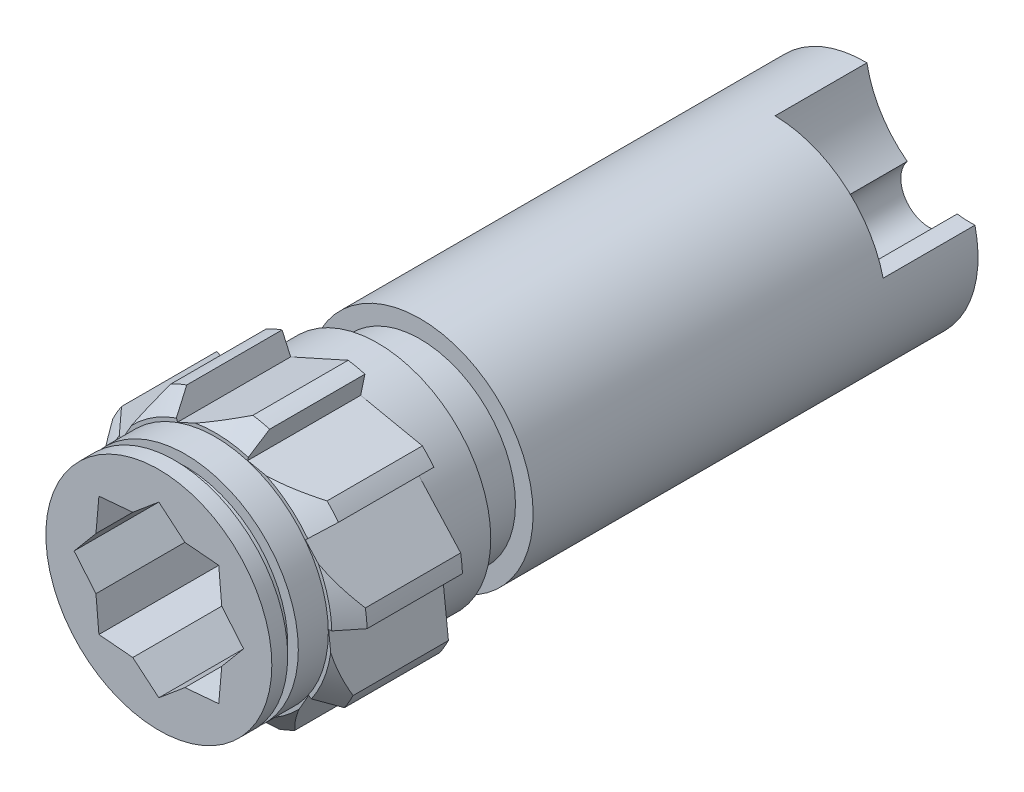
ISO-10303-21;
HEADER;
FILE_DESCRIPTION(('STEP AP214'),'2;1');
FILE_NAME('part.step','',(''),(''),'','','');
FILE_SCHEMA(('AUTOMOTIVE_DESIGN { 1 0 10303 214 1 1 1 1 }'));
ENDSEC;
DATA;
#1=APPLICATION_CONTEXT('core data for automotive mechanical design processes');
#2=APPLICATION_PROTOCOL_DEFINITION('international standard','automotive_design',2000,#1);
#3=PRODUCT_CONTEXT('',#1,'mechanical');
#4=PRODUCT('Part','Part','',(#3));
#5=PRODUCT_RELATED_PRODUCT_CATEGORY('part','',(#4));
#6=PRODUCT_DEFINITION_FORMATION('','',#4);
#7=PRODUCT_DEFINITION_CONTEXT('part definition',#1,'design');
#8=PRODUCT_DEFINITION('design','',#6,#7);
#9=PRODUCT_DEFINITION_SHAPE('','',#8);
#10=(LENGTH_UNIT() NAMED_UNIT(*) SI_UNIT(.MILLI.,.METRE.));
#11=(NAMED_UNIT(*) PLANE_ANGLE_UNIT() SI_UNIT($,.RADIAN.));
#12=(NAMED_UNIT(*) SI_UNIT($,.STERADIAN.) SOLID_ANGLE_UNIT());
#13=UNCERTAINTY_MEASURE_WITH_UNIT(LENGTH_MEASURE(1.E-05),#10,'distance_accuracy_value','');
#14=(GEOMETRIC_REPRESENTATION_CONTEXT(3) GLOBAL_UNCERTAINTY_ASSIGNED_CONTEXT((#13)) GLOBAL_UNIT_ASSIGNED_CONTEXT((#10,
#11,#12)) REPRESENTATION_CONTEXT('',''));
#15=CARTESIAN_POINT('',(0.,0.,0.));
#16=DIRECTION('',(0.,0.,1.));
#17=DIRECTION('',(1.,0.,0.));
#18=AXIS2_PLACEMENT_3D('',#15,#16,#17);
#19=CARTESIAN_POINT('',(0.,0.,76.));
#20=DIRECTION('',(0.,0.,1.));
#21=DIRECTION('',(1.,0.,0.));
#22=AXIS2_PLACEMENT_3D('',#19,#20,#21);
#23=CYLINDRICAL_SURFACE('',#22,19.);
#24=DIRECTION('',(0.,0.,1.));
#25=VECTOR('',#24,1.);
#26=CARTESIAN_POINT('',(-6.54656075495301,17.8365507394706,76.));
#27=LINE('',#26,#25);
#28=CARTESIAN_POINT('',(-6.54656075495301,17.8365507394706,89.5));
#29=VERTEX_POINT('',#28);
#30=CARTESIAN_POINT('',(-6.54656075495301,17.8365507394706,76.));
#31=VERTEX_POINT('',#30);
#32=EDGE_CURVE('E467',#29,#31,#27,.F.);
#33=ORIENTED_EDGE('',*,*,#32,.T.);
#34=CARTESIAN_POINT('',(0.,0.,76.));
#35=DIRECTION('',(0.,0.,1.));
#36=DIRECTION('',(1.,0.,0.));
#37=AXIS2_PLACEMENT_3D('',#34,#35,#36);
#38=CIRCLE('',#37,19.);
#39=CARTESIAN_POINT('',(-8.77210060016,16.8537904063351,76.));
#40=VERTEX_POINT('',#39);
#41=EDGE_CURVE('E707',#31,#40,#38,.T.);
#42=ORIENTED_EDGE('',*,*,#41,.T.);
#43=DIRECTION('',(0.,0.,1.));
#44=VECTOR('',#43,1.);
#45=CARTESIAN_POINT('',(-8.77210060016,16.8537904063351,76.));
#46=LINE('',#45,#44);
#47=CARTESIAN_POINT('',(-8.77210060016,16.8537904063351,89.5));
#48=VERTEX_POINT('',#47);
#49=EDGE_CURVE('E489',#40,#48,#46,.T.);
#50=ORIENTED_EDGE('',*,*,#49,.T.);
#51=CARTESIAN_POINT('',(0.,0.,89.5));
#52=DIRECTION('',(0.,0.,1.));
#53=DIRECTION('',(1.,0.,0.));
#54=AXIS2_PLACEMENT_3D('',#51,#52,#53);
#55=CIRCLE('',#54,19.);
#56=EDGE_CURVE('E484',#48,#29,#55,.F.);
#57=ORIENTED_EDGE('',*,*,#56,.T.);
#58=EDGE_LOOP('',(#33,#42,#50,#57));
#59=FACE_BOUND('',#58,.T.);
#60=ADVANCED_FACE('F40',(#59),#23,.T.);
#61=CARTESIAN_POINT('',(0.,0.,92.));
#62=DIRECTION('',(0.,0.,-1.));
#63=DIRECTION('',(-1.,0.,0.));
#64=AXIS2_PLACEMENT_3D('',#61,#62,#63);
#65=CONICAL_SURFACE('',#64,16.5,0.785398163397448);
#66=CARTESIAN_POINT('',(-5.51931976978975,15.5492928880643,92.0002));
#67=CARTESIAN_POINT('',(-5.69057469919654,15.9306096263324,91.5835508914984));
#68=CARTESIAN_POINT('',(-5.8618124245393,16.31188805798,91.1668596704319));
#69=CARTESIAN_POINT('',(-6.20425346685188,17.074368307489,90.3333930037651));
#70=CARTESIAN_POINT('',(-6.37545678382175,17.4555701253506,89.916617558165));
#71=CARTESIAN_POINT('',(-6.54664289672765,17.8367336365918,89.4998));
#72=B_SPLINE_CURVE_WITH_KNOTS('',3,(#66,#67,#68,#69,#70,#71),.UNSPECIFIED.,.F.,.F.,(4,2,4),(0.,
1.77057746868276,3.54115493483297),.UNSPECIFIED.);
#73=CARTESIAN_POINT('',(-5.51940197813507,15.549475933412,92.));
#74=VERTEX_POINT('',#73);
#75=EDGE_CURVE('E471',#74,#29,#72,.T.);
#76=ORIENTED_EDGE('',*,*,#75,.T.);
#77=ORIENTED_EDGE('',*,*,#56,.F.);
#78=CARTESIAN_POINT('',(-3.56648850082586,25.9379869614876,82.3179640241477));
#79=CARTESIAN_POINT('',(-3.79241802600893,25.5437224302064,82.6777182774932));
#80=CARTESIAN_POINT('',(-4.01939520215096,25.1476296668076,83.0348430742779));
#81=CARTESIAN_POINT('',(-4.47584235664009,24.3510940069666,83.7427246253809));
#82=CARTESIAN_POINT('',(-4.70531269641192,23.9506504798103,84.0934804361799));
#83=CARTESIAN_POINT('',(-5.16810189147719,23.1430474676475,84.7889479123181));
#84=CARTESIAN_POINT('',(-5.40143330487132,22.7358660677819,85.133625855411));
#85=CARTESIAN_POINT('',(-5.87138958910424,21.9157559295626,85.8137533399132));
#86=CARTESIAN_POINT('',(-6.10801431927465,21.5028274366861,86.1492032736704));
#87=CARTESIAN_POINT('',(-6.59601010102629,20.6512369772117,86.8240193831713));
#88=CARTESIAN_POINT('',(-6.84756052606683,20.2122619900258,87.1628626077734));
#89=CARTESIAN_POINT('',(-7.35558300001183,19.3257234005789,87.8254536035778));
#90=CARTESIAN_POINT('',(-7.61205547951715,18.8781590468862,88.1492000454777));
#91=CARTESIAN_POINT('',(-8.13024588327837,17.973876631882,88.7772103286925));
#92=CARTESIAN_POINT('',(-8.39195389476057,17.5171758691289,89.0815071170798));
#93=CARTESIAN_POINT('',(-8.92187184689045,16.592427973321,89.6662558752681));
#94=CARTESIAN_POINT('',(-9.19008028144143,16.1243834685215,89.9467133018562));
#95=CARTESIAN_POINT('',(-9.58608692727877,15.4333211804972,90.3331915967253));
#96=CARTESIAN_POINT('',(-9.71100419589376,15.2153308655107,90.4512020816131));
#97=CARTESIAN_POINT('',(-9.96241545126,14.7765987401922,90.6801586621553));
#98=CARTESIAN_POINT('',(-10.0889092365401,14.555857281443,90.7911056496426));
#99=CARTESIAN_POINT('',(-10.3435400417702,14.1115067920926,91.0051623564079));
#100=CARTESIAN_POINT('',(-10.47167714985,13.8878976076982,91.1082716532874));
#101=CARTESIAN_POINT('',(-10.7296450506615,13.4377236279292,91.3058115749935));
#102=CARTESIAN_POINT('',(-10.8594764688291,13.2111577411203,91.4002388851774));
#103=CARTESIAN_POINT('',(-11.2485637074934,12.532170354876,91.667090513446));
#104=CARTESIAN_POINT('',(-11.5102575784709,12.0754942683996,91.8255142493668));
#105=CARTESIAN_POINT('',(-12.0393237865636,11.1522327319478,92.0971508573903));
#106=CARTESIAN_POINT('',(-12.3066932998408,10.6856522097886,92.2103856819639));
#107=CARTESIAN_POINT('',(-12.8071116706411,9.81238336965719,92.3725392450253));
#108=CARTESIAN_POINT('',(-13.0396001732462,9.40667291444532,92.4283402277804));
#109=CARTESIAN_POINT('',(-13.3894303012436,8.79619222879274,92.4814180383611));
#110=CARTESIAN_POINT('',(-13.5062320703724,8.59236408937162,92.4940064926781));
#111=CARTESIAN_POINT('',(-13.7400010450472,8.18441911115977,92.5088424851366));
#112=CARTESIAN_POINT('',(-13.8569682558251,7.98030226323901,92.5110896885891));
#113=CARTESIAN_POINT('',(-14.2087041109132,7.36649593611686,92.502187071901));
#114=CARTESIAN_POINT('',(-14.4434180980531,6.95690183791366,92.4752569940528));
#115=CARTESIAN_POINT('',(-14.910754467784,6.14136365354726,92.3808165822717));
#116=CARTESIAN_POINT('',(-15.1433769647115,5.73541936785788,92.313308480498));
#117=CARTESIAN_POINT('',(-15.5416803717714,5.0403490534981,92.1647855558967));
#118=CARTESIAN_POINT('',(-15.7081940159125,4.74976983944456,92.0925771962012));
#119=CARTESIAN_POINT('',(-16.0390407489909,4.17241664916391,91.9302742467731));
#120=CARTESIAN_POINT('',(-16.2033739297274,3.88564251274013,91.8401804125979));
#121=CARTESIAN_POINT('',(-16.5288011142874,3.3177468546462,91.6443888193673));
#122=CARTESIAN_POINT('',(-16.6899072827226,3.03660410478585,91.5387721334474));
#123=CARTESIAN_POINT('',(-17.0096493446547,2.47862942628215,91.3133448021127));
#124=CARTESIAN_POINT('',(-17.1682852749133,2.20179743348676,91.193534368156));
#125=CARTESIAN_POINT('',(-17.325649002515,1.92718553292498,91.0674970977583));
#126=B_SPLINE_CURVE_WITH_KNOTS('',3,(#78,#79,#80,#81,#82,#83,#84,#85,#86,#87,#88,#89,#90,#91,
#92,#93,#94,#95,#96,#97,#98,#99,#100,#101,#102,#103,#104,#105,#106,#107,#108,#109,#110,#111,
#112,#113,#114,#115,#116,#117,#118,#119,#120,#121,#122,#123,#124,#125),.UNSPECIFIED.,.F.,.F.,(4,
2,2,2,2,2,2,2,2,2,2,2,2,2,2,2,2,2,2,2,2,2,2,4),(0.,1.7387567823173,3.47776908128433,
5.22449719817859,6.97115093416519,8.79771417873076,10.6244379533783,12.4479804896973,
14.2711044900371,15.1037563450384,15.936302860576,16.7688942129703,17.6018021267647,
19.2490085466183,20.8954137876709,22.3063530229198,23.011928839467,23.7175274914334,
25.1340844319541,26.5505634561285,27.5778797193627,28.6051525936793,29.6272392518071,
30.6493106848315),.UNSPECIFIED.);
#127=CARTESIAN_POINT('',(-11.851405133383,11.4801653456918,92.));
#128=VERTEX_POINT('',#127);
#129=EDGE_CURVE('E1212',#48,#128,#126,.T.);
#130=ORIENTED_EDGE('',*,*,#129,.T.);
#131=CARTESIAN_POINT('',(0.,0.,92.));
#132=DIRECTION('',(0.,0.,1.));
#133=DIRECTION('',(1.,0.,0.));
#134=AXIS2_PLACEMENT_3D('',#131,#132,#133);
#135=CIRCLE('',#134,16.5);
#136=EDGE_CURVE('E64',#74,#128,#135,.T.);
#137=ORIENTED_EDGE('',*,*,#136,.F.);
#138=EDGE_LOOP('',(#76,#77,#130,#137));
#139=FACE_BOUND('',#138,.T.);
#140=ADVANCED_FACE('F482',(#139),#65,.T.);
#141=DIRECTION('',(0.,0.,1.));
#142=VECTOR('',#141,1.);
#143=CARTESIAN_POINT('',(-15.7803403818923,10.5821008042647,76.));
#144=LINE('',#143,#142);
#145=CARTESIAN_POINT('',(-15.7803403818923,10.5821008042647,89.5));
#146=VERTEX_POINT('',#145);
#147=CARTESIAN_POINT('',(-15.7803403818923,10.5821008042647,76.));
#148=VERTEX_POINT('',#147);
#149=EDGE_CURVE('E1253',#146,#148,#144,.F.);
#150=ORIENTED_EDGE('',*,*,#149,.T.);
#151=CARTESIAN_POINT('',(-17.0031879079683,8.47889149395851,76.));
#152=VERTEX_POINT('',#151);
#153=EDGE_CURVE('E929',#148,#152,#38,.T.);
#154=ORIENTED_EDGE('',*,*,#153,.T.);
#155=DIRECTION('',(0.,0.,1.));
#156=VECTOR('',#155,1.);
#157=CARTESIAN_POINT('',(-17.0031879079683,8.4788914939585,76.));
#158=LINE('',#157,#156);
#159=CARTESIAN_POINT('',(-17.0031879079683,8.47889149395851,89.5));
#160=VERTEX_POINT('',#159);
#161=EDGE_CURVE('E1264',#152,#160,#158,.T.);
#162=ORIENTED_EDGE('',*,*,#161,.T.);
#163=EDGE_CURVE('E490',#160,#146,#55,.F.);
#164=ORIENTED_EDGE('',*,*,#163,.T.);
#165=EDGE_LOOP('',(#150,#154,#162,#164));
#166=FACE_BOUND('',#165,.T.);
#167=ADVANCED_FACE('F822',(#166),#23,.T.);
#168=CARTESIAN_POINT('',(-13.60486853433,9.33546743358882,92.0002));
#169=CARTESIAN_POINT('',(-13.9675490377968,9.54329803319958,91.5835508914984));
#170=CARTESIAN_POINT('',(-14.3301931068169,9.75110775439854,91.1668596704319));
#171=CARTESIAN_POINT('',(-15.0554083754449,10.1666854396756,90.3333930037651));
#172=CARTESIAN_POINT('',(-15.417979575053,10.3744534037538,89.916617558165));
#173=CARTESIAN_POINT('',(-15.7805143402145,10.5822004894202,89.4998));
#174=B_SPLINE_CURVE_WITH_KNOTS('',3,(#168,#169,#170,#171,#172,#173),.UNSPECIFIED.,.F.,.F.,(4,2,
4),(0.,1.77057746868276,3.54115493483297),.UNSPECIFIED.);
#175=CARTESIAN_POINT('',(-13.6050426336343,9.33556719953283,92.));
#176=VERTEX_POINT('',#175);
#177=EDGE_CURVE('E1203',#176,#146,#174,.T.);
#178=ORIENTED_EDGE('',*,*,#177,.T.);
#179=ORIENTED_EDGE('',*,*,#163,.F.);
#180=CARTESIAN_POINT('',(-18.2017957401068,19.5382476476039,81.7970322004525));
#181=CARTESIAN_POINT('',(-18.1536038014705,19.0935886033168,82.1551828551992));
#182=CARTESIAN_POINT('',(-18.1052038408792,18.6470101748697,82.5109480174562));
#183=CARTESIAN_POINT('',(-18.0079119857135,17.7493143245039,83.216743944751));
#184=CARTESIAN_POINT('',(-17.9590200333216,17.2981963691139,83.5667740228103));
#185=CARTESIAN_POINT('',(-17.8605146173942,16.389303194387,84.2612147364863));
#186=CARTESIAN_POINT('',(-17.8108992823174,15.9315107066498,84.6056025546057));
#187=CARTESIAN_POINT('',(-17.7110231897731,15.0099705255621,85.2862003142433));
#188=CARTESIAN_POINT('',(-17.6607624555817,14.5462230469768,85.6224105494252));
#189=CARTESIAN_POINT('',(-17.5575064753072,13.5934972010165,86.297991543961));
#190=CARTESIAN_POINT('',(-17.5044812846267,13.1042425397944,86.6369692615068));
#191=CARTESIAN_POINT('',(-17.3974844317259,12.1170002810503,87.3019311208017));
#192=CARTESIAN_POINT('',(-17.3435127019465,11.6190120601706,87.6279143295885));
#193=CARTESIAN_POINT('',(-17.2345425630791,10.6135626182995,88.2633362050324));
#194=CARTESIAN_POINT('',(-17.1795455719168,10.1061144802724,88.5727957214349));
#195=CARTESIAN_POINT('',(-17.0682965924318,9.07963855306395,89.1715319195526));
#196=CARTESIAN_POINT('',(-17.0120448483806,8.56061301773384,89.4608124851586));
#197=CARTESIAN_POINT('',(-16.9008252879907,7.53440853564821,90.000780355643));
#198=CARTESIAN_POINT('',(-16.8459246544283,7.02784947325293,90.2526515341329));
#199=CARTESIAN_POINT('',(-16.734675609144,6.00137293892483,90.727668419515));
#200=CARTESIAN_POINT('',(-16.6783269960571,5.48145360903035,90.9508101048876));
#201=CARTESIAN_POINT('',(-16.5646473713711,4.43255052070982,91.3593815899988));
#202=CARTESIAN_POINT('',(-16.5073302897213,3.90369529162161,91.5451414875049));
#203=CARTESIAN_POINT('',(-16.3912746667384,2.8328692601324,91.8736210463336));
#204=CARTESIAN_POINT('',(-16.3325365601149,2.29090246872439,92.0163536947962));
#205=CARTESIAN_POINT('',(-16.2237557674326,1.28720009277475,92.2314405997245));
#206=CARTESIAN_POINT('',(-16.1738921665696,0.827116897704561,92.3115528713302));
#207=CARTESIAN_POINT('',(-16.073611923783,-0.0981523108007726,92.4327048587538));
#208=CARTESIAN_POINT('',(-16.0231953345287,-0.563337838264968,92.4737482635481));
#209=CARTESIAN_POINT('',(-15.9220316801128,-1.49675813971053,92.5146675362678));
#210=CARTESIAN_POINT('',(-15.8712840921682,-1.96499773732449,92.5144333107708));
#211=CARTESIAN_POINT('',(-15.7699935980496,-2.89958836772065,92.4725279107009));
#212=CARTESIAN_POINT('',(-15.7194506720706,-3.36593958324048,92.4308608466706));
#213=CARTESIAN_POINT('',(-15.6296148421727,-4.19483992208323,92.3213517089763));
#214=CARTESIAN_POINT('',(-15.5902132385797,-4.55839199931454,92.2609516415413));
#215=CARTESIAN_POINT('',(-15.5118863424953,-5.28110131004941,92.1176408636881));
#216=CARTESIAN_POINT('',(-15.472961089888,-5.64025817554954,92.0347282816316));
#217=CARTESIAN_POINT('',(-15.3957519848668,-6.35265381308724,91.8486990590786));
#218=CARTESIAN_POINT('',(-15.3574671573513,-6.70590158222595,91.7456168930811));
#219=CARTESIAN_POINT('',(-15.28153841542,-7.40648352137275,91.5214900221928));
#220=CARTESIAN_POINT('',(-15.2438940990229,-7.75382140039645,91.4004570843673));
#221=CARTESIAN_POINT('',(-15.2065784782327,-8.09812645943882,91.2715444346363));
#222=B_SPLINE_CURVE_WITH_KNOTS('',3,(#180,#181,#182,#183,#184,#185,#186,#187,#188,#189,#190,
#191,#192,#193,#194,#195,#196,#197,#198,#199,#200,#201,#202,#203,#204,#205,#206,#207,#208,#209,
#210,#211,#212,#213,#214,#215,#216,#217,#218,#219,#220,#221),.UNSPECIFIED.,.F.,.F.,(4,2,2,2,2,2,
2,2,2,2,2,2,2,2,2,2,2,2,2,2,4),(0.,1.71898150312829,3.43816743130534,5.16312647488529,
6.88802348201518,8.68055877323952,10.4732225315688,12.2635680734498,14.0535680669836,
15.7579936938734,17.4626576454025,19.1515354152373,20.8399029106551,22.2473873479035,
23.6547388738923,25.065844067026,26.4768092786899,27.5879994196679,28.6992819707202,
29.8086814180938,30.9173568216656),.UNSPECIFIED.);
#223=CARTESIAN_POINT('',(-16.3358600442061,2.32156770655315,92.));
#224=VERTEX_POINT('',#223);
#225=EDGE_CURVE('E1185',#160,#224,#222,.T.);
#226=ORIENTED_EDGE('',*,*,#225,.T.);
#227=EDGE_CURVE('E503',#176,#224,#135,.T.);
#228=ORIENTED_EDGE('',*,*,#227,.F.);
#229=EDGE_LOOP('',(#178,#179,#226,#228));
#230=FACE_BOUND('',#229,.T.);
#231=ADVANCED_FACE('F827',(#230),#65,.T.);
#232=DIRECTION('',(0.,0.,1.));
#233=VECTOR('',#232,1.);
#234=CARTESIAN_POINT('',(-18.9865663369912,-0.714351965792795,76.));
#235=LINE('',#234,#233);
#236=CARTESIAN_POINT('',(-18.9865663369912,-0.714351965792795,89.5));
#237=VERTEX_POINT('',#236);
#238=CARTESIAN_POINT('',(-18.9865663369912,-0.714351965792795,76.));
#239=VERTEX_POINT('',#238);
#240=EDGE_CURVE('E912',#237,#239,#235,.F.);
#241=ORIENTED_EDGE('',*,*,#240,.T.);
#242=CARTESIAN_POINT('',(-18.7396353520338,-3.13465578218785,76.));
#243=VERTEX_POINT('',#242);
#244=EDGE_CURVE('E915',#239,#243,#38,.T.);
#245=ORIENTED_EDGE('',*,*,#244,.T.);
#246=DIRECTION('',(0.,0.,1.));
#247=VECTOR('',#246,1.);
#248=CARTESIAN_POINT('',(-18.7396353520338,-3.13465578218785,76.));
#249=LINE('',#248,#247);
#250=CARTESIAN_POINT('',(-18.7396353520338,-3.13465578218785,89.5));
#251=VERTEX_POINT('',#250);
#252=EDGE_CURVE('E1357',#243,#251,#249,.T.);
#253=ORIENTED_EDGE('',*,*,#252,.T.);
#254=EDGE_CURVE('E492',#251,#237,#55,.F.);
#255=ORIENTED_EDGE('',*,*,#254,.T.);
#256=EDGE_LOOP('',(#241,#245,#253,#255));
#257=FACE_BOUND('',#256,.T.);
#258=ADVANCED_FACE('F832',(#257),#23,.T.);
#259=CARTESIAN_POINT('',(-16.4938199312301,-0.444189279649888,92.0002));
#260=CARTESIAN_POINT('',(-16.9093943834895,-0.489229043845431,91.5835508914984));
#261=CARTESIAN_POINT('',(-17.3249270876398,-0.534264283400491,91.1668596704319));
#262=CARTESIAN_POINT('',(-18.1559089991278,-0.624325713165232,90.3333930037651));
#263=CARTESIAN_POINT('',(-18.5713582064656,-0.669351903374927,89.916617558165));
#264=CARTESIAN_POINT('',(-18.9867656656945,-0.71437356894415,89.4998));
#265=B_SPLINE_CURVE_WITH_KNOTS('',3,(#259,#260,#261,#262,#263,#264),.UNSPECIFIED.,.F.,.F.,(4,2,
4),(0.,1.77057746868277,3.54115493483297),.UNSPECIFIED.);
#266=CARTESIAN_POINT('',(-16.4940194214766,-0.444210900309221,92.));
#267=VERTEX_POINT('',#266);
#268=EDGE_CURVE('E1178',#267,#237,#265,.T.);
#269=ORIENTED_EDGE('',*,*,#268,.T.);
#270=ORIENTED_EDGE('',*,*,#254,.F.);
#271=CARTESIAN_POINT('',(-25.5347234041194,4.36308231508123,82.5952014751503));
#272=CARTESIAN_POINT('',(-25.2280165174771,4.02466022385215,82.9544626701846));
#273=CARTESIAN_POINT('',(-24.9198363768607,3.68461253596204,83.310970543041));
#274=CARTESIAN_POINT('',(-24.2999601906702,3.00063769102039,84.0172976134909));
#275=CARTESIAN_POINT('',(-23.9882635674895,2.65670989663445,84.3671156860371));
#276=CARTESIAN_POINT('',(-23.3592977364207,1.96270548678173,85.0605125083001));
#277=CARTESIAN_POINT('',(-23.0420082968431,1.61260654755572,85.4040506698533));
#278=CARTESIAN_POINT('',(-22.4027748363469,0.907272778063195,86.0813571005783));
#279=CARTESIAN_POINT('',(-22.0808310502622,0.552038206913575,86.4151258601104));
#280=CARTESIAN_POINT('',(-21.4148281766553,-0.182833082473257,87.0876518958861));
#281=CARTESIAN_POINT('',(-21.0704830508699,-0.562785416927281,87.425783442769));
#282=CARTESIAN_POINT('',(-20.374742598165,-1.33046931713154,88.0857706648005));
#283=CARTESIAN_POINT('',(-20.0233464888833,-1.71820174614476,88.4076245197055));
#284=CARTESIAN_POINT('',(-19.3131001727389,-2.50189149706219,89.0302063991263));
#285=CARTESIAN_POINT('',(-18.9542660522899,-2.89783106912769,89.3309748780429));
#286=CARTESIAN_POINT('',(-18.227384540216,-3.69987618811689,89.9065453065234));
#287=CARTESIAN_POINT('',(-17.8593400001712,-4.10597858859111,90.1813551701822));
#288=CARTESIAN_POINT('',(-17.1471614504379,-4.89180037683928,90.6743078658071));
#289=CARTESIAN_POINT('',(-16.8039359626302,-5.27051729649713,90.8953371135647));
#290=CARTESIAN_POINT('',(-16.1084380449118,-6.03793358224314,91.3037229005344));
#291=CARTESIAN_POINT('',(-15.7561647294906,-6.4266339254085,91.4910761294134));
#292=CARTESIAN_POINT('',(-15.0472761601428,-7.20882553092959,91.8224626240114));
#293=CARTESIAN_POINT('',(-14.6907729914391,-7.60219311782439,91.9670161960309));
#294=CARTESIAN_POINT('',(-14.1506740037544,-8.19814135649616,92.1481587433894));
#295=CARTESIAN_POINT('',(-13.9697340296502,-8.39779153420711,92.2025948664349));
#296=CARTESIAN_POINT('',(-13.6063473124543,-8.79875446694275,92.2987673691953));
#297=CARTESIAN_POINT('',(-13.423900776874,-9.00006699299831,92.3405054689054));
#298=CARTESIAN_POINT('',(-13.0545513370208,-9.407609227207,92.4112240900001));
#299=CARTESIAN_POINT('',(-12.867627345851,-9.61386220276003,92.4399613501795));
#300=CARTESIAN_POINT('',(-12.4930282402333,-10.0271969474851,92.4830366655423));
#301=CARTESIAN_POINT('',(-12.3053531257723,-10.2342787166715,92.4973747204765));
#302=CARTESIAN_POINT('',(-11.9297524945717,-10.6487185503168,92.511377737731));
#303=CARTESIAN_POINT('',(-11.7418269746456,-10.8560766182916,92.5110425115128));
#304=CARTESIAN_POINT('',(-11.3662481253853,-11.2704924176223,92.495705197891));
#305=CARTESIAN_POINT('',(-11.1785947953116,-11.4775501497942,92.4807031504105));
#306=CARTESIAN_POINT('',(-10.8029390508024,-11.8920507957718,92.4361848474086));
#307=CARTESIAN_POINT('',(-10.6149412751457,-12.0994885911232,92.4065822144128));
#308=CARTESIAN_POINT('',(-10.2401815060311,-12.5130006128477,92.333368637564));
#309=CARTESIAN_POINT('',(-10.0534195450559,-12.7190748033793,92.289757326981));
#310=CARTESIAN_POINT('',(-9.68153693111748,-13.1294121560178,92.1892835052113));
#311=CARTESIAN_POINT('',(-9.49641611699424,-13.3336754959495,92.1324223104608));
#312=CARTESIAN_POINT('',(-9.12808015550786,-13.7400994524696,92.0063368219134));
#313=CARTESIAN_POINT('',(-8.94486512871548,-13.9422599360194,91.9371117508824));
#314=CARTESIAN_POINT('',(-8.56717189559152,-14.359008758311,91.7817692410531));
#315=CARTESIAN_POINT('',(-8.37285501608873,-14.5734190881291,91.6947844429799));
#316=CARTESIAN_POINT('',(-7.98687673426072,-14.9993096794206,91.5089567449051));
#317=CARTESIAN_POINT('',(-7.7952144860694,-15.2107908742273,91.4101177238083));
#318=CARTESIAN_POINT('',(-7.41611479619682,-15.6290915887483,91.2026334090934));
#319=CARTESIAN_POINT('',(-7.22865550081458,-15.8359352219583,91.0940762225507));
#320=CARTESIAN_POINT('',(-6.85630582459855,-16.2467879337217,90.8675553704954));
#321=CARTESIAN_POINT('',(-6.6714155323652,-16.450796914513,90.7495913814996));
#322=CARTESIAN_POINT('',(-6.48779922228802,-16.6534001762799,90.6274714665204));
#323=B_SPLINE_CURVE_WITH_KNOTS('',3,(#271,#272,#273,#274,#275,#276,#277,#278,#279,#280,#281,
#282,#283,#284,#285,#286,#287,#288,#289,#290,#291,#292,#293,#294,#295,#296,#297,#298,#299,#300,
#301,#302,#303,#304,#305,#306,#307,#308,#309,#310,#311,#312,#313,#314,#315,#316,#317,#318,#319,
#320,#321,#322),.UNSPECIFIED.,.F.,.F.,(4,2,2,2,2,2,2,2,2,2,2,2,2,2,2,2,2,2,2,2,2,2,2,2,2,4),(0.,
1.74329642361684,3.48688349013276,5.23930390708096,6.99163621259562,8.83405843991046,
10.6766862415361,12.5156761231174,14.3541035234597,16.0236829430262,17.6934263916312,
19.341948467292,20.1663556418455,20.9906510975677,21.8297897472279,22.6689284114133,
23.5080778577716,24.347225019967,25.1913972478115,26.0355915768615,26.8797020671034,
27.723865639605,28.630042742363,29.5359241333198,30.4342941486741,31.33269507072),.UNSPECIFIED.);
#324=CARTESIAN_POINT('',(-14.5805716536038,-7.72378988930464,92.));
#325=VERTEX_POINT('',#324);
#326=EDGE_CURVE('E1160',#251,#325,#323,.T.);
#327=ORIENTED_EDGE('',*,*,#326,.T.);
#328=EDGE_CURVE('E1279',#267,#325,#135,.T.);
#329=ORIENTED_EDGE('',*,*,#328,.F.);
#330=EDGE_LOOP('',(#269,#270,#327,#329));
#331=FACE_BOUND('',#330,.T.);
#332=ADVANCED_FACE('F895',(#331),#65,.T.);
#333=DIRECTION('',(0.,0.,1.));
#334=VECTOR('',#333,1.);
#335=CARTESIAN_POINT('',(-14.940569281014,-11.7379465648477,76.));
#336=LINE('',#335,#334);
#337=CARTESIAN_POINT('',(-14.940569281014,-11.7379465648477,89.5));
#338=VERTEX_POINT('',#337);
#339=CARTESIAN_POINT('',(-14.940569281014,-11.7379465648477,76.));
#340=VERTEX_POINT('',#339);
#341=EDGE_CURVE('E1345',#338,#340,#336,.F.);
#342=ORIENTED_EDGE('',*,*,#341,.T.);
#343=CARTESIAN_POINT('',(-13.3181790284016,-13.5508710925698,76.));
#344=VERTEX_POINT('',#343);
#345=EDGE_CURVE('E930',#340,#344,#38,.T.);
#346=ORIENTED_EDGE('',*,*,#345,.T.);
#347=DIRECTION('',(0.,0.,1.));
#348=VECTOR('',#347,1.);
#349=CARTESIAN_POINT('',(-13.3181790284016,-13.5508710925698,76.));
#350=LINE('',#349,#348);
#351=CARTESIAN_POINT('',(-13.3181790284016,-13.5508710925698,89.5));
#352=VERTEX_POINT('',#351);
#353=EDGE_CURVE('E1346',#344,#352,#350,.T.);
#354=ORIENTED_EDGE('',*,*,#353,.T.);
#355=EDGE_CURVE('E1341',#352,#338,#55,.F.);
#356=ORIENTED_EDGE('',*,*,#355,.T.);
#357=EDGE_LOOP('',(#342,#346,#354,#356));
#358=FACE_BOUND('',#357,.T.);
#359=ADVANCED_FACE('F890',(#358),#23,.T.);
#360=CARTESIAN_POINT('',(-13.0826927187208,-10.0541807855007,92.0002));
#361=CARTESIAN_POINT('',(-13.3924258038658,-10.3348872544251,91.5835508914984));
#362=CARTESIAN_POINT('',(-13.702127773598,-10.6155655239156,91.1668596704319));
#363=CARTESIAN_POINT('',(-14.3214694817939,-11.1768656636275,90.3333930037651));
#364=CARTESIAN_POINT('',(-14.6311092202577,-11.4574875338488,89.916617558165));
#365=CARTESIAN_POINT('',(-14.9407178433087,-11.7380812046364,89.4998));
#366=B_SPLINE_CURVE_WITH_KNOTS('',3,(#360,#361,#362,#363,#364,#365),.UNSPECIFIED.,.F.,.F.,(4,2,
4),(0.,1.77057746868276,3.54115493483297),.UNSPECIFIED.);
#367=CARTESIAN_POINT('',(-13.0828414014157,-10.0543155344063,92.));
#368=VERTEX_POINT('',#367);
#369=EDGE_CURVE('E1151',#368,#338,#366,.T.);
#370=ORIENTED_EDGE('',*,*,#369,.T.);
#371=ORIENTED_EDGE('',*,*,#355,.F.);
#372=CARTESIAN_POINT('',(-24.2066419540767,-11.273285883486,81.7970322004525));
#373=CARTESIAN_POINT('',(-23.7689000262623,-11.3648501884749,82.1551451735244));
#374=CARTESIAN_POINT('',(-23.329268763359,-11.4568096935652,82.5108731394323));
#375=CARTESIAN_POINT('',(-22.445538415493,-11.6416632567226,83.2165959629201));
#376=CARTESIAN_POINT('',(-22.0014388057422,-11.7345574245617,83.5665901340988));
#377=CARTESIAN_POINT('',(-21.1066868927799,-11.9217164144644,84.2609603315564));
#378=CARTESIAN_POINT('',(-20.656017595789,-12.0159847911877,84.6053135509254));
#379=CARTESIAN_POINT('',(-19.748817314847,-12.2057476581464,85.2858443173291));
#380=CARTESIAN_POINT('',(-19.2922865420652,-12.3012421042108,85.6220221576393));
#381=CARTESIAN_POINT('',(-18.3542887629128,-12.4974470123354,86.2976114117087));
#382=CARTESIAN_POINT('',(-17.8725482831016,-12.5982146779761,86.6366276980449));
#383=CARTESIAN_POINT('',(-16.9004680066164,-12.8015487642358,87.3016648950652));
#384=CARTESIAN_POINT('',(-16.4101275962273,-12.9041153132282,87.6276848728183));
#385=CARTESIAN_POINT('',(-15.4201182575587,-13.1111996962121,88.2631778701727));
#386=CARTESIAN_POINT('',(-14.9204622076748,-13.2157148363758,88.5726717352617));
#387=CARTESIAN_POINT('',(-13.9097472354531,-13.4271303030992,89.1714729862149));
#388=CARTESIAN_POINT('',(-13.3986905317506,-13.5340301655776,89.4607842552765));
#389=CARTESIAN_POINT('',(-12.3877732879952,-13.7454879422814,90.0010568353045));
#390=CARTESIAN_POINT('',(-11.8885119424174,-13.849920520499,90.2531804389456));
#391=CARTESIAN_POINT('',(-10.8768083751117,-14.0615427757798,90.7286353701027));
#392=CARTESIAN_POINT('',(-10.3643643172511,-14.1687328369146,90.9519626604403));
#393=CARTESIAN_POINT('',(-9.33057900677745,-14.3849740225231,91.360792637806));
#394=CARTESIAN_POINT('',(-8.80936591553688,-14.4939983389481,91.5466297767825));
#395=CARTESIAN_POINT('',(-7.75400630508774,-14.7147523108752,91.8751568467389));
#396=CARTESIAN_POINT('',(-7.21986376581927,-14.8264811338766,92.0178598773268));
#397=CARTESIAN_POINT('',(-6.23107531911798,-15.033310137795,92.2326852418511));
#398=CARTESIAN_POINT('',(-5.77806420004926,-15.1280683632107,92.3126179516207));
#399=CARTESIAN_POINT('',(-4.86703248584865,-15.3186326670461,92.433394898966));
#400=CARTESIAN_POINT('',(-4.40901237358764,-15.4144386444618,92.4742428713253));
#401=CARTESIAN_POINT('',(-3.48992968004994,-15.6066870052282,92.5147665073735));
#402=CARTESIAN_POINT('',(-3.0288621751,-15.7031304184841,92.5143269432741));
#403=CARTESIAN_POINT('',(-2.10860466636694,-15.8956245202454,92.4720059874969));
#404=CARTESIAN_POINT('',(-1.64941449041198,-15.9916752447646,92.4301284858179));
#405=CARTESIAN_POINT('',(-0.823375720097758,-16.1644612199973,92.3189157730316));
#406=CARTESIAN_POINT('',(-0.455628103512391,-16.2413845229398,92.2563456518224));
#407=CARTESIAN_POINT('',(0.275269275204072,-16.3942693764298,92.1075020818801));
#408=CARTESIAN_POINT('',(0.638418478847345,-16.470230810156,92.0212257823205));
#409=CARTESIAN_POINT('',(1.35854091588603,-16.6208618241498,91.82748075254));
#410=CARTESIAN_POINT('',(1.71552353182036,-16.6955333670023,91.7200480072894));
#411=CARTESIAN_POINT('',(2.42329157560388,-16.8435801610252,91.4864329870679));
#412=CARTESIAN_POINT('',(2.77408136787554,-16.9169563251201,91.3602645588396));
#413=CARTESIAN_POINT('',(3.12171384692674,-16.9896720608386,91.2259137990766));
#414=B_SPLINE_CURVE_WITH_KNOTS('',3,(#372,#373,#374,#375,#376,#377,#378,#379,#380,#381,#382,
#383,#384,#385,#386,#387,#388,#389,#390,#391,#392,#393,#394,#395,#396,#397,#398,#399,#400,#401,
#402,#403,#404,#405,#406,#407,#408,#409,#410,#411,#412,#413),.UNSPECIFIED.,.F.,.F.,(4,2,2,2,2,2,
2,2,2,2,2,2,2,2,2,2,2,2,2,2,4),(0.,1.71880058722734,3.43780545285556,5.16258156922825,
6.88729572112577,8.68001262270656,10.472857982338,12.2633857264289,14.0535680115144,
15.7597825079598,17.4662359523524,19.1567180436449,20.8466862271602,22.2541902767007,
23.6615598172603,25.0728572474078,26.4840222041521,27.62588414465,28.767883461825,
29.9079568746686,31.0471918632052),.UNSPECIFIED.);
#415=CARTESIAN_POINT('',(-7.25600046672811,-14.8189222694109,92.));
#416=VERTEX_POINT('',#415);
#417=EDGE_CURVE('E1132',#352,#416,#414,.T.);
#418=ORIENTED_EDGE('',*,*,#417,.T.);
#419=EDGE_CURVE('E1280',#368,#416,#135,.T.);
#420=ORIENTED_EDGE('',*,*,#419,.F.);
#421=EDGE_LOOP('',(#370,#371,#418,#420));
#422=FACE_BOUND('',#421,.T.);
#423=ADVANCED_FACE('F886',(#422),#65,.T.);
#424=DIRECTION('',(0.,0.,1.));
#425=VECTOR('',#424,1.);
#426=CARTESIAN_POINT('',(-5.18778257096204,-18.2780445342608,76.));
#427=LINE('',#426,#425);
#428=CARTESIAN_POINT('',(-5.18778257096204,-18.2780445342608,89.5));
#429=VERTEX_POINT('',#428);
#430=CARTESIAN_POINT('',(-5.18778257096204,-18.2780445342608,76.));
#431=VERTEX_POINT('',#430);
#432=EDGE_CURVE('E1373',#429,#431,#427,.F.);
#433=ORIENTED_EDGE('',*,*,#432,.T.);
#434=CARTESIAN_POINT('',(-2.80963098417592,-18.7911142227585,76.));
#435=VERTEX_POINT('',#434);
#436=EDGE_CURVE('E931',#431,#435,#38,.T.);
#437=ORIENTED_EDGE('',*,*,#436,.T.);
#438=DIRECTION('',(0.,0.,1.));
#439=VECTOR('',#438,1.);
#440=CARTESIAN_POINT('',(-2.80963098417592,-18.7911142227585,76.));
#441=LINE('',#440,#439);
#442=CARTESIAN_POINT('',(-2.80963098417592,-18.7911142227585,89.5));
#443=VERTEX_POINT('',#442);
#444=EDGE_CURVE('E1334',#435,#443,#441,.T.);
#445=ORIENTED_EDGE('',*,*,#444,.T.);
#446=EDGE_CURVE('E1339',#443,#429,#55,.F.);
#447=ORIENTED_EDGE('',*,*,#446,.T.);
#448=EDGE_LOOP('',(#433,#437,#445,#447));
#449=FACE_BOUND('',#448,.T.);
#450=ADVANCED_FACE('F881',(#449),#23,.T.);
#451=CARTESIAN_POINT('',(-4.67442155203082,-15.8238169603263,92.0002));
#452=CARTESIAN_POINT('',(-4.76000575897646,-16.2329698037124,91.5835508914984));
#453=CARTESIAN_POINT('',(-4.84558136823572,-16.6420815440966,91.1668596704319));
#454=CARTESIAN_POINT('',(-5.01671539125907,-17.4602228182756,90.3333930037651));
#455=CARTESIAN_POINT('',(-5.10227380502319,-17.8692523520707,89.916617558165));
#456=CARTESIAN_POINT('',(-5.18782362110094,-18.2782407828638,89.4998));
#457=B_SPLINE_CURVE_WITH_KNOTS('',3,(#451,#452,#453,#454,#455,#456),.UNSPECIFIED.,.F.,.F.,(4,2,
4),(0.,1.77057746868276,3.54115493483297),.UNSPECIFIED.);
#458=CARTESIAN_POINT('',(-4.67446263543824,-15.8240133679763,92.));
#459=VERTEX_POINT('',#458);
#460=EDGE_CURVE('E1123',#459,#429,#457,.T.);
#461=ORIENTED_EDGE('',*,*,#460,.T.);
#462=ORIENTED_EDGE('',*,*,#446,.F.);
#463=CARTESIAN_POINT('',(-12.6400531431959,-23.2061007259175,82.0747458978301));
#464=CARTESIAN_POINT('',(-12.2283788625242,-23.0212117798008,82.4339733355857));
#465=CARTESIAN_POINT('',(-11.8148577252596,-22.8354933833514,82.7906862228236));
#466=CARTESIAN_POINT('',(-10.9834326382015,-22.462088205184,83.4980434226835));
#467=CARTESIAN_POINT('',(-10.5655281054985,-22.2744011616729,83.8486869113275));
#468=CARTESIAN_POINT('',(-9.72311474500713,-21.8960609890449,84.5441247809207));
#469=CARTESIAN_POINT('',(-9.29858648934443,-21.7053991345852,84.8888909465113));
#470=CARTESIAN_POINT('',(-8.44375884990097,-21.3214835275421,85.5696925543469));
#471=CARTESIAN_POINT('',(-8.01345970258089,-21.1282298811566,85.9057283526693));
#472=CARTESIAN_POINT('',(-7.12748946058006,-20.7303276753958,86.5814986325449));
#473=CARTESIAN_POINT('',(-6.67152341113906,-20.5255466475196,86.9207699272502));
#474=CARTESIAN_POINT('',(-5.75103209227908,-20.1121405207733,87.5852128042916));
#475=CARTESIAN_POINT('',(-5.28650610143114,-19.9035150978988,87.9103831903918));
#476=CARTESIAN_POINT('',(-4.34824426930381,-19.4821279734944,88.5426404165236));
#477=CARTESIAN_POINT('',(-3.87452344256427,-19.269373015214,88.8497538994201));
#478=CARTESIAN_POINT('',(-2.91577035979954,-18.8387829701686,89.4418536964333));
#479=CARTESIAN_POINT('',(-2.43074072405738,-18.6209490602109,89.7268450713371));
#480=CARTESIAN_POINT('',(-1.48184545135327,-18.1947863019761,90.25011280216));
#481=CARTESIAN_POINT('',(-1.0188434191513,-17.9868453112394,90.4902579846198));
#482=CARTESIAN_POINT('',(-0.0806071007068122,-17.5654696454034,90.940430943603));
#483=CARTESIAN_POINT('',(0.394628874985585,-17.3520342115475,91.1504545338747));
#484=CARTESIAN_POINT('',(1.35264154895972,-16.921776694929,91.5312261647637));
#485=CARTESIAN_POINT('',(1.83529060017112,-16.7050119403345,91.7023555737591));
#486=CARTESIAN_POINT('',(2.81188733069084,-16.2664080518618,92.0003352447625));
#487=CARTESIAN_POINT('',(3.30583153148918,-16.0445704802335,92.1271989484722));
#488=CARTESIAN_POINT('',(4.22501230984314,-15.6317529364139,92.3136836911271));
#489=CARTESIAN_POINT('',(4.64899525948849,-15.4413359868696,92.3806913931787));
#490=CARTESIAN_POINT('',(5.50066878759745,-15.0588369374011,92.4746943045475));
#491=CARTESIAN_POINT('',(5.9283590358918,-14.8667549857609,92.5016930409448));
#492=CARTESIAN_POINT('',(6.78576434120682,-14.4816817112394,92.5142536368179));
#493=CARTESIAN_POINT('',(7.21548119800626,-14.2886895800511,92.4996681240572));
#494=CARTESIAN_POINT('',(8.07207243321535,-13.9039819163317,92.4295348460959));
#495=CARTESIAN_POINT('',(8.49894700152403,-13.712266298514,92.3739898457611));
#496=CARTESIAN_POINT('',(9.25193614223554,-13.3740878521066,92.2415383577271));
#497=CARTESIAN_POINT('',(9.57919166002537,-13.2271126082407,92.1722092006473));
#498=CARTESIAN_POINT('',(10.2294159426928,-12.9350873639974,92.012525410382));
#499=CARTESIAN_POINT('',(10.5523844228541,-12.7900374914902,91.9221693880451));
#500=CARTESIAN_POINT('',(11.1922450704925,-12.5026667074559,91.7229239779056));
#501=CARTESIAN_POINT('',(11.5091546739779,-12.3603379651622,91.6141011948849));
#502=CARTESIAN_POINT('',(12.137648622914,-12.0780721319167,91.3799111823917));
#503=CARTESIAN_POINT('',(12.4492360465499,-11.938133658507,91.2545539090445));
#504=CARTESIAN_POINT('',(12.7581444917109,-11.799398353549,91.121966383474));
#505=B_SPLINE_CURVE_WITH_KNOTS('',3,(#463,#464,#465,#466,#467,#468,#469,#470,#471,#472,#473,
#474,#475,#476,#477,#478,#479,#480,#481,#482,#483,#484,#485,#486,#487,#488,#489,#490,#491,#492,
#493,#494,#495,#496,#497,#498,#499,#500,#501,#502,#503,#504),.UNSPECIFIED.,.F.,.F.,(4,2,2,2,2,2,
2,2,2,2,2,2,2,2,2,2,2,2,2,2,4),(0.,1.73043263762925,3.46109838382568,5.19852794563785,
6.93588653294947,8.74801356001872,10.5602940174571,12.3698296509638,14.1789500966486,
15.8626623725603,17.5466084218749,19.2132526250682,20.8793902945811,22.2865619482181,
23.6936095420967,25.1056498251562,26.5175948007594,27.6131013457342,28.708680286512,
29.8003886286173,30.8914425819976),.UNSPECIFIED.);
#506=CARTESIAN_POINT('',(2.84011627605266,-16.2537300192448,92.));
#507=VERTEX_POINT('',#506);
#508=EDGE_CURVE('E1104',#443,#507,#505,.T.);
#509=ORIENTED_EDGE('',*,*,#508,.T.);
#510=EDGE_CURVE('E1283',#459,#507,#135,.T.);
#511=ORIENTED_EDGE('',*,*,#510,.F.);
#512=EDGE_LOOP('',(#461,#462,#509,#511));
#513=FACE_BOUND('',#512,.T.);
#514=ADVANCED_FACE('F877',(#513),#65,.T.);
#515=DIRECTION('',(0.,0.,1.));
#516=VECTOR('',#515,1.);
#517=CARTESIAN_POINT('',(6.54656075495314,-17.8365507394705,76.));
#518=LINE('',#517,#516);
#519=CARTESIAN_POINT('',(6.54656075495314,-17.8365507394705,89.5));
#520=VERTEX_POINT('',#519);
#521=CARTESIAN_POINT('',(6.54656075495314,-17.8365507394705,76.));
#522=VERTEX_POINT('',#521);
#523=EDGE_CURVE('E1324',#520,#522,#518,.F.);
#524=ORIENTED_EDGE('',*,*,#523,.T.);
#525=CARTESIAN_POINT('',(8.77210060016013,-16.853790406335,76.));
#526=VERTEX_POINT('',#525);
#527=EDGE_CURVE('E935',#522,#526,#38,.T.);
#528=ORIENTED_EDGE('',*,*,#527,.T.);
#529=DIRECTION('',(0.,0.,1.));
#530=VECTOR('',#529,1.);
#531=CARTESIAN_POINT('',(8.77210060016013,-16.853790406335,76.));
#532=LINE('',#531,#530);
#533=CARTESIAN_POINT('',(8.77210060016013,-16.853790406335,89.5));
#534=VERTEX_POINT('',#533);
#535=EDGE_CURVE('E1308',#526,#534,#532,.T.);
#536=ORIENTED_EDGE('',*,*,#535,.T.);
#537=EDGE_CURVE('E1338',#534,#520,#55,.F.);
#538=ORIENTED_EDGE('',*,*,#537,.T.);
#539=EDGE_LOOP('',(#524,#528,#536,#538));
#540=FACE_BOUND('',#539,.T.);
#541=ADVANCED_FACE('F872',(#540),#23,.T.);
#542=CARTESIAN_POINT('',(5.51931976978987,-15.5492928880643,92.0002));
#543=CARTESIAN_POINT('',(5.69057469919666,-15.9306096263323,91.5835508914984));
#544=CARTESIAN_POINT('',(5.86181242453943,-16.3118880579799,91.1668596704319));
#545=CARTESIAN_POINT('',(6.20425346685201,-17.074368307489,90.3333930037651));
#546=CARTESIAN_POINT('',(6.37545678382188,-17.4555701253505,89.916617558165));
#547=CARTESIAN_POINT('',(6.54664289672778,-17.8367336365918,89.4998));
#548=B_SPLINE_CURVE_WITH_KNOTS('',3,(#542,#543,#544,#545,#546,#547),.UNSPECIFIED.,.F.,.F.,(4,2,
4),(0.,1.77057746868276,3.54115493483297),.UNSPECIFIED.);
#549=CARTESIAN_POINT('',(5.51940197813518,-15.549475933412,92.));
#550=VERTEX_POINT('',#549);
#551=EDGE_CURVE('E1095',#550,#520,#548,.T.);
#552=ORIENTED_EDGE('',*,*,#551,.T.);
#553=ORIENTED_EDGE('',*,*,#537,.F.);
#554=CARTESIAN_POINT('',(3.566488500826,-25.9379869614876,82.3179640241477));
#555=CARTESIAN_POINT('',(3.79241802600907,-25.5437224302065,82.6777182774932));
#556=CARTESIAN_POINT('',(4.01939520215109,-25.1476296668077,83.0348430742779));
#557=CARTESIAN_POINT('',(4.47584235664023,-24.3510940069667,83.7427246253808));
#558=CARTESIAN_POINT('',(4.70531269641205,-23.9506504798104,84.0934804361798));
#559=CARTESIAN_POINT('',(5.16810189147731,-23.1430474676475,84.788947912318));
#560=CARTESIAN_POINT('',(5.40143330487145,-22.735866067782,85.1336258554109));
#561=CARTESIAN_POINT('',(5.87138958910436,-21.9157559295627,85.8137533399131));
#562=CARTESIAN_POINT('',(6.10801431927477,-21.5028274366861,86.1492032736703));
#563=CARTESIAN_POINT('',(6.5960101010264,-20.6512369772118,86.8240193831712));
#564=CARTESIAN_POINT('',(6.84756052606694,-20.2122619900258,87.1628626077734));
#565=CARTESIAN_POINT('',(7.35558300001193,-19.3257234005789,87.8254536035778));
#566=CARTESIAN_POINT('',(7.61205547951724,-18.8781590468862,88.1492000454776));
#567=CARTESIAN_POINT('',(8.13024588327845,-17.973876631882,88.7772103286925));
#568=CARTESIAN_POINT('',(8.39195389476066,-17.517175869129,89.0815071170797));
#569=CARTESIAN_POINT('',(8.92187184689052,-16.592427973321,89.666255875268));
#570=CARTESIAN_POINT('',(9.1900802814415,-16.1243834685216,89.9467133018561));
#571=CARTESIAN_POINT('',(9.58608692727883,-15.4333211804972,90.3331915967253));
#572=CARTESIAN_POINT('',(9.71100419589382,-15.2153308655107,90.451202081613));
#573=CARTESIAN_POINT('',(9.96241545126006,-14.7765987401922,90.6801586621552));
#574=CARTESIAN_POINT('',(10.0889092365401,-14.555857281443,90.7911056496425));
#575=CARTESIAN_POINT('',(10.3435400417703,-14.1115067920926,91.0051623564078));
#576=CARTESIAN_POINT('',(10.4716771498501,-13.8878976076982,91.1082716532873));
#577=CARTESIAN_POINT('',(10.7296450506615,-13.4377236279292,91.3058115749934));
#578=CARTESIAN_POINT('',(10.8594764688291,-13.2111577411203,91.4002388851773));
#579=CARTESIAN_POINT('',(11.2485637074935,-12.532170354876,91.667090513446));
#580=CARTESIAN_POINT('',(11.5102575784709,-12.0754942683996,91.8255142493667));
#581=CARTESIAN_POINT('',(12.0393237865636,-11.1522327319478,92.0971508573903));
#582=CARTESIAN_POINT('',(12.3066932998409,-10.6856522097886,92.2103856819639));
#583=CARTESIAN_POINT('',(12.8071116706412,-9.81238336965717,92.3725392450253));
#584=CARTESIAN_POINT('',(13.0396001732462,-9.4066729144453,92.4283402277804));
#585=CARTESIAN_POINT('',(13.3894303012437,-8.79619222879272,92.481418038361));
#586=CARTESIAN_POINT('',(13.5062320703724,-8.5923640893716,92.4940064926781));
#587=CARTESIAN_POINT('',(13.7400010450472,-8.18441911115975,92.5088424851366));
#588=CARTESIAN_POINT('',(13.8569682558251,-7.98030226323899,92.5110896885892));
#589=CARTESIAN_POINT('',(14.2087041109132,-7.36649593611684,92.502187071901));
#590=CARTESIAN_POINT('',(14.4434180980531,-6.95690183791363,92.4752569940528));
#591=CARTESIAN_POINT('',(14.910754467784,-6.14136365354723,92.3808165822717));
#592=CARTESIAN_POINT('',(15.1433769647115,-5.73541936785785,92.313308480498));
#593=CARTESIAN_POINT('',(15.5416803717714,-5.04034905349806,92.1647855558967));
#594=CARTESIAN_POINT('',(15.7081940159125,-4.74976983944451,92.0925771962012));
#595=CARTESIAN_POINT('',(16.0390407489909,-4.17241664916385,91.9302742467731));
#596=CARTESIAN_POINT('',(16.2033739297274,-3.88564251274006,91.8401804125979));
#597=CARTESIAN_POINT('',(16.5288011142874,-3.31774685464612,91.6443888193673));
#598=CARTESIAN_POINT('',(16.6899072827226,-3.03660410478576,91.5387721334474));
#599=CARTESIAN_POINT('',(17.0096493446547,-2.47862942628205,91.3133448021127));
#600=CARTESIAN_POINT('',(17.1682852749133,-2.20179743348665,91.193534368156));
#601=CARTESIAN_POINT('',(17.325649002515,-1.92718553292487,91.0674970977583));
#602=B_SPLINE_CURVE_WITH_KNOTS('',3,(#554,#555,#556,#557,#558,#559,#560,#561,#562,#563,#564,
#565,#566,#567,#568,#569,#570,#571,#572,#573,#574,#575,#576,#577,#578,#579,#580,#581,#582,#583,
#584,#585,#586,#587,#588,#589,#590,#591,#592,#593,#594,#595,#596,#597,#598,#599,#600,#601),
.UNSPECIFIED.,.F.,.F.,(4,2,2,2,2,2,2,2,2,2,2,2,2,2,2,2,2,2,2,2,2,2,2,4),(0.,1.73875678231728,
3.47776908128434,5.22449719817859,6.9711509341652,8.79771417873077,10.6244379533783,
12.4479804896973,14.2711044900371,15.1037563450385,15.936302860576,16.7688942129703,
17.6018021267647,19.2490085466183,20.8954137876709,22.3063530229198,23.0119288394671,
23.7175274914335,25.1340844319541,26.5505634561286,27.5778797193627,28.6051525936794,
29.6272392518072,30.6493106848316),.UNSPECIFIED.);
#603=CARTESIAN_POINT('',(11.8514051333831,-11.4801653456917,92.));
#604=VERTEX_POINT('',#603);
#605=EDGE_CURVE('E1076',#534,#604,#602,.T.);
#606=ORIENTED_EDGE('',*,*,#605,.T.);
#607=EDGE_CURVE('E1288',#550,#604,#135,.T.);
#608=ORIENTED_EDGE('',*,*,#607,.F.);
#609=EDGE_LOOP('',(#552,#553,#606,#608));
#610=FACE_BOUND('',#609,.T.);
#611=ADVANCED_FACE('F868',(#610),#65,.T.);
#612=DIRECTION('',(0.,0.,1.));
#613=VECTOR('',#612,1.);
#614=CARTESIAN_POINT('',(15.7803403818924,-10.5821008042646,76.));
#615=LINE('',#614,#613);
#616=CARTESIAN_POINT('',(15.7803403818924,-10.5821008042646,89.5));
#617=VERTEX_POINT('',#616);
#618=CARTESIAN_POINT('',(15.7803403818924,-10.5821008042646,76.));
#619=VERTEX_POINT('',#618);
#620=EDGE_CURVE('E1318',#617,#619,#615,.F.);
#621=ORIENTED_EDGE('',*,*,#620,.T.);
#622=CARTESIAN_POINT('',(17.0031879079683,-8.47889149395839,76.));
#623=VERTEX_POINT('',#622);
#624=EDGE_CURVE('E939',#619,#623,#38,.T.);
#625=ORIENTED_EDGE('',*,*,#624,.T.);
#626=DIRECTION('',(0.,0.,1.));
#627=VECTOR('',#626,1.);
#628=CARTESIAN_POINT('',(17.0031879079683,-8.47889149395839,76.));
#629=LINE('',#628,#627);
#630=CARTESIAN_POINT('',(17.0031879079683,-8.47889149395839,89.5));
#631=VERTEX_POINT('',#630);
#632=EDGE_CURVE('E1035',#623,#631,#629,.T.);
#633=ORIENTED_EDGE('',*,*,#632,.T.);
#634=EDGE_CURVE('E1306',#631,#617,#55,.F.);
#635=ORIENTED_EDGE('',*,*,#634,.T.);
#636=EDGE_LOOP('',(#621,#625,#633,#635));
#637=FACE_BOUND('',#636,.T.);
#638=ADVANCED_FACE('F863',(#637),#23,.T.);
#639=CARTESIAN_POINT('',(13.6048685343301,-9.33546743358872,92.0002));
#640=CARTESIAN_POINT('',(13.9675490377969,-9.54329803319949,91.5835508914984));
#641=CARTESIAN_POINT('',(14.3301931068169,-9.75110775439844,91.1668596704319));
#642=CARTESIAN_POINT('',(15.055408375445,-10.1666854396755,90.3333930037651));
#643=CARTESIAN_POINT('',(15.4179795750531,-10.3744534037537,89.916617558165));
#644=CARTESIAN_POINT('',(15.7805143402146,-10.5822004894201,89.4998));
#645=B_SPLINE_CURVE_WITH_KNOTS('',3,(#639,#640,#641,#642,#643,#644),.UNSPECIFIED.,.F.,.F.,(4,2,
4),(0.,1.77057746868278,3.54115493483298),.UNSPECIFIED.);
#646=CARTESIAN_POINT('',(13.6050426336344,-9.33556719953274,92.));
#647=VERTEX_POINT('',#646);
#648=EDGE_CURVE('E1067',#647,#617,#645,.T.);
#649=ORIENTED_EDGE('',*,*,#648,.T.);
#650=ORIENTED_EDGE('',*,*,#634,.F.);
#651=CARTESIAN_POINT('',(18.2017957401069,-19.5382476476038,81.7970322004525));
#652=CARTESIAN_POINT('',(18.1536038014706,-19.0935886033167,82.1551828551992));
#653=CARTESIAN_POINT('',(18.1052038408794,-18.6470101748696,82.5109480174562));
#654=CARTESIAN_POINT('',(18.0079119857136,-17.7493143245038,83.216743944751));
#655=CARTESIAN_POINT('',(17.9590200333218,-17.2981963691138,83.5667740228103));
#656=CARTESIAN_POINT('',(17.8605146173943,-16.3893031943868,84.2612147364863));
#657=CARTESIAN_POINT('',(17.8108992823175,-15.9315107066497,84.6056025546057));
#658=CARTESIAN_POINT('',(17.7110231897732,-15.009970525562,85.2862003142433));
#659=CARTESIAN_POINT('',(17.6607624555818,-14.5462230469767,85.6224105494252));
#660=CARTESIAN_POINT('',(17.5575064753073,-13.5934972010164,86.297991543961));
#661=CARTESIAN_POINT('',(17.5044812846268,-13.1042425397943,86.6369692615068));
#662=CARTESIAN_POINT('',(17.397484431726,-12.1170002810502,87.3019311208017));
#663=CARTESIAN_POINT('',(17.3435127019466,-11.6190120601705,87.6279143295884));
#664=CARTESIAN_POINT('',(17.2345425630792,-10.6135626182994,88.2633362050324));
#665=CARTESIAN_POINT('',(17.1795455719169,-10.1061144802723,88.5727957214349));
#666=CARTESIAN_POINT('',(17.0682965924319,-9.07963855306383,89.1715319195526));
#667=CARTESIAN_POINT('',(17.0120448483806,-8.56061301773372,89.4608124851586));
#668=CARTESIAN_POINT('',(16.9008252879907,-7.53440853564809,90.000780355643));
#669=CARTESIAN_POINT('',(16.8459246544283,-7.02784947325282,90.2526515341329));
#670=CARTESIAN_POINT('',(16.734675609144,-6.00137293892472,90.727668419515));
#671=CARTESIAN_POINT('',(16.6783269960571,-5.48145360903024,90.9508101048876));
#672=CARTESIAN_POINT('',(16.5646473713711,-4.4325505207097,91.3593815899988));
#673=CARTESIAN_POINT('',(16.5073302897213,-3.9036952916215,91.5451414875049));
#674=CARTESIAN_POINT('',(16.3912746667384,-2.83286926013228,91.8736210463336));
#675=CARTESIAN_POINT('',(16.3325365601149,-2.29090246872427,92.0163536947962));
#676=CARTESIAN_POINT('',(16.2237557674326,-1.28720009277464,92.2314405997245));
#677=CARTESIAN_POINT('',(16.1738921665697,-0.827116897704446,92.3115528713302));
#678=CARTESIAN_POINT('',(16.073611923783,0.0981523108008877,92.4327048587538));
#679=CARTESIAN_POINT('',(16.0231953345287,0.563337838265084,92.4737482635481));
#680=CARTESIAN_POINT('',(15.9220316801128,1.49675813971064,92.5146675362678));
#681=CARTESIAN_POINT('',(15.8712840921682,1.96499773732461,92.5144333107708));
#682=CARTESIAN_POINT('',(15.7699935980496,2.89958836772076,92.4725279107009));
#683=CARTESIAN_POINT('',(15.7194506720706,3.36593958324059,92.4308608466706));
#684=CARTESIAN_POINT('',(15.6296148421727,4.19483992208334,92.3213517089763));
#685=CARTESIAN_POINT('',(15.5902132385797,4.55839199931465,92.2609516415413));
#686=CARTESIAN_POINT('',(15.5118863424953,5.28110131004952,92.1176408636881));
#687=CARTESIAN_POINT('',(15.472961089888,5.64025817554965,92.0347282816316));
#688=CARTESIAN_POINT('',(15.3957519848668,6.35265381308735,91.8486990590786));
#689=CARTESIAN_POINT('',(15.3574671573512,6.70590158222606,91.7456168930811));
#690=CARTESIAN_POINT('',(15.28153841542,7.40648352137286,91.5214900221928));
#691=CARTESIAN_POINT('',(15.2438940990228,7.75382140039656,91.4004570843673));
#692=CARTESIAN_POINT('',(15.2065784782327,8.09812645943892,91.2715444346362));
#693=B_SPLINE_CURVE_WITH_KNOTS('',3,(#651,#652,#653,#654,#655,#656,#657,#658,#659,#660,#661,
#662,#663,#664,#665,#666,#667,#668,#669,#670,#671,#672,#673,#674,#675,#676,#677,#678,#679,#680,
#681,#682,#683,#684,#685,#686,#687,#688,#689,#690,#691,#692),.UNSPECIFIED.,.F.,.F.,(4,2,2,2,2,2,
2,2,2,2,2,2,2,2,2,2,2,2,2,2,4),(0.,1.7189815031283,3.43816743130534,5.1631264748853,
6.88802348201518,8.68055877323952,10.4732225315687,12.2635680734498,14.0535680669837,
15.7579936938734,17.4626576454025,19.1515354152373,20.8399029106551,22.2473873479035,
23.6547388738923,25.065844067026,26.4768092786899,27.5879994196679,28.6992819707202,
29.8086814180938,30.9173568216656),.UNSPECIFIED.);
#694=CARTESIAN_POINT('',(16.3358600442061,-2.32156770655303,92.));
#695=VERTEX_POINT('',#694);
#696=EDGE_CURVE('E1049',#631,#695,#693,.T.);
#697=ORIENTED_EDGE('',*,*,#696,.T.);
#698=EDGE_CURVE('E511',#647,#695,#135,.T.);
#699=ORIENTED_EDGE('',*,*,#698,.F.);
#700=EDGE_LOOP('',(#649,#650,#697,#699));
#701=FACE_BOUND('',#700,.T.);
#702=ADVANCED_FACE('F859',(#701),#65,.T.);
#703=DIRECTION('',(0.,0.,1.));
#704=VECTOR('',#703,1.);
#705=CARTESIAN_POINT('',(18.9865663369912,0.714351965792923,76.));
#706=LINE('',#705,#704);
#707=CARTESIAN_POINT('',(18.9865663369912,0.714351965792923,89.5));
#708=VERTEX_POINT('',#707);
#709=CARTESIAN_POINT('',(18.9865663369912,0.714351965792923,76.));
#710=VERTEX_POINT('',#709);
#711=EDGE_CURVE('E1020',#708,#710,#706,.F.);
#712=ORIENTED_EDGE('',*,*,#711,.T.);
#713=CARTESIAN_POINT('',(18.7396353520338,3.13465578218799,76.));
#714=VERTEX_POINT('',#713);
#715=EDGE_CURVE('E943',#710,#714,#38,.T.);
#716=ORIENTED_EDGE('',*,*,#715,.T.);
#717=DIRECTION('',(0.,0.,1.));
#718=VECTOR('',#717,1.);
#719=CARTESIAN_POINT('',(18.7396353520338,3.13465578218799,76.));
#720=LINE('',#719,#718);
#721=CARTESIAN_POINT('',(18.7396353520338,3.134655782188,89.5));
#722=VERTEX_POINT('',#721);
#723=EDGE_CURVE('E969',#714,#722,#720,.T.);
#724=ORIENTED_EDGE('',*,*,#723,.T.);
#725=EDGE_CURVE('E48',#722,#708,#55,.F.);
#726=ORIENTED_EDGE('',*,*,#725,.T.);
#727=EDGE_LOOP('',(#712,#716,#724,#726));
#728=FACE_BOUND('',#727,.T.);
#729=ADVANCED_FACE('F851',(#728),#23,.T.);
#730=CARTESIAN_POINT('',(16.4938199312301,0.444189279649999,92.0002));
#731=CARTESIAN_POINT('',(16.9093943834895,0.489229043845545,91.5835508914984));
#732=CARTESIAN_POINT('',(17.3249270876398,0.534264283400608,91.1668596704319));
#733=CARTESIAN_POINT('',(18.1559089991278,0.624325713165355,90.3333930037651));
#734=CARTESIAN_POINT('',(18.5713582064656,0.669351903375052,89.916617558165));
#735=CARTESIAN_POINT('',(18.9867656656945,0.714373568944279,89.4998));
#736=B_SPLINE_CURVE_WITH_KNOTS('',3,(#730,#731,#732,#733,#734,#735),.UNSPECIFIED.,.F.,.F.,(4,2,
4),(0.,1.77057746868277,3.54115493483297),.UNSPECIFIED.);
#737=CARTESIAN_POINT('',(16.4940194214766,0.444210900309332,92.));
#738=VERTEX_POINT('',#737);
#739=EDGE_CURVE('E1025',#738,#708,#736,.T.);
#740=ORIENTED_EDGE('',*,*,#739,.T.);
#741=ORIENTED_EDGE('',*,*,#725,.F.);
#742=CARTESIAN_POINT('',(25.5347234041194,-4.36308231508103,82.5952014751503));
#743=CARTESIAN_POINT('',(25.2280165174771,-4.02466022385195,82.9544626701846));
#744=CARTESIAN_POINT('',(24.9198363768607,-3.68461253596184,83.310970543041));
#745=CARTESIAN_POINT('',(24.2999601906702,-3.0006376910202,84.0172976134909));
#746=CARTESIAN_POINT('',(23.9882635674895,-2.65670989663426,84.3671156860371));
#747=CARTESIAN_POINT('',(23.3592977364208,-1.96270548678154,85.0605125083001));
#748=CARTESIAN_POINT('',(23.0420082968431,-1.61260654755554,85.4040506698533));
#749=CARTESIAN_POINT('',(22.402774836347,-0.907272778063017,86.0813571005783));
#750=CARTESIAN_POINT('',(22.0808310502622,-0.5520382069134,86.4151258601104));
#751=CARTESIAN_POINT('',(21.4148281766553,0.182833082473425,87.0876518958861));
#752=CARTESIAN_POINT('',(21.0704830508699,0.562785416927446,87.425783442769));
#753=CARTESIAN_POINT('',(20.374742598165,1.3304693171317,88.0857706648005));
#754=CARTESIAN_POINT('',(20.0233464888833,1.71820174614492,88.4076245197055));
#755=CARTESIAN_POINT('',(19.3131001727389,2.50189149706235,89.0302063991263));
#756=CARTESIAN_POINT('',(18.9542660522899,2.89783106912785,89.3309748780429));
#757=CARTESIAN_POINT('',(18.227384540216,3.69987618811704,89.9065453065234));
#758=CARTESIAN_POINT('',(17.8593400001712,4.10597858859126,90.1813551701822));
#759=CARTESIAN_POINT('',(17.1471614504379,4.89180037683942,90.6743078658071));
#760=CARTESIAN_POINT('',(16.8039359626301,5.27051729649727,90.8953371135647));
#761=CARTESIAN_POINT('',(16.1084380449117,6.03793358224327,91.3037229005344));
#762=CARTESIAN_POINT('',(15.7561647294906,6.42663392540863,91.4910761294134));
#763=CARTESIAN_POINT('',(15.0472761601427,7.20882553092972,91.8224626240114));
#764=CARTESIAN_POINT('',(14.6907729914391,7.60219311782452,91.9670161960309));
#765=CARTESIAN_POINT('',(14.1506740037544,8.19814135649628,92.1481587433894));
#766=CARTESIAN_POINT('',(13.9697340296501,8.39779153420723,92.2025948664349));
#767=CARTESIAN_POINT('',(13.6063473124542,8.79875446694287,92.2987673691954));
#768=CARTESIAN_POINT('',(13.4239007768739,9.00006699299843,92.3405054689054));
#769=CARTESIAN_POINT('',(13.0545513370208,9.40760922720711,92.4112240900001));
#770=CARTESIAN_POINT('',(12.867627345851,9.61386220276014,92.4399613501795));
#771=CARTESIAN_POINT('',(12.4930282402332,10.0271969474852,92.4830366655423));
#772=CARTESIAN_POINT('',(12.3053531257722,10.2342787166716,92.4973747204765));
#773=CARTESIAN_POINT('',(11.9297524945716,10.6487185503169,92.511377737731));
#774=CARTESIAN_POINT('',(11.7418269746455,10.8560766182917,92.5110425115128));
#775=CARTESIAN_POINT('',(11.3662481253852,11.2704924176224,92.495705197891));
#776=CARTESIAN_POINT('',(11.1785947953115,11.4775501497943,92.4807031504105));
#777=CARTESIAN_POINT('',(10.8029390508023,11.8920507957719,92.4361848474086));
#778=CARTESIAN_POINT('',(10.6149412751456,12.0994885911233,92.4065822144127));
#779=CARTESIAN_POINT('',(10.240181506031,12.5130006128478,92.333368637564));
#780=CARTESIAN_POINT('',(10.0534195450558,12.7190748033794,92.289757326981));
#781=CARTESIAN_POINT('',(9.68153693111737,13.1294121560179,92.1892835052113));
#782=CARTESIAN_POINT('',(9.49641611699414,13.3336754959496,92.1324223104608));
#783=CARTESIAN_POINT('',(9.12808015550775,13.7400994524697,92.0063368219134));
#784=CARTESIAN_POINT('',(8.94486512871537,13.9422599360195,91.9371117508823));
#785=CARTESIAN_POINT('',(8.5671718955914,14.3590087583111,91.781769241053));
#786=CARTESIAN_POINT('',(8.37285501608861,14.5734190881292,91.6947844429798));
#787=CARTESIAN_POINT('',(7.98687673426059,14.9993096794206,91.5089567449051));
#788=CARTESIAN_POINT('',(7.79521448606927,15.2107908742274,91.4101177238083));
#789=CARTESIAN_POINT('',(7.41611479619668,15.6290915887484,91.2026334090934));
#790=CARTESIAN_POINT('',(7.22865550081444,15.8359352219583,91.0940762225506));
#791=CARTESIAN_POINT('',(6.8563058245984,16.2467879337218,90.8675553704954));
#792=CARTESIAN_POINT('',(6.67141553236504,16.4507969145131,90.7495913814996));
#793=CARTESIAN_POINT('',(6.48779922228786,16.65340017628,90.6274714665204));
#794=B_SPLINE_CURVE_WITH_KNOTS('',3,(#742,#743,#744,#745,#746,#747,#748,#749,#750,#751,#752,
#753,#754,#755,#756,#757,#758,#759,#760,#761,#762,#763,#764,#765,#766,#767,#768,#769,#770,#771,
#772,#773,#774,#775,#776,#777,#778,#779,#780,#781,#782,#783,#784,#785,#786,#787,#788,#789,#790,
#791,#792,#793),.UNSPECIFIED.,.F.,.F.,(4,2,2,2,2,2,2,2,2,2,2,2,2,2,2,2,2,2,2,2,2,2,2,2,2,4),(0.,
1.74329642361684,3.48688349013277,5.23930390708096,6.99163621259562,8.83405843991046,
10.6766862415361,12.5156761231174,14.3541035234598,16.0236829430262,17.6934263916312,
19.341948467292,20.1663556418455,20.9906510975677,21.8297897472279,22.6689284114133,
23.5080778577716,24.347225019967,25.1913972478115,26.0355915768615,26.8797020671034,
27.723865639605,28.630042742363,29.5359241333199,30.4342941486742,31.3326950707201),.UNSPECIFIED.);
#795=CARTESIAN_POINT('',(14.5805716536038,7.72378988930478,92.));
#796=VERTEX_POINT('',#795);
#797=EDGE_CURVE('E993',#722,#796,#794,.T.);
#798=ORIENTED_EDGE('',*,*,#797,.T.);
#799=EDGE_CURVE('E505',#738,#796,#135,.T.);
#800=ORIENTED_EDGE('',*,*,#799,.F.);
#801=EDGE_LOOP('',(#740,#741,#798,#800));
#802=FACE_BOUND('',#801,.T.);
#803=ADVANCED_FACE('F849',(#802),#65,.T.);
#804=DIRECTION('',(0.,0.,1.));
#805=VECTOR('',#804,1.);
#806=CARTESIAN_POINT('',(14.9405692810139,11.7379465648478,76.));
#807=LINE('',#806,#805);
#808=CARTESIAN_POINT('',(14.9405692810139,11.7379465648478,89.5));
#809=VERTEX_POINT('',#808);
#810=CARTESIAN_POINT('',(14.9405692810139,11.7379465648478,76.));
#811=VERTEX_POINT('',#810);
#812=EDGE_CURVE('E953',#809,#811,#807,.F.);
#813=ORIENTED_EDGE('',*,*,#812,.T.);
#814=CARTESIAN_POINT('',(13.3181790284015,13.5508710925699,76.));
#815=VERTEX_POINT('',#814);
#816=EDGE_CURVE('E708',#811,#815,#38,.T.);
#817=ORIENTED_EDGE('',*,*,#816,.T.);
#818=DIRECTION('',(0.,0.,1.));
#819=VECTOR('',#818,1.);
#820=CARTESIAN_POINT('',(13.3181790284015,13.5508710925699,76.));
#821=LINE('',#820,#819);
#822=CARTESIAN_POINT('',(13.3181790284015,13.5508710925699,89.5));
#823=VERTEX_POINT('',#822);
#824=EDGE_CURVE('E770',#815,#823,#821,.T.);
#825=ORIENTED_EDGE('',*,*,#824,.T.);
#826=EDGE_CURVE('E12',#823,#809,#55,.F.);
#827=ORIENTED_EDGE('',*,*,#826,.T.);
#828=EDGE_LOOP('',(#813,#817,#825,#827));
#829=FACE_BOUND('',#828,.T.);
#830=ADVANCED_FACE('F836',(#829),#23,.T.);
#831=CARTESIAN_POINT('',(13.0826927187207,10.0541807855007,92.0002));
#832=CARTESIAN_POINT('',(13.3924258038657,10.3348872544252,91.5835508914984));
#833=CARTESIAN_POINT('',(13.702127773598,10.6155655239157,91.1668596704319));
#834=CARTESIAN_POINT('',(14.3214694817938,11.1768656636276,90.3333930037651));
#835=CARTESIAN_POINT('',(14.6311092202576,11.4574875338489,89.916617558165));
#836=CARTESIAN_POINT('',(14.9407178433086,11.7380812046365,89.4998));
#837=B_SPLINE_CURVE_WITH_KNOTS('',3,(#831,#832,#833,#834,#835,#836),.UNSPECIFIED.,.F.,.F.,(4,2,
4),(0.,1.77057746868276,3.54115493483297),.UNSPECIFIED.);
#838=CARTESIAN_POINT('',(13.0828414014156,10.0543155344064,92.));
#839=VERTEX_POINT('',#838);
#840=EDGE_CURVE('E986',#839,#809,#837,.T.);
#841=ORIENTED_EDGE('',*,*,#840,.T.);
#842=ORIENTED_EDGE('',*,*,#826,.F.);
#843=CARTESIAN_POINT('',(24.2066419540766,11.2732858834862,81.7970322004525));
#844=CARTESIAN_POINT('',(23.7689000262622,11.364850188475,82.1551451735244));
#845=CARTESIAN_POINT('',(23.3292687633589,11.4568096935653,82.5108731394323));
#846=CARTESIAN_POINT('',(22.4455384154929,11.6416632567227,83.2165959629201));
#847=CARTESIAN_POINT('',(22.0014388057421,11.7345574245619,83.5665901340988));
#848=CARTESIAN_POINT('',(21.1066868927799,11.9217164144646,84.2609603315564));
#849=CARTESIAN_POINT('',(20.6560175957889,12.0159847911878,84.6053135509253));
#850=CARTESIAN_POINT('',(19.7488173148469,12.2057476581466,85.285844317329));
#851=CARTESIAN_POINT('',(19.2922865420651,12.3012421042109,85.6220221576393));
#852=CARTESIAN_POINT('',(18.3542887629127,12.4974470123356,86.2976114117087));
#853=CARTESIAN_POINT('',(17.8725482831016,12.5982146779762,86.6366276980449));
#854=CARTESIAN_POINT('',(16.9004680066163,12.8015487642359,87.3016648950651));
#855=CARTESIAN_POINT('',(16.4101275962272,12.9041153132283,87.6276848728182));
#856=CARTESIAN_POINT('',(15.4201182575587,13.1111996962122,88.2631778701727));
#857=CARTESIAN_POINT('',(14.9204622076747,13.2157148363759,88.5726717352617));
#858=CARTESIAN_POINT('',(13.909747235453,13.4271303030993,89.1714729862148));
#859=CARTESIAN_POINT('',(13.3986905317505,13.5340301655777,89.4607842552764));
#860=CARTESIAN_POINT('',(12.3877732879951,13.7454879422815,90.0010568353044));
#861=CARTESIAN_POINT('',(11.8885119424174,13.8499205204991,90.2531804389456));
#862=CARTESIAN_POINT('',(10.8768083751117,14.0615427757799,90.7286353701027));
#863=CARTESIAN_POINT('',(10.364364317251,14.1687328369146,90.9519626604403));
#864=CARTESIAN_POINT('',(9.33057900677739,14.3849740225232,91.360792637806));
#865=CARTESIAN_POINT('',(8.80936591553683,14.4939983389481,91.5466297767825));
#866=CARTESIAN_POINT('',(7.75400630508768,14.7147523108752,91.8751568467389));
#867=CARTESIAN_POINT('',(7.2198637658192,14.8264811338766,92.0178598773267));
#868=CARTESIAN_POINT('',(6.23107531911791,15.033310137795,92.2326852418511));
#869=CARTESIAN_POINT('',(5.7780642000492,15.1280683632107,92.3126179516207));
#870=CARTESIAN_POINT('',(4.86703248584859,15.3186326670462,92.433394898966));
#871=CARTESIAN_POINT('',(4.40901237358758,15.4144386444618,92.4742428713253));
#872=CARTESIAN_POINT('',(3.48992968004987,15.6066870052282,92.5147665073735));
#873=CARTESIAN_POINT('',(3.02886217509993,15.7031304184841,92.5143269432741));
#874=CARTESIAN_POINT('',(2.10860466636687,15.8956245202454,92.4720059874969));
#875=CARTESIAN_POINT('',(1.64941449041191,15.9916752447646,92.4301284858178));
#876=CARTESIAN_POINT('',(0.823375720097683,16.1644612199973,92.3189157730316));
#877=CARTESIAN_POINT('',(0.455628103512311,16.2413845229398,92.2563456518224));
#878=CARTESIAN_POINT('',(-0.27526927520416,16.3942693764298,92.1075020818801));
#879=CARTESIAN_POINT('',(-0.638418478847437,16.4702308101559,92.0212257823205));
#880=CARTESIAN_POINT('',(-1.35854091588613,16.6208618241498,91.82748075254));
#881=CARTESIAN_POINT('',(-1.71552353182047,16.6955333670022,91.7200480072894));
#882=CARTESIAN_POINT('',(-2.42329157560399,16.8435801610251,91.4864329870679));
#883=CARTESIAN_POINT('',(-2.77408136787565,16.91695632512,91.3602645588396));
#884=CARTESIAN_POINT('',(-3.12171384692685,16.9896720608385,91.2259137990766));
#885=B_SPLINE_CURVE_WITH_KNOTS('',3,(#843,#844,#845,#846,#847,#848,#849,#850,#851,#852,#853,
#854,#855,#856,#857,#858,#859,#860,#861,#862,#863,#864,#865,#866,#867,#868,#869,#870,#871,#872,
#873,#874,#875,#876,#877,#878,#879,#880,#881,#882,#883,#884),.UNSPECIFIED.,.F.,.F.,(4,2,2,2,2,2,
2,2,2,2,2,2,2,2,2,2,2,2,2,2,4),(0.,1.71880058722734,3.43780545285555,5.16258156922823,
6.88729572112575,8.68001262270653,10.472857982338,12.2633857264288,14.0535680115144,
15.7597825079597,17.4662359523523,19.1567180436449,20.8466862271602,22.2541902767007,
23.6615598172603,25.0728572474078,26.4840222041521,27.62588414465,28.7678834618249,
29.9079568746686,31.0471918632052),.UNSPECIFIED.);
#886=CARTESIAN_POINT('',(7.256000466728,14.8189222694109,92.));
#887=VERTEX_POINT('',#886);
#888=EDGE_CURVE('E793',#823,#887,#885,.T.);
#889=ORIENTED_EDGE('',*,*,#888,.T.);
#890=EDGE_CURVE('E500',#839,#887,#135,.T.);
#891=ORIENTED_EDGE('',*,*,#890,.F.);
#892=EDGE_LOOP('',(#841,#842,#889,#891));
#893=FACE_BOUND('',#892,.T.);
#894=ADVANCED_FACE('F848',(#893),#65,.T.);
#895=CARTESIAN_POINT('',(0.,0.,100.));
#896=DIRECTION('',(0.,0.,-1.));
#897=DIRECTION('',(-1.,0.,0.));
#898=AXIS2_PLACEMENT_3D('',#895,#896,#897);
#899=CYLINDRICAL_SURFACE('',#898,16.);
#900=CARTESIAN_POINT('',(0.,0.,69.));
#901=DIRECTION('',(0.,0.,1.));
#902=DIRECTION('',(1.,0.,0.));
#903=AXIS2_PLACEMENT_3D('',#900,#901,#902);
#904=CIRCLE('',#903,16.);
#905=CARTESIAN_POINT('',(16.,0.,69.));
#906=VERTEX_POINT('',#905);
#907=EDGE_CURVE('E558',#906,#906,#904,.T.);
#908=ORIENTED_EDGE('',*,*,#907,.T.);
#909=EDGE_LOOP('',(#908));
#910=FACE_BOUND('',#909,.T.);
#911=CARTESIAN_POINT('',(0.,0.,76.));
#912=DIRECTION('',(0.,0.,1.));
#913=DIRECTION('',(1.,0.,0.));
#914=AXIS2_PLACEMENT_3D('',#911,#912,#913);
#915=CIRCLE('',#914,16.);
#916=CARTESIAN_POINT('',(16.,0.,76.));
#917=VERTEX_POINT('',#916);
#918=EDGE_CURVE('E537',#917,#917,#915,.T.);
#919=ORIENTED_EDGE('',*,*,#918,.F.);
#920=EDGE_LOOP('',(#919));
#921=FACE_BOUND('',#920,.T.);
#922=ADVANCED_FACE('F856',(#910,#921),#899,.T.);
#923=CARTESIAN_POINT('',(0.,0.,12.5));
#924=DIRECTION('',(0.,0.,1.));
#925=DIRECTION('',(1.,0.,0.));
#926=AXIS2_PLACEMENT_3D('',#923,#924,#925);
#927=CYLINDRICAL_SURFACE('',#926,8.);
#928=CARTESIAN_POINT('',(0.,0.,12.5));
#929=DIRECTION('',(0.,0.,1.));
#930=DIRECTION('',(1.,0.,0.));
#931=AXIS2_PLACEMENT_3D('',#928,#929,#930);
#932=CIRCLE('',#931,8.);
#933=CARTESIAN_POINT('',(5.42202932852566,5.88231229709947,12.5));
#934=VERTEX_POINT('',#933);
#935=CARTESIAN_POINT('',(-7.9913259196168,-0.372437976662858,12.5));
#936=VERTEX_POINT('',#935);
#937=EDGE_CURVE('E557',#934,#936,#932,.T.);
#938=ORIENTED_EDGE('',*,*,#937,.F.);
#939=DIRECTION('',(0.,0.,-1.));
#940=VECTOR('',#939,1.);
#941=CARTESIAN_POINT('',(5.42202932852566,5.88231229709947,6.5));
#942=LINE('',#941,#940);
#943=CARTESIAN_POINT('',(5.42202932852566,5.88231229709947,13.));
#944=VERTEX_POINT('',#943);
#945=EDGE_CURVE('E741',#934,#944,#942,.F.);
#946=ORIENTED_EDGE('',*,*,#945,.T.);
#947=CARTESIAN_POINT('',(0.,0.,13.));
#948=DIRECTION('',(0.,0.,-1.));
#949=DIRECTION('',(0.,1.,0.));
#950=AXIS2_PLACEMENT_3D('',#947,#948,#949);
#951=CIRCLE('',#950,8.);
#952=CARTESIAN_POINT('',(7.9913259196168,0.3724379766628,13.));
#953=VERTEX_POINT('',#952);
#954=EDGE_CURVE('E520',#953,#944,#951,.F.);
#955=ORIENTED_EDGE('',*,*,#954,.F.);
#956=DIRECTION('',(0.,0.,-1.));
#957=VECTOR('',#956,1.);
#958=CARTESIAN_POINT('',(7.9913259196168,0.372437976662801,6.5));
#959=LINE('',#958,#957);
#960=CARTESIAN_POINT('',(7.9913259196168,0.372437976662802,12.5));
#961=VERTEX_POINT('',#960);
#962=EDGE_CURVE('E744',#953,#961,#959,.T.);
#963=ORIENTED_EDGE('',*,*,#962,.T.);
#964=CARTESIAN_POINT('',(-5.42202932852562,-5.88231229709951,12.5));
#965=VERTEX_POINT('',#964);
#966=EDGE_CURVE('E566',#965,#961,#932,.T.);
#967=ORIENTED_EDGE('',*,*,#966,.F.);
#968=DIRECTION('',(0.,0.,-1.));
#969=VECTOR('',#968,1.);
#970=CARTESIAN_POINT('',(-5.42202932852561,-5.88231229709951,6.5));
#971=LINE('',#970,#969);
#972=CARTESIAN_POINT('',(-5.42202932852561,-5.88231229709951,13.));
#973=VERTEX_POINT('',#972);
#974=EDGE_CURVE('E713',#965,#973,#971,.F.);
#975=ORIENTED_EDGE('',*,*,#974,.T.);
#976=CARTESIAN_POINT('',(0.,0.,13.));
#977=DIRECTION('',(0.,0.,-1.));
#978=DIRECTION('',(0.,1.,0.));
#979=AXIS2_PLACEMENT_3D('',#976,#977,#978);
#980=CIRCLE('',#979,8.);
#981=CARTESIAN_POINT('',(-7.9913259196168,-0.372437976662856,13.));
#982=VERTEX_POINT('',#981);
#983=EDGE_CURVE('E532',#982,#973,#980,.F.);
#984=ORIENTED_EDGE('',*,*,#983,.F.);
#985=DIRECTION('',(0.,0.,-1.));
#986=VECTOR('',#985,1.);
#987=CARTESIAN_POINT('',(-7.9913259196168,-0.372437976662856,6.5));
#988=LINE('',#987,#986);
#989=EDGE_CURVE('E716',#982,#936,#988,.T.);
#990=ORIENTED_EDGE('',*,*,#989,.T.);
#991=EDGE_LOOP('',(#938,#946,#955,#963,#967,#975,#984,#990));
#992=FACE_BOUND('',#991,.T.);
#993=CARTESIAN_POINT('',(0.,0.,78.));
#994=DIRECTION('',(0.,0.,1.));
#995=DIRECTION('',(1.,0.,0.));
#996=AXIS2_PLACEMENT_3D('',#993,#994,#995);
#997=CIRCLE('',#996,8.);
#998=CARTESIAN_POINT('',(8.,0.,78.));
#999=VERTEX_POINT('',#998);
#1000=EDGE_CURVE('E541',#999,#999,#997,.F.);
#1001=ORIENTED_EDGE('',*,*,#1000,.F.);
#1002=EDGE_LOOP('',(#1001));
#1003=FACE_BOUND('',#1002,.T.);
#1004=ADVANCED_FACE('F1675',(#992,#1003),#927,.F.);
#1005=CARTESIAN_POINT('',(0.,0.,92.));
#1006=DIRECTION('',(0.,0.,1.));
#1007=DIRECTION('',(1.,0.,0.));
#1008=AXIS2_PLACEMENT_3D('',#1005,#1006,#1007);
#1009=CIRCLE('',#1008,16.);
#1010=CARTESIAN_POINT('',(16.,0.,92.));
#1011=VERTEX_POINT('',#1010);
#1012=EDGE_CURVE('E709',#1011,#1011,#1009,.T.);
#1013=ORIENTED_EDGE('',*,*,#1012,.T.);
#1014=EDGE_LOOP('',(#1013));
#1015=FACE_BOUND('',#1014,.T.);
#1016=CARTESIAN_POINT('',(0.,0.,96.25));
#1017=DIRECTION('',(0.,0.,1.));
#1018=DIRECTION('',(1.,0.,0.));
#1019=AXIS2_PLACEMENT_3D('',#1016,#1017,#1018);
#1020=CIRCLE('',#1019,16.);
#1021=CARTESIAN_POINT('',(16.,0.,96.25));
#1022=VERTEX_POINT('',#1021);
#1023=EDGE_CURVE('E546',#1022,#1022,#1020,.T.);
#1024=ORIENTED_EDGE('',*,*,#1023,.F.);
#1025=EDGE_LOOP('',(#1024));
#1026=FACE_BOUND('',#1025,.T.);
#1027=ADVANCED_FACE('F1677',(#1015,#1026),#899,.T.);
#1028=CARTESIAN_POINT('',(0.,0.,0.));
#1029=DIRECTION('',(0.,0.,1.));
#1030=DIRECTION('',(1.,0.,0.));
#1031=AXIS2_PLACEMENT_3D('',#1028,#1029,#1030);
#1032=CIRCLE('',#1031,16.);
#1033=CARTESIAN_POINT('',(-0.266794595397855,-15.997775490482,0.));
#1034=VERTEX_POINT('',#1033);
#1035=CARTESIAN_POINT('',(15.5589768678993,3.7307155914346,0.));
#1036=VERTEX_POINT('',#1035);
#1037=EDGE_CURVE('E567',#1034,#1036,#1032,.T.);
#1038=ORIENTED_EDGE('',*,*,#1037,.T.);
#1039=DIRECTION('',(0.,0.,-1.));
#1040=VECTOR('',#1039,1.);
#1041=CARTESIAN_POINT('',(15.5589768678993,3.73071559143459,6.5));
#1042=LINE('',#1041,#1040);
#1043=CARTESIAN_POINT('',(15.5589768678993,3.7307155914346,13.));
#1044=VERTEX_POINT('',#1043);
#1045=EDGE_CURVE('E751',#1036,#1044,#1042,.F.);
#1046=ORIENTED_EDGE('',*,*,#1045,.T.);
#1047=CARTESIAN_POINT('',(0.,0.,13.));
#1048=DIRECTION('',(0.,0.,1.));
#1049=DIRECTION('',(0.,-1.,0.));
#1050=AXIS2_PLACEMENT_3D('',#1047,#1048,#1049);
#1051=CIRCLE('',#1050,16.);
#1052=CARTESIAN_POINT('',(0.266794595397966,15.997775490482,13.));
#1053=VERTEX_POINT('',#1052);
#1054=EDGE_CURVE('E759',#1044,#1053,#1051,.T.);
#1055=ORIENTED_EDGE('',*,*,#1054,.T.);
#1056=DIRECTION('',(0.,0.,-1.));
#1057=VECTOR('',#1056,1.);
#1058=CARTESIAN_POINT('',(0.266794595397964,15.997775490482,6.5));
#1059=LINE('',#1058,#1057);
#1060=CARTESIAN_POINT('',(0.266794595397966,15.997775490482,0.));
#1061=VERTEX_POINT('',#1060);
#1062=EDGE_CURVE('E756',#1053,#1061,#1059,.T.);
#1063=ORIENTED_EDGE('',*,*,#1062,.T.);
#1064=CARTESIAN_POINT('',(-15.5589768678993,-3.73071559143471,0.));
#1065=VERTEX_POINT('',#1064);
#1066=EDGE_CURVE('E570',#1061,#1065,#1032,.T.);
#1067=ORIENTED_EDGE('',*,*,#1066,.T.);
#1068=DIRECTION('',(0.,0.,-1.));
#1069=VECTOR('',#1068,1.);
#1070=CARTESIAN_POINT('',(-15.5589768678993,-3.73071559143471,6.5));
#1071=LINE('',#1070,#1069);
#1072=CARTESIAN_POINT('',(-15.5589768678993,-3.73071559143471,13.));
#1073=VERTEX_POINT('',#1072);
#1074=EDGE_CURVE('E724',#1065,#1073,#1071,.F.);
#1075=ORIENTED_EDGE('',*,*,#1074,.T.);
#1076=CARTESIAN_POINT('',(0.,0.,13.));
#1077=DIRECTION('',(0.,0.,1.));
#1078=DIRECTION('',(0.,-1.,0.));
#1079=AXIS2_PLACEMENT_3D('',#1076,#1077,#1078);
#1080=CIRCLE('',#1079,16.);
#1081=CARTESIAN_POINT('',(-0.266794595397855,-15.997775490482,13.));
#1082=VERTEX_POINT('',#1081);
#1083=EDGE_CURVE('E732',#1073,#1082,#1080,.T.);
#1084=ORIENTED_EDGE('',*,*,#1083,.T.);
#1085=DIRECTION('',(0.,0.,-1.));
#1086=VECTOR('',#1085,1.);
#1087=CARTESIAN_POINT('',(-0.266794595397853,-15.997775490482,6.5));
#1088=LINE('',#1087,#1086);
#1089=EDGE_CURVE('E729',#1082,#1034,#1088,.T.);
#1090=ORIENTED_EDGE('',*,*,#1089,.T.);
#1091=EDGE_LOOP('',(#1038,#1046,#1055,#1063,#1067,#1075,#1084,#1090));
#1092=FACE_BOUND('',#1091,.T.);
#1093=CARTESIAN_POINT('',(0.,0.,63.));
#1094=DIRECTION('',(0.,0.,1.));
#1095=DIRECTION('',(1.,0.,0.));
#1096=AXIS2_PLACEMENT_3D('',#1093,#1094,#1095);
#1097=CIRCLE('',#1096,16.);
#1098=CARTESIAN_POINT('',(16.,0.,63.));
#1099=VERTEX_POINT('',#1098);
#1100=EDGE_CURVE('E554',#1099,#1099,#1097,.T.);
#1101=ORIENTED_EDGE('',*,*,#1100,.F.);
#1102=EDGE_LOOP('',(#1101));
#1103=FACE_BOUND('',#1102,.T.);
#1104=ADVANCED_FACE('F1943',(#1092,#1103),#899,.T.);
#1105=CARTESIAN_POINT('',(0.,0.,100.));
#1106=DIRECTION('',(0.,0.,-1.));
#1107=DIRECTION('',(-1.,0.,0.));
#1108=AXIS2_PLACEMENT_3D('',#1105,#1106,#1107);
#1109=CYLINDRICAL_SURFACE('',#1108,5.);
#1110=CARTESIAN_POINT('',(0.,0.,0.));
#1111=DIRECTION('',(0.,0.,1.));
#1112=DIRECTION('',(1.,0.,0.));
#1113=AXIS2_PLACEMENT_3D('',#1110,#1111,#1112);
#1114=CIRCLE('',#1113,5.);
#1115=CARTESIAN_POINT('',(5.,0.,0.));
#1116=VERTEX_POINT('',#1115);
#1117=EDGE_CURVE('E565',#1116,#1116,#1114,.T.);
#1118=ORIENTED_EDGE('',*,*,#1117,.F.);
#1119=EDGE_LOOP('',(#1118));
#1120=FACE_BOUND('',#1119,.T.);
#1121=CARTESIAN_POINT('',(0.,0.,12.5));
#1122=DIRECTION('',(0.,0.,1.));
#1123=DIRECTION('',(1.,0.,0.));
#1124=AXIS2_PLACEMENT_3D('',#1121,#1122,#1123);
#1125=CIRCLE('',#1124,5.);
#1126=CARTESIAN_POINT('',(5.,0.,12.5));
#1127=VERTEX_POINT('',#1126);
#1128=EDGE_CURVE('E562',#1127,#1127,#1125,.T.);
#1129=ORIENTED_EDGE('',*,*,#1128,.T.);
#1130=EDGE_LOOP('',(#1129));
#1131=FACE_BOUND('',#1130,.T.);
#1132=ADVANCED_FACE('F1978',(#1120,#1131),#1109,.F.);
#1133=CARTESIAN_POINT('',(0.,0.,100.));
#1134=DIRECTION('',(0.,0.,1.));
#1135=DIRECTION('',(1.,0.,0.));
#1136=AXIS2_PLACEMENT_3D('',#1133,#1134,#1135);
#1137=PLANE('',#1136);
#1138=DIRECTION('',(-0.996194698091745,0.0871557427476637,0.));
#1139=VECTOR('',#1138,1.);
#1140=CARTESIAN_POINT('',(8.48528137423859,8.48528137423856,100.));
#1141=LINE('',#1140,#1139);
#1142=CARTESIAN_POINT('',(8.48528137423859,8.48528137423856,100.));
#1143=VERTEX_POINT('',#1142);
#1144=CARTESIAN_POINT('',(3.68854742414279,8.90494121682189,100.));
#1145=VERTEX_POINT('',#1144);
#1146=EDGE_CURVE('E544',#1143,#1145,#1141,.T.);
#1147=ORIENTED_EDGE('',*,*,#1146,.F.);
#1148=DIRECTION('',(-0.0871557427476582,0.996194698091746,0.));
#1149=VECTOR('',#1148,1.);
#1150=CARTESIAN_POINT('',(8.48528137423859,8.48528137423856,100.));
#1151=LINE('',#1150,#1149);
#1152=CARTESIAN_POINT('',(8.90494121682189,3.68854742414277,100.));
#1153=VERTEX_POINT('',#1152);
#1154=EDGE_CURVE('E620',#1153,#1143,#1151,.T.);
#1155=ORIENTED_EDGE('',*,*,#1154,.F.);
#1156=DIRECTION('',(-0.642787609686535,0.766044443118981,0.));
#1157=VECTOR('',#1156,1.);
#1158=CARTESIAN_POINT('',(12.,0.,100.));
#1159=LINE('',#1158,#1157);
#1160=CARTESIAN_POINT('',(12.,0.,100.));
#1161=VERTEX_POINT('',#1160);
#1162=EDGE_CURVE('E624',#1161,#1153,#1159,.T.);
#1163=ORIENTED_EDGE('',*,*,#1162,.F.);
#1164=DIRECTION('',(0.64278760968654,0.766044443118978,0.));
#1165=VECTOR('',#1164,1.);
#1166=CARTESIAN_POINT('',(12.,0.,100.));
#1167=LINE('',#1166,#1165);
#1168=CARTESIAN_POINT('',(8.90494121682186,-3.68854742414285,100.));
#1169=VERTEX_POINT('',#1168);
#1170=EDGE_CURVE('E627',#1169,#1161,#1167,.T.);
#1171=ORIENTED_EDGE('',*,*,#1170,.F.);
#1172=DIRECTION('',(0.0871557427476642,0.996194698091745,0.));
#1173=VECTOR('',#1172,1.);
#1174=CARTESIAN_POINT('',(8.48528137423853,-8.48528137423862,100.));
#1175=LINE('',#1174,#1173);
#1176=CARTESIAN_POINT('',(8.48528137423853,-8.48528137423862,100.));
#1177=VERTEX_POINT('',#1176);
#1178=EDGE_CURVE('E630',#1177,#1169,#1175,.T.);
#1179=ORIENTED_EDGE('',*,*,#1178,.F.);
#1180=DIRECTION('',(0.996194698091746,0.0871557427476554,0.));
#1181=VECTOR('',#1180,1.);
#1182=CARTESIAN_POINT('',(8.48528137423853,-8.48528137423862,100.));
#1183=LINE('',#1182,#1181);
#1184=CARTESIAN_POINT('',(3.68854742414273,-8.90494121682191,100.));
#1185=VERTEX_POINT('',#1184);
#1186=EDGE_CURVE('E633',#1185,#1177,#1183,.T.);
#1187=ORIENTED_EDGE('',*,*,#1186,.F.);
#1188=DIRECTION('',(0.766044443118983,0.642787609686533,0.));
#1189=VECTOR('',#1188,1.);
#1190=CARTESIAN_POINT('',(0.,-12.,100.));
#1191=LINE('',#1190,#1189);
#1192=CARTESIAN_POINT('',(0.,-12.,100.));
#1193=VERTEX_POINT('',#1192);
#1194=EDGE_CURVE('E636',#1193,#1185,#1191,.T.);
#1195=ORIENTED_EDGE('',*,*,#1194,.F.);
#1196=DIRECTION('',(0.766044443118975,-0.642787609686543,0.));
#1197=VECTOR('',#1196,1.);
#1198=CARTESIAN_POINT('',(0.,-12.,100.));
#1199=LINE('',#1198,#1197);
#1200=CARTESIAN_POINT('',(-3.68854742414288,-8.90494121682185,100.));
#1201=VERTEX_POINT('',#1200);
#1202=EDGE_CURVE('E639',#1201,#1193,#1199,.T.);
#1203=ORIENTED_EDGE('',*,*,#1202,.F.);
#1204=DIRECTION('',(0.996194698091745,-0.0871557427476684,0.));
#1205=VECTOR('',#1204,1.);
#1206=CARTESIAN_POINT('',(-8.48528137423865,-8.4852813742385,100.));
#1207=LINE('',#1206,#1205);
#1208=CARTESIAN_POINT('',(-8.48528137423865,-8.4852813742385,100.));
#1209=VERTEX_POINT('',#1208);
#1210=EDGE_CURVE('E642',#1209,#1201,#1207,.T.);
#1211=ORIENTED_EDGE('',*,*,#1210,.F.);
#1212=DIRECTION('',(0.0871557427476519,-0.996194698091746,0.));
#1213=VECTOR('',#1212,1.);
#1214=CARTESIAN_POINT('',(-8.48528137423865,-8.4852813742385,100.));
#1215=LINE('',#1214,#1213);
#1216=CARTESIAN_POINT('',(-8.90494121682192,-3.6885474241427,100.));
#1217=VERTEX_POINT('',#1216);
#1218=EDGE_CURVE('E645',#1217,#1209,#1215,.T.);
#1219=ORIENTED_EDGE('',*,*,#1218,.F.);
#1220=DIRECTION('',(0.64278760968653,-0.766044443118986,0.));
#1221=VECTOR('',#1220,1.);
#1222=CARTESIAN_POINT('',(-12.,1.25693400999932E-13,100.));
#1223=LINE('',#1222,#1221);
#1224=CARTESIAN_POINT('',(-12.,1.25693400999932E-13,100.));
#1225=VERTEX_POINT('',#1224);
#1226=EDGE_CURVE('E648',#1225,#1217,#1223,.T.);
#1227=ORIENTED_EDGE('',*,*,#1226,.F.);
#1228=DIRECTION('',(-0.642787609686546,-0.766044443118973,0.));
#1229=VECTOR('',#1228,1.);
#1230=CARTESIAN_POINT('',(-12.,1.25693400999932E-13,100.));
#1231=LINE('',#1230,#1229);
#1232=CARTESIAN_POINT('',(-8.90494121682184,3.6885474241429,100.));
#1233=VERTEX_POINT('',#1232);
#1234=EDGE_CURVE('E651',#1233,#1225,#1231,.T.);
#1235=ORIENTED_EDGE('',*,*,#1234,.F.);
#1236=DIRECTION('',(-0.0871557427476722,-0.996194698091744,0.));
#1237=VECTOR('',#1236,1.);
#1238=CARTESIAN_POINT('',(-8.48528137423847,8.48528137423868,100.));
#1239=LINE('',#1238,#1237);
#1240=CARTESIAN_POINT('',(-8.48528137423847,8.48528137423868,100.));
#1241=VERTEX_POINT('',#1240);
#1242=EDGE_CURVE('E654',#1241,#1233,#1239,.T.);
#1243=ORIENTED_EDGE('',*,*,#1242,.F.);
#1244=DIRECTION('',(-0.996194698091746,-0.0871557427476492,0.));
#1245=VECTOR('',#1244,1.);
#1246=CARTESIAN_POINT('',(-8.48528137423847,8.48528137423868,100.));
#1247=LINE('',#1246,#1245);
#1248=CARTESIAN_POINT('',(-3.68854742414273,8.90494121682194,100.));
#1249=VERTEX_POINT('',#1248);
#1250=EDGE_CURVE('E657',#1249,#1241,#1247,.T.);
#1251=ORIENTED_EDGE('',*,*,#1250,.F.);
#1252=DIRECTION('',(-0.766044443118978,-0.642787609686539,0.));
#1253=VECTOR('',#1252,1.);
#1254=CARTESIAN_POINT('',(0.,12.,100.));
#1255=LINE('',#1254,#1253);
#1256=CARTESIAN_POINT('',(0.,12.,100.));
#1257=VERTEX_POINT('',#1256);
#1258=EDGE_CURVE('E660',#1257,#1249,#1255,.T.);
#1259=ORIENTED_EDGE('',*,*,#1258,.F.);
#1260=DIRECTION('',(-0.766044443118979,0.642787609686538,0.));
#1261=VECTOR('',#1260,1.);
#1262=CARTESIAN_POINT('',(0.,12.,100.));
#1263=LINE('',#1262,#1261);
#1264=EDGE_CURVE('E663',#1145,#1257,#1263,.T.);
#1265=ORIENTED_EDGE('',*,*,#1264,.F.);
#1266=EDGE_LOOP('',(#1147,#1155,#1163,#1171,#1179,#1187,#1195,#1203,#1211,#1219,#1227,#1235,
#1243,#1251,#1259,#1265));
#1267=FACE_BOUND('',#1266,.T.);
#1268=CARTESIAN_POINT('',(0.,0.,100.));
#1269=DIRECTION('',(0.,0.,1.));
#1270=DIRECTION('',(1.,0.,0.));
#1271=AXIS2_PLACEMENT_3D('',#1268,#1269,#1270);
#1272=CIRCLE('',#1271,16.);
#1273=CARTESIAN_POINT('',(16.,0.,100.));
#1274=VERTEX_POINT('',#1273);
#1275=EDGE_CURVE('E540',#1274,#1274,#1272,.T.);
#1276=ORIENTED_EDGE('',*,*,#1275,.T.);
#1277=EDGE_LOOP('',(#1276));
#1278=FACE_BOUND('',#1277,.T.);
#1279=ADVANCED_FACE('F1993',(#1267,#1278),#1137,.T.);
#1280=CARTESIAN_POINT('',(0.,0.,0.));
#1281=DIRECTION('',(0.,0.,1.));
#1282=DIRECTION('',(1.,0.,0.));
#1283=AXIS2_PLACEMENT_3D('',#1280,#1281,#1282);
#1284=PLANE('',#1283);
#1285=ORIENTED_EDGE('',*,*,#1066,.F.);
#1286=CARTESIAN_POINT('',(15.01753601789,18.7209404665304,0.));
#1287=DIRECTION('',(0.,0.,-1.));
#1288=DIRECTION('',(0.,1.,0.));
#1289=AXIS2_PLACEMENT_3D('',#1286,#1287,#1288);
#1290=CIRCLE('',#1289,15.);
#1291=CARTESIAN_POINT('',(5.96709068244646,6.75894066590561,0.));
#1292=VERTEX_POINT('',#1291);
#1293=EDGE_CURVE('E766',#1292,#1061,#1290,.T.);
#1294=ORIENTED_EDGE('',*,*,#1293,.F.);
#1295=CARTESIAN_POINT('',(9.06307787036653,4.22618261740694,0.));
#1296=DIRECTION('',(0.,0.,-1.));
#1297=DIRECTION('',(0.,-1.,0.));
#1298=AXIS2_PLACEMENT_3D('',#1295,#1296,#1297);
#1299=CIRCLE('',#1298,4.);
#1300=CARTESIAN_POINT('',(13.045457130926,3.85114205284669,0.));
#1301=VERTEX_POINT('',#1300);
#1302=EDGE_CURVE('E748',#1301,#1292,#1299,.T.);
#1303=ORIENTED_EDGE('',*,*,#1302,.F.);
#1304=EDGE_CURVE('E763',#1036,#1301,#1290,.T.);
#1305=ORIENTED_EDGE('',*,*,#1304,.F.);
#1306=ORIENTED_EDGE('',*,*,#1037,.F.);
#1307=CARTESIAN_POINT('',(-15.0175360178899,-18.7209404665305,0.));
#1308=DIRECTION('',(0.,0.,-1.));
#1309=DIRECTION('',(0.,-1.,0.));
#1310=AXIS2_PLACEMENT_3D('',#1307,#1308,#1309);
#1311=CIRCLE('',#1310,15.);
#1312=CARTESIAN_POINT('',(-5.96709068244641,-6.75894066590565,0.));
#1313=VERTEX_POINT('',#1312);
#1314=EDGE_CURVE('E739',#1313,#1034,#1311,.T.);
#1315=ORIENTED_EDGE('',*,*,#1314,.F.);
#1316=CARTESIAN_POINT('',(-9.0630778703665,-4.226182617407,0.));
#1317=DIRECTION('',(0.,0.,-1.));
#1318=DIRECTION('',(0.,1.,0.));
#1319=AXIS2_PLACEMENT_3D('',#1316,#1317,#1318);
#1320=CIRCLE('',#1319,4.);
#1321=CARTESIAN_POINT('',(-13.045457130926,-3.85114205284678,0.));
#1322=VERTEX_POINT('',#1321);
#1323=EDGE_CURVE('E720',#1322,#1313,#1320,.T.);
#1324=ORIENTED_EDGE('',*,*,#1323,.F.);
#1325=EDGE_CURVE('E736',#1065,#1322,#1311,.T.);
#1326=ORIENTED_EDGE('',*,*,#1325,.F.);
#1327=EDGE_LOOP('',(#1285,#1294,#1303,#1305,#1306,#1315,#1324,#1326));
#1328=FACE_BOUND('',#1327,.T.);
#1329=ORIENTED_EDGE('',*,*,#1117,.T.);
#1330=EDGE_LOOP('',(#1329));
#1331=FACE_BOUND('',#1330,.T.);
#1332=ADVANCED_FACE('F2001',(#1328,#1331),#1284,.F.);
#1333=CARTESIAN_POINT('',(0.,0.,97.75));
#1334=DIRECTION('',(0.,0.,1.));
#1335=DIRECTION('',(1.,0.,0.));
#1336=AXIS2_PLACEMENT_3D('',#1333,#1334,#1335);
#1337=CIRCLE('',#1336,16.);
#1338=CARTESIAN_POINT('',(16.,0.,97.75));
#1339=VERTEX_POINT('',#1338);
#1340=EDGE_CURVE('E550',#1339,#1339,#1337,.T.);
#1341=ORIENTED_EDGE('',*,*,#1340,.T.);
#1342=EDGE_LOOP('',(#1341));
#1343=FACE_BOUND('',#1342,.T.);
#1344=ORIENTED_EDGE('',*,*,#1275,.F.);
#1345=EDGE_LOOP('',(#1344));
#1346=FACE_BOUND('',#1345,.T.);
#1347=ADVANCED_FACE('F1678',(#1343,#1346),#899,.T.);
#1348=CARTESIAN_POINT('',(0.,0.,12.5));
#1349=DIRECTION('',(0.,0.,1.));
#1350=DIRECTION('',(1.,0.,0.));
#1351=AXIS2_PLACEMENT_3D('',#1348,#1349,#1350);
#1352=PLANE('',#1351);
#1353=CARTESIAN_POINT('',(9.06307787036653,4.22618261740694,12.5));
#1354=DIRECTION('',(0.,0.,1.));
#1355=DIRECTION('',(1.,0.,0.));
#1356=AXIS2_PLACEMENT_3D('',#1353,#1354,#1355);
#1357=CIRCLE('',#1356,4.);
#1358=EDGE_CURVE('E524',#934,#961,#1357,.T.);
#1359=ORIENTED_EDGE('',*,*,#1358,.F.);
#1360=ORIENTED_EDGE('',*,*,#937,.T.);
#1361=CARTESIAN_POINT('',(-9.0630778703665,-4.226182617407,12.5));
#1362=DIRECTION('',(0.,0.,1.));
#1363=DIRECTION('',(1.,0.,0.));
#1364=AXIS2_PLACEMENT_3D('',#1361,#1362,#1363);
#1365=CIRCLE('',#1364,4.);
#1366=EDGE_CURVE('E534',#965,#936,#1365,.T.);
#1367=ORIENTED_EDGE('',*,*,#1366,.F.);
#1368=ORIENTED_EDGE('',*,*,#966,.T.);
#1369=EDGE_LOOP('',(#1359,#1360,#1367,#1368));
#1370=FACE_BOUND('',#1369,.T.);
#1371=ORIENTED_EDGE('',*,*,#1128,.F.);
#1372=EDGE_LOOP('',(#1371));
#1373=FACE_BOUND('',#1372,.T.);
#1374=ADVANCED_FACE('F1969',(#1370,#1373),#1352,.T.);
#1375=CARTESIAN_POINT('',(0.,0.,63.));
#1376=DIRECTION('',(0.,0.,1.));
#1377=DIRECTION('',(1.,0.,0.));
#1378=AXIS2_PLACEMENT_3D('',#1375,#1376,#1377);
#1379=PLANE('',#1378);
#1380=CARTESIAN_POINT('',(0.,0.,63.));
#1381=DIRECTION('',(0.,0.,1.));
#1382=DIRECTION('',(1.,0.,0.));
#1383=AXIS2_PLACEMENT_3D('',#1380,#1381,#1382);
#1384=CIRCLE('',#1383,13.5);
#1385=CARTESIAN_POINT('',(13.5,0.,63.));
#1386=VERTEX_POINT('',#1385);
#1387=EDGE_CURVE('E561',#1386,#1386,#1384,.T.);
#1388=ORIENTED_EDGE('',*,*,#1387,.F.);
#1389=EDGE_LOOP('',(#1388));
#1390=FACE_BOUND('',#1389,.T.);
#1391=ORIENTED_EDGE('',*,*,#1100,.T.);
#1392=EDGE_LOOP('',(#1391));
#1393=FACE_BOUND('',#1392,.T.);
#1394=ADVANCED_FACE('F1960',(#1390,#1393),#1379,.T.);
#1395=CARTESIAN_POINT('',(0.,0.,69.));
#1396=DIRECTION('',(0.,0.,1.));
#1397=DIRECTION('',(1.,0.,0.));
#1398=AXIS2_PLACEMENT_3D('',#1395,#1396,#1397);
#1399=PLANE('',#1398);
#1400=CARTESIAN_POINT('',(0.,0.,69.));
#1401=DIRECTION('',(0.,0.,1.));
#1402=DIRECTION('',(1.,0.,0.));
#1403=AXIS2_PLACEMENT_3D('',#1400,#1401,#1402);
#1404=CIRCLE('',#1403,13.5);
#1405=CARTESIAN_POINT('',(13.5,0.,69.));
#1406=VERTEX_POINT('',#1405);
#1407=EDGE_CURVE('E549',#1406,#1406,#1404,.T.);
#1408=ORIENTED_EDGE('',*,*,#1407,.T.);
#1409=EDGE_LOOP('',(#1408));
#1410=FACE_BOUND('',#1409,.T.);
#1411=ORIENTED_EDGE('',*,*,#907,.F.);
#1412=EDGE_LOOP('',(#1411));
#1413=FACE_BOUND('',#1412,.T.);
#1414=ADVANCED_FACE('F1951',(#1410,#1413),#1399,.F.);
#1415=CARTESIAN_POINT('',(0.,0.,63.));
#1416=DIRECTION('',(0.,0.,1.));
#1417=DIRECTION('',(1.,0.,0.));
#1418=AXIS2_PLACEMENT_3D('',#1415,#1416,#1417);
#1419=CYLINDRICAL_SURFACE('',#1418,13.5);
#1420=ORIENTED_EDGE('',*,*,#1387,.T.);
#1421=EDGE_LOOP('',(#1420));
#1422=FACE_BOUND('',#1421,.T.);
#1423=ORIENTED_EDGE('',*,*,#1407,.F.);
#1424=EDGE_LOOP('',(#1423));
#1425=FACE_BOUND('',#1424,.T.);
#1426=ADVANCED_FACE('F1934',(#1422,#1425),#1419,.T.);
#1427=CARTESIAN_POINT('',(0.,0.,96.25));
#1428=DIRECTION('',(0.,0.,1.));
#1429=DIRECTION('',(1.,0.,0.));
#1430=AXIS2_PLACEMENT_3D('',#1427,#1428,#1429);
#1431=PLANE('',#1430);
#1432=CARTESIAN_POINT('',(0.,0.,96.25));
#1433=DIRECTION('',(0.,0.,1.));
#1434=DIRECTION('',(1.,0.,0.));
#1435=AXIS2_PLACEMENT_3D('',#1432,#1433,#1434);
#1436=CIRCLE('',#1435,14.5);
#1437=CARTESIAN_POINT('',(14.5,0.,96.25));
#1438=VERTEX_POINT('',#1437);
#1439=EDGE_CURVE('E553',#1438,#1438,#1436,.T.);
#1440=ORIENTED_EDGE('',*,*,#1439,.F.);
#1441=EDGE_LOOP('',(#1440));
#1442=FACE_BOUND('',#1441,.T.);
#1443=ORIENTED_EDGE('',*,*,#1023,.T.);
#1444=EDGE_LOOP('',(#1443));
#1445=FACE_BOUND('',#1444,.T.);
#1446=ADVANCED_FACE('F1925',(#1442,#1445),#1431,.T.);
#1447=CARTESIAN_POINT('',(0.,0.,97.75));
#1448=DIRECTION('',(0.,0.,1.));
#1449=DIRECTION('',(1.,0.,0.));
#1450=AXIS2_PLACEMENT_3D('',#1447,#1448,#1449);
#1451=PLANE('',#1450);
#1452=CARTESIAN_POINT('',(0.,0.,97.75));
#1453=DIRECTION('',(0.,0.,1.));
#1454=DIRECTION('',(1.,0.,0.));
#1455=AXIS2_PLACEMENT_3D('',#1452,#1453,#1454);
#1456=CIRCLE('',#1455,14.5);
#1457=CARTESIAN_POINT('',(14.5,0.,97.75));
#1458=VERTEX_POINT('',#1457);
#1459=EDGE_CURVE('E581',#1458,#1458,#1456,.T.);
#1460=ORIENTED_EDGE('',*,*,#1459,.T.);
#1461=EDGE_LOOP('',(#1460));
#1462=FACE_BOUND('',#1461,.T.);
#1463=ORIENTED_EDGE('',*,*,#1340,.F.);
#1464=EDGE_LOOP('',(#1463));
#1465=FACE_BOUND('',#1464,.T.);
#1466=ADVANCED_FACE('F1916',(#1462,#1465),#1451,.F.);
#1467=CARTESIAN_POINT('',(0.,0.,96.25));
#1468=DIRECTION('',(0.,0.,1.));
#1469=DIRECTION('',(1.,0.,0.));
#1470=AXIS2_PLACEMENT_3D('',#1467,#1468,#1469);
#1471=CYLINDRICAL_SURFACE('',#1470,14.5);
#1472=ORIENTED_EDGE('',*,*,#1439,.T.);
#1473=EDGE_LOOP('',(#1472));
#1474=FACE_BOUND('',#1473,.T.);
#1475=ORIENTED_EDGE('',*,*,#1459,.F.);
#1476=EDGE_LOOP('',(#1475));
#1477=FACE_BOUND('',#1476,.T.);
#1478=ADVANCED_FACE('F1906',(#1474,#1477),#1471,.T.);
#1479=CARTESIAN_POINT('',(8.48528137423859,8.48528137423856,80.));
#1480=DIRECTION('',(0.0871557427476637,0.996194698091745,0.));
#1481=DIRECTION('',(-0.996194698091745,0.0871557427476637,0.));
#1482=AXIS2_PLACEMENT_3D('',#1479,#1480,#1481);
#1483=PLANE('',#1482);
#1484=ORIENTED_EDGE('',*,*,#1146,.T.);
#1485=DIRECTION('',(0.,0.,1.));
#1486=VECTOR('',#1485,1.);
#1487=CARTESIAN_POINT('',(3.68854742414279,8.90494121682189,80.));
#1488=LINE('',#1487,#1486);
#1489=CARTESIAN_POINT('',(3.68854742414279,8.90494121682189,80.));
#1490=VERTEX_POINT('',#1489);
#1491=EDGE_CURVE('E587',#1490,#1145,#1488,.T.);
#1492=ORIENTED_EDGE('',*,*,#1491,.F.);
#1493=DIRECTION('',(-0.996194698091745,0.0871557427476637,0.));
#1494=VECTOR('',#1493,1.);
#1495=CARTESIAN_POINT('',(8.48528137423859,8.48528137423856,80.));
#1496=LINE('',#1495,#1494);
#1497=CARTESIAN_POINT('',(8.48528137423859,8.48528137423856,80.));
#1498=VERTEX_POINT('',#1497);
#1499=EDGE_CURVE('E623',#1498,#1490,#1496,.T.);
#1500=ORIENTED_EDGE('',*,*,#1499,.F.);
#1501=DIRECTION('',(0.,0.,1.));
#1502=VECTOR('',#1501,1.);
#1503=CARTESIAN_POINT('',(8.48528137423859,8.48528137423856,80.));
#1504=LINE('',#1503,#1502);
#1505=EDGE_CURVE('E584',#1498,#1143,#1504,.T.);
#1506=ORIENTED_EDGE('',*,*,#1505,.T.);
#1507=EDGE_LOOP('',(#1484,#1492,#1500,#1506));
#1508=FACE_BOUND('',#1507,.T.);
#1509=ADVANCED_FACE('F1897',(#1508),#1483,.F.);
#1510=CARTESIAN_POINT('',(8.48528137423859,8.48528137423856,80.));
#1511=DIRECTION('',(0.996194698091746,0.0871557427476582,0.));
#1512=DIRECTION('',(-0.0871557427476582,0.996194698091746,0.));
#1513=AXIS2_PLACEMENT_3D('',#1510,#1511,#1512);
#1514=PLANE('',#1513);
#1515=ORIENTED_EDGE('',*,*,#1154,.T.);
#1516=ORIENTED_EDGE('',*,*,#1505,.F.);
#1517=DIRECTION('',(-0.0871557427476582,0.996194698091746,0.));
#1518=VECTOR('',#1517,1.);
#1519=CARTESIAN_POINT('',(8.48528137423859,8.48528137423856,80.));
#1520=LINE('',#1519,#1518);
#1521=CARTESIAN_POINT('',(8.90494121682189,3.68854742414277,80.));
#1522=VERTEX_POINT('',#1521);
#1523=EDGE_CURVE('E591',#1522,#1498,#1520,.T.);
#1524=ORIENTED_EDGE('',*,*,#1523,.F.);
#1525=DIRECTION('',(0.,0.,1.));
#1526=VECTOR('',#1525,1.);
#1527=CARTESIAN_POINT('',(8.90494121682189,3.68854742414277,80.));
#1528=LINE('',#1527,#1526);
#1529=EDGE_CURVE('E617',#1522,#1153,#1528,.T.);
#1530=ORIENTED_EDGE('',*,*,#1529,.T.);
#1531=EDGE_LOOP('',(#1515,#1516,#1524,#1530));
#1532=FACE_BOUND('',#1531,.T.);
#1533=ADVANCED_FACE('F1888',(#1532),#1514,.F.);
#1534=CARTESIAN_POINT('',(12.,0.,80.));
#1535=DIRECTION('',(0.766044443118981,0.642787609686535,0.));
#1536=DIRECTION('',(-0.642787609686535,0.766044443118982,0.));
#1537=AXIS2_PLACEMENT_3D('',#1534,#1535,#1536);
#1538=PLANE('',#1537);
#1539=ORIENTED_EDGE('',*,*,#1162,.T.);
#1540=ORIENTED_EDGE('',*,*,#1529,.F.);
#1541=DIRECTION('',(-0.642787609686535,0.766044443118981,0.));
#1542=VECTOR('',#1541,1.);
#1543=CARTESIAN_POINT('',(12.,0.,80.));
#1544=LINE('',#1543,#1542);
#1545=CARTESIAN_POINT('',(12.,0.,80.));
#1546=VERTEX_POINT('',#1545);
#1547=EDGE_CURVE('E668',#1546,#1522,#1544,.T.);
#1548=ORIENTED_EDGE('',*,*,#1547,.F.);
#1549=DIRECTION('',(0.,0.,1.));
#1550=VECTOR('',#1549,1.);
#1551=CARTESIAN_POINT('',(12.,0.,80.));
#1552=LINE('',#1551,#1550);
#1553=EDGE_CURVE('E615',#1546,#1161,#1552,.T.);
#1554=ORIENTED_EDGE('',*,*,#1553,.T.);
#1555=EDGE_LOOP('',(#1539,#1540,#1548,#1554));
#1556=FACE_BOUND('',#1555,.T.);
#1557=ADVANCED_FACE('F1879',(#1556),#1538,.F.);
#1558=CARTESIAN_POINT('',(12.,0.,80.));
#1559=DIRECTION('',(0.766044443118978,-0.64278760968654,0.));
#1560=DIRECTION('',(0.64278760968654,0.766044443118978,0.));
#1561=AXIS2_PLACEMENT_3D('',#1558,#1559,#1560);
#1562=PLANE('',#1561);
#1563=ORIENTED_EDGE('',*,*,#1170,.T.);
#1564=ORIENTED_EDGE('',*,*,#1553,.F.);
#1565=DIRECTION('',(0.64278760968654,0.766044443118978,0.));
#1566=VECTOR('',#1565,1.);
#1567=CARTESIAN_POINT('',(12.,0.,80.));
#1568=LINE('',#1567,#1566);
#1569=CARTESIAN_POINT('',(8.90494121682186,-3.68854742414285,80.));
#1570=VERTEX_POINT('',#1569);
#1571=EDGE_CURVE('E670',#1570,#1546,#1568,.T.);
#1572=ORIENTED_EDGE('',*,*,#1571,.F.);
#1573=DIRECTION('',(0.,0.,1.));
#1574=VECTOR('',#1573,1.);
#1575=CARTESIAN_POINT('',(8.90494121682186,-3.68854742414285,80.));
#1576=LINE('',#1575,#1574);
#1577=EDGE_CURVE('E613',#1570,#1169,#1576,.T.);
#1578=ORIENTED_EDGE('',*,*,#1577,.T.);
#1579=EDGE_LOOP('',(#1563,#1564,#1572,#1578));
#1580=FACE_BOUND('',#1579,.T.);
#1581=ADVANCED_FACE('F1870',(#1580),#1562,.F.);
#1582=CARTESIAN_POINT('',(8.48528137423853,-8.48528137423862,80.));
#1583=DIRECTION('',(0.996194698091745,-0.0871557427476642,0.));
#1584=DIRECTION('',(0.0871557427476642,0.996194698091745,0.));
#1585=AXIS2_PLACEMENT_3D('',#1582,#1583,#1584);
#1586=PLANE('',#1585);
#1587=ORIENTED_EDGE('',*,*,#1178,.T.);
#1588=ORIENTED_EDGE('',*,*,#1577,.F.);
#1589=DIRECTION('',(0.0871557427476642,0.996194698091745,0.));
#1590=VECTOR('',#1589,1.);
#1591=CARTESIAN_POINT('',(8.48528137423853,-8.48528137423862,80.));
#1592=LINE('',#1591,#1590);
#1593=CARTESIAN_POINT('',(8.48528137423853,-8.48528137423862,80.));
#1594=VERTEX_POINT('',#1593);
#1595=EDGE_CURVE('E672',#1594,#1570,#1592,.T.);
#1596=ORIENTED_EDGE('',*,*,#1595,.F.);
#1597=DIRECTION('',(0.,0.,1.));
#1598=VECTOR('',#1597,1.);
#1599=CARTESIAN_POINT('',(8.48528137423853,-8.48528137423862,80.));
#1600=LINE('',#1599,#1598);
#1601=EDGE_CURVE('E611',#1594,#1177,#1600,.T.);
#1602=ORIENTED_EDGE('',*,*,#1601,.T.);
#1603=EDGE_LOOP('',(#1587,#1588,#1596,#1602));
#1604=FACE_BOUND('',#1603,.T.);
#1605=ADVANCED_FACE('F1861',(#1604),#1586,.F.);
#1606=CARTESIAN_POINT('',(8.48528137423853,-8.48528137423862,80.));
#1607=DIRECTION('',(0.0871557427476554,-0.996194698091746,0.));
#1608=DIRECTION('',(0.996194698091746,0.0871557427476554,0.));
#1609=AXIS2_PLACEMENT_3D('',#1606,#1607,#1608);
#1610=PLANE('',#1609);
#1611=ORIENTED_EDGE('',*,*,#1186,.T.);
#1612=ORIENTED_EDGE('',*,*,#1601,.F.);
#1613=DIRECTION('',(0.996194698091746,0.0871557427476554,0.));
#1614=VECTOR('',#1613,1.);
#1615=CARTESIAN_POINT('',(8.48528137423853,-8.48528137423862,80.));
#1616=LINE('',#1615,#1614);
#1617=CARTESIAN_POINT('',(3.68854742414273,-8.90494121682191,80.));
#1618=VERTEX_POINT('',#1617);
#1619=EDGE_CURVE('E674',#1618,#1594,#1616,.T.);
#1620=ORIENTED_EDGE('',*,*,#1619,.F.);
#1621=DIRECTION('',(0.,0.,1.));
#1622=VECTOR('',#1621,1.);
#1623=CARTESIAN_POINT('',(3.68854742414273,-8.90494121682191,80.));
#1624=LINE('',#1623,#1622);
#1625=EDGE_CURVE('E609',#1618,#1185,#1624,.T.);
#1626=ORIENTED_EDGE('',*,*,#1625,.T.);
#1627=EDGE_LOOP('',(#1611,#1612,#1620,#1626));
#1628=FACE_BOUND('',#1627,.T.);
#1629=ADVANCED_FACE('F1852',(#1628),#1610,.F.);
#1630=CARTESIAN_POINT('',(0.,-12.,80.));
#1631=DIRECTION('',(0.642787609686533,-0.766044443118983,0.));
#1632=DIRECTION('',(0.766044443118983,0.642787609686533,0.));
#1633=AXIS2_PLACEMENT_3D('',#1630,#1631,#1632);
#1634=PLANE('',#1633);
#1635=ORIENTED_EDGE('',*,*,#1194,.T.);
#1636=ORIENTED_EDGE('',*,*,#1625,.F.);
#1637=DIRECTION('',(0.766044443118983,0.642787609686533,0.));
#1638=VECTOR('',#1637,1.);
#1639=CARTESIAN_POINT('',(0.,-12.,80.));
#1640=LINE('',#1639,#1638);
#1641=CARTESIAN_POINT('',(0.,-12.,80.));
#1642=VERTEX_POINT('',#1641);
#1643=EDGE_CURVE('E676',#1642,#1618,#1640,.T.);
#1644=ORIENTED_EDGE('',*,*,#1643,.F.);
#1645=DIRECTION('',(0.,0.,1.));
#1646=VECTOR('',#1645,1.);
#1647=CARTESIAN_POINT('',(0.,-12.,80.));
#1648=LINE('',#1647,#1646);
#1649=EDGE_CURVE('E607',#1642,#1193,#1648,.T.);
#1650=ORIENTED_EDGE('',*,*,#1649,.T.);
#1651=EDGE_LOOP('',(#1635,#1636,#1644,#1650));
#1652=FACE_BOUND('',#1651,.T.);
#1653=ADVANCED_FACE('F1843',(#1652),#1634,.F.);
#1654=CARTESIAN_POINT('',(0.,-12.,80.));
#1655=DIRECTION('',(-0.642787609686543,-0.766044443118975,0.));
#1656=DIRECTION('',(0.766044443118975,-0.642787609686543,0.));
#1657=AXIS2_PLACEMENT_3D('',#1654,#1655,#1656);
#1658=PLANE('',#1657);
#1659=ORIENTED_EDGE('',*,*,#1202,.T.);
#1660=ORIENTED_EDGE('',*,*,#1649,.F.);
#1661=DIRECTION('',(0.766044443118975,-0.642787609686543,0.));
#1662=VECTOR('',#1661,1.);
#1663=CARTESIAN_POINT('',(0.,-12.,80.));
#1664=LINE('',#1663,#1662);
#1665=CARTESIAN_POINT('',(-3.68854742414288,-8.90494121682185,80.));
#1666=VERTEX_POINT('',#1665);
#1667=EDGE_CURVE('E678',#1666,#1642,#1664,.T.);
#1668=ORIENTED_EDGE('',*,*,#1667,.F.);
#1669=DIRECTION('',(0.,0.,1.));
#1670=VECTOR('',#1669,1.);
#1671=CARTESIAN_POINT('',(-3.68854742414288,-8.90494121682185,80.));
#1672=LINE('',#1671,#1670);
#1673=EDGE_CURVE('E605',#1666,#1201,#1672,.T.);
#1674=ORIENTED_EDGE('',*,*,#1673,.T.);
#1675=EDGE_LOOP('',(#1659,#1660,#1668,#1674));
#1676=FACE_BOUND('',#1675,.T.);
#1677=ADVANCED_FACE('F1834',(#1676),#1658,.F.);
#1678=CARTESIAN_POINT('',(-8.48528137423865,-8.4852813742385,80.));
#1679=DIRECTION('',(-0.0871557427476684,-0.996194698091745,0.));
#1680=DIRECTION('',(0.996194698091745,-0.0871557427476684,0.));
#1681=AXIS2_PLACEMENT_3D('',#1678,#1679,#1680);
#1682=PLANE('',#1681);
#1683=ORIENTED_EDGE('',*,*,#1210,.T.);
#1684=ORIENTED_EDGE('',*,*,#1673,.F.);
#1685=DIRECTION('',(0.996194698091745,-0.0871557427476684,0.));
#1686=VECTOR('',#1685,1.);
#1687=CARTESIAN_POINT('',(-8.48528137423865,-8.4852813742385,80.));
#1688=LINE('',#1687,#1686);
#1689=CARTESIAN_POINT('',(-8.48528137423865,-8.4852813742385,80.));
#1690=VERTEX_POINT('',#1689);
#1691=EDGE_CURVE('E680',#1690,#1666,#1688,.T.);
#1692=ORIENTED_EDGE('',*,*,#1691,.F.);
#1693=DIRECTION('',(0.,0.,1.));
#1694=VECTOR('',#1693,1.);
#1695=CARTESIAN_POINT('',(-8.48528137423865,-8.4852813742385,80.));
#1696=LINE('',#1695,#1694);
#1697=EDGE_CURVE('E603',#1690,#1209,#1696,.T.);
#1698=ORIENTED_EDGE('',*,*,#1697,.T.);
#1699=EDGE_LOOP('',(#1683,#1684,#1692,#1698));
#1700=FACE_BOUND('',#1699,.T.);
#1701=ADVANCED_FACE('F1825',(#1700),#1682,.F.);
#1702=CARTESIAN_POINT('',(-8.48528137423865,-8.4852813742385,80.));
#1703=DIRECTION('',(-0.996194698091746,-0.0871557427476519,0.));
#1704=DIRECTION('',(0.0871557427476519,-0.996194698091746,0.));
#1705=AXIS2_PLACEMENT_3D('',#1702,#1703,#1704);
#1706=PLANE('',#1705);
#1707=ORIENTED_EDGE('',*,*,#1218,.T.);
#1708=ORIENTED_EDGE('',*,*,#1697,.F.);
#1709=DIRECTION('',(0.0871557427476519,-0.996194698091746,0.));
#1710=VECTOR('',#1709,1.);
#1711=CARTESIAN_POINT('',(-8.48528137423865,-8.4852813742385,80.));
#1712=LINE('',#1711,#1710);
#1713=CARTESIAN_POINT('',(-8.90494121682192,-3.6885474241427,80.));
#1714=VERTEX_POINT('',#1713);
#1715=EDGE_CURVE('E682',#1714,#1690,#1712,.T.);
#1716=ORIENTED_EDGE('',*,*,#1715,.F.);
#1717=DIRECTION('',(0.,0.,1.));
#1718=VECTOR('',#1717,1.);
#1719=CARTESIAN_POINT('',(-8.90494121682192,-3.6885474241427,80.));
#1720=LINE('',#1719,#1718);
#1721=EDGE_CURVE('E601',#1714,#1217,#1720,.T.);
#1722=ORIENTED_EDGE('',*,*,#1721,.T.);
#1723=EDGE_LOOP('',(#1707,#1708,#1716,#1722));
#1724=FACE_BOUND('',#1723,.T.);
#1725=ADVANCED_FACE('F1816',(#1724),#1706,.F.);
#1726=CARTESIAN_POINT('',(-12.,1.25693400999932E-13,80.));
#1727=DIRECTION('',(-0.766044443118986,-0.64278760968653,0.));
#1728=DIRECTION('',(0.64278760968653,-0.766044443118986,0.));
#1729=AXIS2_PLACEMENT_3D('',#1726,#1727,#1728);
#1730=PLANE('',#1729);
#1731=ORIENTED_EDGE('',*,*,#1226,.T.);
#1732=ORIENTED_EDGE('',*,*,#1721,.F.);
#1733=DIRECTION('',(0.64278760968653,-0.766044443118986,0.));
#1734=VECTOR('',#1733,1.);
#1735=CARTESIAN_POINT('',(-12.,1.25693400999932E-13,80.));
#1736=LINE('',#1735,#1734);
#1737=CARTESIAN_POINT('',(-12.,1.27502175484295E-13,80.));
#1738=VERTEX_POINT('',#1737);
#1739=EDGE_CURVE('E684',#1738,#1714,#1736,.T.);
#1740=ORIENTED_EDGE('',*,*,#1739,.F.);
#1741=DIRECTION('',(0.,0.,1.));
#1742=VECTOR('',#1741,1.);
#1743=CARTESIAN_POINT('',(-12.,1.25693400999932E-13,80.));
#1744=LINE('',#1743,#1742);
#1745=EDGE_CURVE('E599',#1738,#1225,#1744,.T.);
#1746=ORIENTED_EDGE('',*,*,#1745,.T.);
#1747=EDGE_LOOP('',(#1731,#1732,#1740,#1746));
#1748=FACE_BOUND('',#1747,.T.);
#1749=ADVANCED_FACE('F1807',(#1748),#1730,.F.);
#1750=CARTESIAN_POINT('',(-12.,1.25693400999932E-13,80.));
#1751=DIRECTION('',(-0.766044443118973,0.642787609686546,0.));
#1752=DIRECTION('',(-0.642787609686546,-0.766044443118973,0.));
#1753=AXIS2_PLACEMENT_3D('',#1750,#1751,#1752);
#1754=PLANE('',#1753);
#1755=ORIENTED_EDGE('',*,*,#1234,.T.);
#1756=ORIENTED_EDGE('',*,*,#1745,.F.);
#1757=DIRECTION('',(-0.642787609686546,-0.766044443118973,0.));
#1758=VECTOR('',#1757,1.);
#1759=CARTESIAN_POINT('',(-12.,1.25693400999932E-13,80.));
#1760=LINE('',#1759,#1758);
#1761=CARTESIAN_POINT('',(-8.90494121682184,3.6885474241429,80.));
#1762=VERTEX_POINT('',#1761);
#1763=EDGE_CURVE('E686',#1762,#1738,#1760,.T.);
#1764=ORIENTED_EDGE('',*,*,#1763,.F.);
#1765=DIRECTION('',(0.,0.,1.));
#1766=VECTOR('',#1765,1.);
#1767=CARTESIAN_POINT('',(-8.90494121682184,3.6885474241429,80.));
#1768=LINE('',#1767,#1766);
#1769=EDGE_CURVE('E597',#1762,#1233,#1768,.T.);
#1770=ORIENTED_EDGE('',*,*,#1769,.T.);
#1771=EDGE_LOOP('',(#1755,#1756,#1764,#1770));
#1772=FACE_BOUND('',#1771,.T.);
#1773=ADVANCED_FACE('F1798',(#1772),#1754,.F.);
#1774=CARTESIAN_POINT('',(-8.48528137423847,8.48528137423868,80.));
#1775=DIRECTION('',(-0.996194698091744,0.0871557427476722,0.));
#1776=DIRECTION('',(-0.0871557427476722,-0.996194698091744,0.));
#1777=AXIS2_PLACEMENT_3D('',#1774,#1775,#1776);
#1778=PLANE('',#1777);
#1779=ORIENTED_EDGE('',*,*,#1242,.T.);
#1780=ORIENTED_EDGE('',*,*,#1769,.F.);
#1781=DIRECTION('',(-0.0871557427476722,-0.996194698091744,0.));
#1782=VECTOR('',#1781,1.);
#1783=CARTESIAN_POINT('',(-8.48528137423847,8.48528137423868,80.));
#1784=LINE('',#1783,#1782);
#1785=CARTESIAN_POINT('',(-8.48528137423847,8.48528137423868,80.));
#1786=VERTEX_POINT('',#1785);
#1787=EDGE_CURVE('E688',#1786,#1762,#1784,.T.);
#1788=ORIENTED_EDGE('',*,*,#1787,.F.);
#1789=DIRECTION('',(0.,0.,1.));
#1790=VECTOR('',#1789,1.);
#1791=CARTESIAN_POINT('',(-8.48528137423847,8.48528137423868,80.));
#1792=LINE('',#1791,#1790);
#1793=EDGE_CURVE('E595',#1786,#1241,#1792,.T.);
#1794=ORIENTED_EDGE('',*,*,#1793,.T.);
#1795=EDGE_LOOP('',(#1779,#1780,#1788,#1794));
#1796=FACE_BOUND('',#1795,.T.);
#1797=ADVANCED_FACE('F1789',(#1796),#1778,.F.);
#1798=CARTESIAN_POINT('',(-8.48528137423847,8.48528137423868,80.));
#1799=DIRECTION('',(-0.0871557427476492,0.996194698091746,0.));
#1800=DIRECTION('',(-0.996194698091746,-0.0871557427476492,0.));
#1801=AXIS2_PLACEMENT_3D('',#1798,#1799,#1800);
#1802=PLANE('',#1801);
#1803=ORIENTED_EDGE('',*,*,#1250,.T.);
#1804=ORIENTED_EDGE('',*,*,#1793,.F.);
#1805=DIRECTION('',(-0.996194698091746,-0.0871557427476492,0.));
#1806=VECTOR('',#1805,1.);
#1807=CARTESIAN_POINT('',(-8.48528137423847,8.48528137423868,80.));
#1808=LINE('',#1807,#1806);
#1809=CARTESIAN_POINT('',(-3.68854742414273,8.90494121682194,80.));
#1810=VERTEX_POINT('',#1809);
#1811=EDGE_CURVE('E690',#1810,#1786,#1808,.T.);
#1812=ORIENTED_EDGE('',*,*,#1811,.F.);
#1813=DIRECTION('',(0.,0.,1.));
#1814=VECTOR('',#1813,1.);
#1815=CARTESIAN_POINT('',(-3.68854742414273,8.90494121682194,80.));
#1816=LINE('',#1815,#1814);
#1817=EDGE_CURVE('E593',#1810,#1249,#1816,.T.);
#1818=ORIENTED_EDGE('',*,*,#1817,.T.);
#1819=EDGE_LOOP('',(#1803,#1804,#1812,#1818));
#1820=FACE_BOUND('',#1819,.T.);
#1821=ADVANCED_FACE('F1780',(#1820),#1802,.F.);
#1822=CARTESIAN_POINT('',(0.,12.,80.));
#1823=DIRECTION('',(-0.642787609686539,0.766044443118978,0.));
#1824=DIRECTION('',(-0.766044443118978,-0.642787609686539,0.));
#1825=AXIS2_PLACEMENT_3D('',#1822,#1823,#1824);
#1826=PLANE('',#1825);
#1827=ORIENTED_EDGE('',*,*,#1258,.T.);
#1828=ORIENTED_EDGE('',*,*,#1817,.F.);
#1829=DIRECTION('',(-0.766044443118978,-0.642787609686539,0.));
#1830=VECTOR('',#1829,1.);
#1831=CARTESIAN_POINT('',(0.,12.,80.));
#1832=LINE('',#1831,#1830);
#1833=CARTESIAN_POINT('',(0.,12.,80.));
#1834=VERTEX_POINT('',#1833);
#1835=EDGE_CURVE('E692',#1834,#1810,#1832,.T.);
#1836=ORIENTED_EDGE('',*,*,#1835,.F.);
#1837=DIRECTION('',(0.,0.,1.));
#1838=VECTOR('',#1837,1.);
#1839=CARTESIAN_POINT('',(0.,12.,80.));
#1840=LINE('',#1839,#1838);
#1841=EDGE_CURVE('E590',#1834,#1257,#1840,.T.);
#1842=ORIENTED_EDGE('',*,*,#1841,.T.);
#1843=EDGE_LOOP('',(#1827,#1828,#1836,#1842));
#1844=FACE_BOUND('',#1843,.T.);
#1845=ADVANCED_FACE('F1771',(#1844),#1826,.F.);
#1846=CARTESIAN_POINT('',(0.,12.,80.));
#1847=DIRECTION('',(0.642787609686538,0.766044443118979,0.));
#1848=DIRECTION('',(-0.766044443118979,0.642787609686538,0.));
#1849=AXIS2_PLACEMENT_3D('',#1846,#1847,#1848);
#1850=PLANE('',#1849);
#1851=ORIENTED_EDGE('',*,*,#1264,.T.);
#1852=ORIENTED_EDGE('',*,*,#1841,.F.);
#1853=DIRECTION('',(-0.766044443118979,0.642787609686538,0.));
#1854=VECTOR('',#1853,1.);
#1855=CARTESIAN_POINT('',(0.,12.,80.));
#1856=LINE('',#1855,#1854);
#1857=EDGE_CURVE('E694',#1490,#1834,#1856,.T.);
#1858=ORIENTED_EDGE('',*,*,#1857,.F.);
#1859=ORIENTED_EDGE('',*,*,#1491,.T.);
#1860=EDGE_LOOP('',(#1851,#1852,#1858,#1859));
#1861=FACE_BOUND('',#1860,.T.);
#1862=ADVANCED_FACE('F1755',(#1861),#1850,.F.);
#1863=CARTESIAN_POINT('',(0.,0.,78.));
#1864=DIRECTION('',(0.,0.,1.));
#1865=DIRECTION('',(1.,0.,0.));
#1866=AXIS2_PLACEMENT_3D('',#1863,#1864,#1865);
#1867=PLANE('',#1866);
#1868=CARTESIAN_POINT('',(0.,0.,78.));
#1869=DIRECTION('',(0.,0.,1.));
#1870=DIRECTION('',(1.,0.,0.));
#1871=AXIS2_PLACEMENT_3D('',#1868,#1869,#1870);
#1872=CIRCLE('',#1871,12.);
#1873=CARTESIAN_POINT('',(12.,0.,78.));
#1874=VERTEX_POINT('',#1873);
#1875=EDGE_CURVE('E545',#1874,#1874,#1872,.T.);
#1876=ORIENTED_EDGE('',*,*,#1875,.T.);
#1877=EDGE_LOOP('',(#1876));
#1878=FACE_BOUND('',#1877,.T.);
#1879=ORIENTED_EDGE('',*,*,#1000,.T.);
#1880=EDGE_LOOP('',(#1879));
#1881=FACE_BOUND('',#1880,.T.);
#1882=ADVANCED_FACE('F1747',(#1878,#1881),#1867,.T.);
#1883=CARTESIAN_POINT('',(0.,0.,80.));
#1884=DIRECTION('',(0.,0.,1.));
#1885=DIRECTION('',(1.,0.,0.));
#1886=AXIS2_PLACEMENT_3D('',#1883,#1884,#1885);
#1887=PLANE('',#1886);
#1888=ORIENTED_EDGE('',*,*,#1857,.T.);
#1889=CARTESIAN_POINT('',(0.,0.,80.));
#1890=DIRECTION('',(0.,0.,1.));
#1891=DIRECTION('',(1.,0.,0.));
#1892=AXIS2_PLACEMENT_3D('',#1889,#1890,#1891);
#1893=CIRCLE('',#1892,12.);
#1894=EDGE_CURVE('E700',#1498,#1834,#1893,.T.);
#1895=ORIENTED_EDGE('',*,*,#1894,.F.);
#1896=ORIENTED_EDGE('',*,*,#1499,.T.);
#1897=EDGE_LOOP('',(#1888,#1895,#1896));
#1898=FACE_BOUND('',#1897,.T.);
#1899=ADVANCED_FACE('F1693',(#1898),#1887,.F.);
#1900=EDGE_CURVE('E697',#1546,#1498,#1893,.T.);
#1901=ORIENTED_EDGE('',*,*,#1900,.F.);
#1902=ORIENTED_EDGE('',*,*,#1547,.T.);
#1903=ORIENTED_EDGE('',*,*,#1523,.T.);
#1904=EDGE_LOOP('',(#1901,#1902,#1903));
#1905=FACE_BOUND('',#1904,.T.);
#1906=ADVANCED_FACE('F1732',(#1905),#1887,.F.);
#1907=EDGE_CURVE('E701',#1594,#1546,#1893,.T.);
#1908=ORIENTED_EDGE('',*,*,#1907,.F.);
#1909=ORIENTED_EDGE('',*,*,#1595,.T.);
#1910=ORIENTED_EDGE('',*,*,#1571,.T.);
#1911=EDGE_LOOP('',(#1908,#1909,#1910));
#1912=FACE_BOUND('',#1911,.T.);
#1913=ADVANCED_FACE('F1724',(#1912),#1887,.F.);
#1914=EDGE_CURVE('E2128',#1642,#1594,#1893,.T.);
#1915=ORIENTED_EDGE('',*,*,#1914,.F.);
#1916=ORIENTED_EDGE('',*,*,#1643,.T.);
#1917=ORIENTED_EDGE('',*,*,#1619,.T.);
#1918=EDGE_LOOP('',(#1915,#1916,#1917));
#1919=FACE_BOUND('',#1918,.T.);
#1920=ADVANCED_FACE('F1716',(#1919),#1887,.F.);
#1921=EDGE_CURVE('E2126',#1690,#1642,#1893,.T.);
#1922=ORIENTED_EDGE('',*,*,#1921,.F.);
#1923=ORIENTED_EDGE('',*,*,#1691,.T.);
#1924=ORIENTED_EDGE('',*,*,#1667,.T.);
#1925=EDGE_LOOP('',(#1922,#1923,#1924));
#1926=FACE_BOUND('',#1925,.T.);
#1927=ADVANCED_FACE('F1708',(#1926),#1887,.F.);
#1928=EDGE_CURVE('E2125',#1738,#1690,#1893,.T.);
#1929=ORIENTED_EDGE('',*,*,#1928,.F.);
#1930=ORIENTED_EDGE('',*,*,#1739,.T.);
#1931=ORIENTED_EDGE('',*,*,#1715,.T.);
#1932=EDGE_LOOP('',(#1929,#1930,#1931));
#1933=FACE_BOUND('',#1932,.T.);
#1934=ADVANCED_FACE('F1700',(#1933),#1887,.F.);
#1935=EDGE_CURVE('E2084',#1786,#1738,#1893,.T.);
#1936=ORIENTED_EDGE('',*,*,#1935,.F.);
#1937=ORIENTED_EDGE('',*,*,#1787,.T.);
#1938=ORIENTED_EDGE('',*,*,#1763,.T.);
#1939=EDGE_LOOP('',(#1936,#1937,#1938));
#1940=FACE_BOUND('',#1939,.T.);
#1941=ADVANCED_FACE('F1690',(#1940),#1887,.F.);
#1942=EDGE_CURVE('E2077',#1834,#1786,#1893,.T.);
#1943=ORIENTED_EDGE('',*,*,#1942,.F.);
#1944=ORIENTED_EDGE('',*,*,#1835,.T.);
#1945=ORIENTED_EDGE('',*,*,#1811,.T.);
#1946=EDGE_LOOP('',(#1943,#1944,#1945));
#1947=FACE_BOUND('',#1946,.T.);
#1948=ADVANCED_FACE('F844',(#1947),#1887,.F.);
#1949=CARTESIAN_POINT('',(0.,0.,78.));
#1950=DIRECTION('',(0.,0.,1.));
#1951=DIRECTION('',(1.,0.,0.));
#1952=AXIS2_PLACEMENT_3D('',#1949,#1950,#1951);
#1953=CYLINDRICAL_SURFACE('',#1952,12.);
#1954=ORIENTED_EDGE('',*,*,#1875,.F.);
#1955=EDGE_LOOP('',(#1954));
#1956=FACE_BOUND('',#1955,.T.);
#1957=ORIENTED_EDGE('',*,*,#1900,.T.);
#1958=ORIENTED_EDGE('',*,*,#1894,.T.);
#1959=ORIENTED_EDGE('',*,*,#1942,.T.);
#1960=ORIENTED_EDGE('',*,*,#1935,.T.);
#1961=ORIENTED_EDGE('',*,*,#1928,.T.);
#1962=ORIENTED_EDGE('',*,*,#1921,.T.);
#1963=ORIENTED_EDGE('',*,*,#1914,.T.);
#1964=ORIENTED_EDGE('',*,*,#1907,.T.);
#1965=EDGE_LOOP('',(#1957,#1958,#1959,#1960,#1961,#1962,#1963,#1964));
#1966=FACE_BOUND('',#1965,.T.);
#1967=ADVANCED_FACE('F835',(#1956,#1966),#1953,.F.);
#1968=DIRECTION('',(0.,0.,1.));
#1969=VECTOR('',#1968,1.);
#1970=CARTESIAN_POINT('',(2.80963098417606,18.7911142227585,76.));
#1971=LINE('',#1970,#1969);
#1972=CARTESIAN_POINT('',(2.80963098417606,18.7911142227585,76.));
#1973=VERTEX_POINT('',#1972);
#1974=CARTESIAN_POINT('',(2.80963098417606,18.7911142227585,89.5));
#1975=VERTEX_POINT('',#1974);
#1976=EDGE_CURVE('E961',#1973,#1975,#1971,.T.);
#1977=ORIENTED_EDGE('',*,*,#1976,.T.);
#1978=CARTESIAN_POINT('',(5.18778257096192,18.2780445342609,89.5));
#1979=VERTEX_POINT('',#1978);
#1980=EDGE_CURVE('E49',#1975,#1979,#55,.F.);
#1981=ORIENTED_EDGE('',*,*,#1980,.T.);
#1982=DIRECTION('',(0.,0.,1.));
#1983=VECTOR('',#1982,1.);
#1984=CARTESIAN_POINT('',(5.18778257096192,18.2780445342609,76.));
#1985=LINE('',#1984,#1983);
#1986=CARTESIAN_POINT('',(5.18778257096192,18.2780445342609,76.));
#1987=VERTEX_POINT('',#1986);
#1988=EDGE_CURVE('E780',#1979,#1987,#1985,.F.);
#1989=ORIENTED_EDGE('',*,*,#1988,.T.);
#1990=EDGE_CURVE('E704',#1987,#1973,#38,.T.);
#1991=ORIENTED_EDGE('',*,*,#1990,.T.);
#1992=EDGE_LOOP('',(#1977,#1981,#1989,#1991));
#1993=FACE_BOUND('',#1992,.T.);
#1994=ADVANCED_FACE('F823',(#1993),#23,.T.);
#1995=CARTESIAN_POINT('',(0.,0.,76.));
#1996=DIRECTION('',(0.,0.,1.));
#1997=DIRECTION('',(1.,0.,0.));
#1998=AXIS2_PLACEMENT_3D('',#1995,#1996,#1997);
#1999=PLANE('',#1998);
#2000=ORIENTED_EDGE('',*,*,#918,.T.);
#2001=EDGE_LOOP('',(#2000));
#2002=FACE_BOUND('',#2001,.T.);
#2003=ORIENTED_EDGE('',*,*,#41,.F.);
#2004=DIRECTION('',(-0.409692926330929,0.912223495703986,0.));
#2005=VECTOR('',#2004,1.);
#2006=CARTESIAN_POINT('',(-5.33289038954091,15.1341886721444,76.));
#2007=LINE('',#2006,#2005);
#2008=CARTESIAN_POINT('',(-5.33289038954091,15.1341886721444,76.));
#2009=VERTEX_POINT('',#2008);
#2010=EDGE_CURVE('E474',#2009,#31,#2007,.T.);
#2011=ORIENTED_EDGE('',*,*,#2010,.F.);
#2012=DIRECTION('',(-0.912223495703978,-0.409692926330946,0.));
#2013=VECTOR('',#2012,1.);
#2014=CARTESIAN_POINT('',(6.15398731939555,20.2931136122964,76.));
#2015=LINE('',#2014,#2013);
#2016=EDGE_CURVE('E962',#1973,#2009,#2015,.T.);
#2017=ORIENTED_EDGE('',*,*,#2016,.F.);
#2018=ORIENTED_EDGE('',*,*,#1990,.F.);
#2019=DIRECTION('',(0.204742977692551,0.978815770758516,0.));
#2020=VECTOR('',#2019,1.);
#2021=CARTESIAN_POINT('',(4.58125395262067,15.3784101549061,76.));
#2022=LINE('',#2021,#2020);
#2023=CARTESIAN_POINT('',(4.58125395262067,15.3784101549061,76.));
#2024=VERTEX_POINT('',#2023);
#2025=EDGE_CURVE('E782',#2024,#1987,#2022,.T.);
#2026=ORIENTED_EDGE('',*,*,#2025,.F.);
#2027=DIRECTION('',(-0.97881577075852,0.204742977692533,0.));
#2028=VECTOR('',#2027,1.);
#2029=CARTESIAN_POINT('',(16.9066732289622,12.800250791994,76.));
#2030=LINE('',#2029,#2028);
#2031=EDGE_CURVE('E768',#815,#2024,#2030,.T.);
#2032=ORIENTED_EDGE('',*,*,#2031,.F.);
#2033=ORIENTED_EDGE('',*,*,#816,.F.);
#2034=DIRECTION('',(0.740974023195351,0.671533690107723,0.));
#2035=VECTOR('',#2034,1.);
#2036=CARTESIAN_POINT('',(12.7455149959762,9.74860165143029,76.));
#2037=LINE('',#2036,#2035);
#2038=CARTESIAN_POINT('',(12.7455149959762,9.74860165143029,76.));
#2039=VERTEX_POINT('',#2038);
#2040=EDGE_CURVE('E984',#2039,#811,#2037,.T.);
#2041=ORIENTED_EDGE('',*,*,#2040,.F.);
#2042=DIRECTION('',(-0.671533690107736,0.740974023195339,0.));
#2043=VECTOR('',#2042,1.);
#2044=CARTESIAN_POINT('',(21.2015846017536,0.418127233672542,76.));
#2045=LINE('',#2044,#2043);
#2046=EDGE_CURVE('E968',#714,#2039,#2045,.T.);
#2047=ORIENTED_EDGE('',*,*,#2046,.F.);
#2048=ORIENTED_EDGE('',*,*,#715,.F.);
#2049=DIRECTION('',(0.994178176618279,0.107748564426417,0.));
#2050=VECTOR('',#2049,1.);
#2051=CARTESIAN_POINT('',(16.0414225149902,0.395158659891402,76.));
#2052=LINE('',#2051,#2050);
#2053=CARTESIAN_POINT('',(16.0414225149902,0.395158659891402,76.));
#2054=VERTEX_POINT('',#2053);
#2055=EDGE_CURVE('E1019',#2054,#710,#2052,.T.);
#2056=ORIENTED_EDGE('',*,*,#2055,.F.);
#2057=DIRECTION('',(-0.107748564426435,0.994178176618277,0.));
#2058=VECTOR('',#2057,1.);
#2059=CARTESIAN_POINT('',(17.3982112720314,-12.1237067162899,76.));
#2060=LINE('',#2059,#2058);
#2061=EDGE_CURVE('E1034',#623,#2054,#2060,.T.);
#2062=ORIENTED_EDGE('',*,*,#2061,.F.);
#2063=ORIENTED_EDGE('',*,*,#624,.F.);
#2064=DIRECTION('',(0.867640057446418,-0.497192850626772,0.));
#2065=VECTOR('',#2064,1.);
#2066=CARTESIAN_POINT('',(13.2100518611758,-9.10922150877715,76.));
#2067=LINE('',#2066,#2065);
#2068=CARTESIAN_POINT('',(13.2100518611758,-9.10922150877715,76.));
#2069=VERTEX_POINT('',#2068);
#2070=EDGE_CURVE('E1075',#2069,#619,#2067,.T.);
#2071=ORIENTED_EDGE('',*,*,#2070,.F.);
#2072=DIRECTION('',(0.497192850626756,0.867640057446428,0.));
#2073=VECTOR('',#2072,1.);
#2074=CARTESIAN_POINT('',(6.94931257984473,-20.0346967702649,76.));
#2075=LINE('',#2074,#2073);
#2076=EDGE_CURVE('E1307',#526,#2069,#2075,.T.);
#2077=ORIENTED_EDGE('',*,*,#2076,.F.);
#2078=ORIENTED_EDGE('',*,*,#527,.F.);
#2079=DIRECTION('',(0.409692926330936,-0.912223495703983,0.));
#2080=VECTOR('',#2079,1.);
#2081=CARTESIAN_POINT('',(5.33289038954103,-15.1341886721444,76.));
#2082=LINE('',#2081,#2080);
#2083=CARTESIAN_POINT('',(5.33289038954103,-15.1341886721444,76.));
#2084=VERTEX_POINT('',#2083);
#2085=EDGE_CURVE('E1103',#2084,#522,#2082,.T.);
#2086=ORIENTED_EDGE('',*,*,#2085,.F.);
#2087=DIRECTION('',(0.912223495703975,0.409692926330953,0.));
#2088=VECTOR('',#2087,1.);
#2089=CARTESIAN_POINT('',(-6.1539873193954,-20.2931136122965,76.));
#2090=LINE('',#2089,#2088);
#2091=EDGE_CURVE('E1322',#435,#2084,#2090,.T.);
#2092=ORIENTED_EDGE('',*,*,#2091,.F.);
#2093=ORIENTED_EDGE('',*,*,#436,.F.);
#2094=DIRECTION('',(-0.204742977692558,-0.978815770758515,0.));
#2095=VECTOR('',#2094,1.);
#2096=CARTESIAN_POINT('',(-4.58125395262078,-15.3784101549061,76.));
#2097=LINE('',#2096,#2095);
#2098=CARTESIAN_POINT('',(-4.58125395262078,-15.3784101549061,76.));
#2099=VERTEX_POINT('',#2098);
#2100=EDGE_CURVE('E1131',#2099,#431,#2097,.T.);
#2101=ORIENTED_EDGE('',*,*,#2100,.F.);
#2102=DIRECTION('',(0.978815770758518,-0.20474297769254,0.));
#2103=VECTOR('',#2102,1.);
#2104=CARTESIAN_POINT('',(-16.9066732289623,-12.8002507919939,76.));
#2105=LINE('',#2104,#2103);
#2106=EDGE_CURVE('E1361',#344,#2099,#2105,.T.);
#2107=ORIENTED_EDGE('',*,*,#2106,.F.);
#2108=ORIENTED_EDGE('',*,*,#345,.F.);
#2109=DIRECTION('',(-0.740974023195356,-0.671533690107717,0.));
#2110=VECTOR('',#2109,1.);
#2111=CARTESIAN_POINT('',(-12.7455149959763,-9.7486016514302,76.));
#2112=LINE('',#2111,#2110);
#2113=CARTESIAN_POINT('',(-12.7455149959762,-9.7486016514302,76.));
#2114=VERTEX_POINT('',#2113);
#2115=EDGE_CURVE('E1159',#2114,#340,#2112,.T.);
#2116=ORIENTED_EDGE('',*,*,#2115,.F.);
#2117=DIRECTION('',(0.671533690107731,-0.740974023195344,0.));
#2118=VECTOR('',#2117,1.);
#2119=CARTESIAN_POINT('',(-21.2015846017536,-0.418127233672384,76.));
#2120=LINE('',#2119,#2118);
#2121=EDGE_CURVE('E928',#243,#2114,#2120,.T.);
#2122=ORIENTED_EDGE('',*,*,#2121,.F.);
#2123=ORIENTED_EDGE('',*,*,#244,.F.);
#2124=DIRECTION('',(-0.99417817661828,-0.10774856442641,0.));
#2125=VECTOR('',#2124,1.);
#2126=CARTESIAN_POINT('',(-16.0414225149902,-0.395158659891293,76.));
#2127=LINE('',#2126,#2125);
#2128=CARTESIAN_POINT('',(-16.0414225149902,-0.395158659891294,76.));
#2129=VERTEX_POINT('',#2128);
#2130=EDGE_CURVE('E921',#2129,#239,#2127,.T.);
#2131=ORIENTED_EDGE('',*,*,#2130,.F.);
#2132=DIRECTION('',(0.107748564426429,-0.994178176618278,0.));
#2133=VECTOR('',#2132,1.);
#2134=CARTESIAN_POINT('',(-17.3982112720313,12.12370671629,76.));
#2135=LINE('',#2134,#2133);
#2136=EDGE_CURVE('E1269',#152,#2129,#2135,.T.);
#2137=ORIENTED_EDGE('',*,*,#2136,.F.);
#2138=ORIENTED_EDGE('',*,*,#153,.F.);
#2139=DIRECTION('',(-0.867640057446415,0.497192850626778,0.));
#2140=VECTOR('',#2139,1.);
#2141=CARTESIAN_POINT('',(-13.2100518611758,9.10922150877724,76.));
#2142=LINE('',#2141,#2140);
#2143=CARTESIAN_POINT('',(-13.2100518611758,9.10922150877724,76.));
#2144=VERTEX_POINT('',#2143);
#2145=EDGE_CURVE('E1211',#2144,#148,#2142,.T.);
#2146=ORIENTED_EDGE('',*,*,#2145,.F.);
#2147=DIRECTION('',(-0.497192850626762,-0.867640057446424,0.));
#2148=VECTOR('',#2147,1.);
#2149=CARTESIAN_POINT('',(-6.94931257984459,20.034696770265,76.));
#2150=LINE('',#2149,#2148);
#2151=EDGE_CURVE('E1256',#40,#2144,#2150,.T.);
#2152=ORIENTED_EDGE('',*,*,#2151,.F.);
#2153=EDGE_LOOP('',(#2003,#2011,#2017,#2018,#2026,#2032,#2033,#2041,#2047,#2048,#2056,#2062,
#2063,#2071,#2077,#2078,#2086,#2092,#2093,#2101,#2107,#2108,#2116,#2122,#2123,#2131,#2137,#2138,
#2146,#2152));
#2154=FACE_BOUND('',#2153,.T.);
#2155=ADVANCED_FACE('F834',(#2002,#2154),#1999,.F.);
#2156=CARTESIAN_POINT('',(0.,0.,92.));
#2157=DIRECTION('',(0.,0.,1.));
#2158=DIRECTION('',(1.,0.,0.));
#2159=AXIS2_PLACEMENT_3D('',#2156,#2157,#2158);
#2160=PLANE('',#2159);
#2161=DIRECTION('',(0.409692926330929,-0.912223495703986,0.));
#2162=VECTOR('',#2161,1.);
#2163=CARTESIAN_POINT('',(-5.33289038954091,15.1341886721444,92.));
#2164=LINE('',#2163,#2162);
#2165=CARTESIAN_POINT('',(-5.33289038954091,15.1341886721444,92.));
#2166=VERTEX_POINT('',#2165);
#2167=EDGE_CURVE('E478',#74,#2166,#2164,.T.);
#2168=ORIENTED_EDGE('',*,*,#2167,.F.);
#2169=ORIENTED_EDGE('',*,*,#136,.T.);
#2170=DIRECTION('',(0.497192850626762,0.867640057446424,0.));
#2171=VECTOR('',#2170,1.);
#2172=CARTESIAN_POINT('',(-6.94931257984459,20.034696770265,92.));
#2173=LINE('',#2172,#2171);
#2174=CARTESIAN_POINT('',(-13.2100518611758,9.10922150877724,92.));
#2175=VERTEX_POINT('',#2174);
#2176=EDGE_CURVE('E1245',#2175,#128,#2173,.T.);
#2177=ORIENTED_EDGE('',*,*,#2176,.F.);
#2178=DIRECTION('',(0.867640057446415,-0.497192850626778,0.));
#2179=VECTOR('',#2178,1.);
#2180=CARTESIAN_POINT('',(-13.2100518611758,9.10922150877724,92.));
#2181=LINE('',#2180,#2179);
#2182=EDGE_CURVE('E1250',#176,#2175,#2181,.T.);
#2183=ORIENTED_EDGE('',*,*,#2182,.F.);
#2184=ORIENTED_EDGE('',*,*,#227,.T.);
#2185=DIRECTION('',(-0.107748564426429,0.994178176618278,0.));
#2186=VECTOR('',#2185,1.);
#2187=CARTESIAN_POINT('',(-17.3982112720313,12.12370671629,92.));
#2188=LINE('',#2187,#2186);
#2189=CARTESIAN_POINT('',(-16.0414225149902,-0.395158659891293,92.));
#2190=VERTEX_POINT('',#2189);
#2191=EDGE_CURVE('E1266',#2190,#224,#2188,.T.);
#2192=ORIENTED_EDGE('',*,*,#2191,.F.);
#2193=DIRECTION('',(0.99417817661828,0.10774856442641,0.));
#2194=VECTOR('',#2193,1.);
#2195=CARTESIAN_POINT('',(-16.0414225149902,-0.395158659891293,92.));
#2196=LINE('',#2195,#2194);
#2197=EDGE_CURVE('E920',#267,#2190,#2196,.T.);
#2198=ORIENTED_EDGE('',*,*,#2197,.F.);
#2199=ORIENTED_EDGE('',*,*,#328,.T.);
#2200=DIRECTION('',(-0.671533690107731,0.740974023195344,0.));
#2201=VECTOR('',#2200,1.);
#2202=CARTESIAN_POINT('',(-21.2015846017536,-0.418127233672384,92.));
#2203=LINE('',#2202,#2201);
#2204=CARTESIAN_POINT('',(-12.7455149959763,-9.7486016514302,92.));
#2205=VERTEX_POINT('',#2204);
#2206=EDGE_CURVE('E1351',#2205,#325,#2203,.T.);
#2207=ORIENTED_EDGE('',*,*,#2206,.F.);
#2208=DIRECTION('',(0.740974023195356,0.671533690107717,0.));
#2209=VECTOR('',#2208,1.);
#2210=CARTESIAN_POINT('',(-12.7455149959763,-9.7486016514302,92.));
#2211=LINE('',#2210,#2209);
#2212=EDGE_CURVE('E1350',#368,#2205,#2211,.T.);
#2213=ORIENTED_EDGE('',*,*,#2212,.F.);
#2214=ORIENTED_EDGE('',*,*,#419,.T.);
#2215=DIRECTION('',(-0.978815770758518,0.20474297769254,0.));
#2216=VECTOR('',#2215,1.);
#2217=CARTESIAN_POINT('',(-16.9066732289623,-12.8002507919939,92.));
#2218=LINE('',#2217,#2216);
#2219=CARTESIAN_POINT('',(-4.58125395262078,-15.3784101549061,92.));
#2220=VERTEX_POINT('',#2219);
#2221=EDGE_CURVE('E1369',#2220,#416,#2218,.T.);
#2222=ORIENTED_EDGE('',*,*,#2221,.F.);
#2223=DIRECTION('',(0.204742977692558,0.978815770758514,0.));
#2224=VECTOR('',#2223,1.);
#2225=CARTESIAN_POINT('',(-4.58125395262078,-15.3784101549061,92.));
#2226=LINE('',#2225,#2224);
#2227=EDGE_CURVE('E1371',#459,#2220,#2226,.T.);
#2228=ORIENTED_EDGE('',*,*,#2227,.F.);
#2229=ORIENTED_EDGE('',*,*,#510,.T.);
#2230=DIRECTION('',(-0.912223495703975,-0.409692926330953,0.));
#2231=VECTOR('',#2230,1.);
#2232=CARTESIAN_POINT('',(-6.1539873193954,-20.2931136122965,92.));
#2233=LINE('',#2232,#2231);
#2234=CARTESIAN_POINT('',(5.33289038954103,-15.1341886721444,92.));
#2235=VERTEX_POINT('',#2234);
#2236=EDGE_CURVE('E1328',#2235,#507,#2233,.T.);
#2237=ORIENTED_EDGE('',*,*,#2236,.F.);
#2238=DIRECTION('',(-0.409692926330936,0.912223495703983,0.));
#2239=VECTOR('',#2238,1.);
#2240=CARTESIAN_POINT('',(5.33289038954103,-15.1341886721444,92.));
#2241=LINE('',#2240,#2239);
#2242=EDGE_CURVE('E1325',#550,#2235,#2241,.T.);
#2243=ORIENTED_EDGE('',*,*,#2242,.F.);
#2244=ORIENTED_EDGE('',*,*,#607,.T.);
#2245=DIRECTION('',(-0.497192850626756,-0.867640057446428,0.));
#2246=VECTOR('',#2245,1.);
#2247=CARTESIAN_POINT('',(6.94931257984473,-20.0346967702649,92.));
#2248=LINE('',#2247,#2246);
#2249=CARTESIAN_POINT('',(13.2100518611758,-9.10922150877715,92.));
#2250=VERTEX_POINT('',#2249);
#2251=EDGE_CURVE('E1316',#2250,#604,#2248,.T.);
#2252=ORIENTED_EDGE('',*,*,#2251,.F.);
#2253=DIRECTION('',(-0.867640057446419,0.497192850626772,0.));
#2254=VECTOR('',#2253,1.);
#2255=CARTESIAN_POINT('',(13.2100518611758,-9.10922150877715,92.));
#2256=LINE('',#2255,#2254);
#2257=EDGE_CURVE('E1302',#647,#2250,#2256,.T.);
#2258=ORIENTED_EDGE('',*,*,#2257,.F.);
#2259=ORIENTED_EDGE('',*,*,#698,.T.);
#2260=DIRECTION('',(0.107748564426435,-0.994178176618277,0.));
#2261=VECTOR('',#2260,1.);
#2262=CARTESIAN_POINT('',(17.3982112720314,-12.1237067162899,92.));
#2263=LINE('',#2262,#2261);
#2264=CARTESIAN_POINT('',(16.0414225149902,0.395158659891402,92.));
#2265=VERTEX_POINT('',#2264);
#2266=EDGE_CURVE('E1039',#2265,#695,#2263,.T.);
#2267=ORIENTED_EDGE('',*,*,#2266,.F.);
#2268=DIRECTION('',(-0.994178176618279,-0.107748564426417,0.));
#2269=VECTOR('',#2268,1.);
#2270=CARTESIAN_POINT('',(16.0414225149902,0.395158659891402,92.));
#2271=LINE('',#2270,#2269);
#2272=EDGE_CURVE('E1029',#738,#2265,#2271,.T.);
#2273=ORIENTED_EDGE('',*,*,#2272,.F.);
#2274=ORIENTED_EDGE('',*,*,#799,.T.);
#2275=DIRECTION('',(0.671533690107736,-0.740974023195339,0.));
#2276=VECTOR('',#2275,1.);
#2277=CARTESIAN_POINT('',(21.2015846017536,0.418127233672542,92.));
#2278=LINE('',#2277,#2276);
#2279=CARTESIAN_POINT('',(12.7455149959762,9.74860165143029,92.));
#2280=VERTEX_POINT('',#2279);
#2281=EDGE_CURVE('E977',#2280,#796,#2278,.T.);
#2282=ORIENTED_EDGE('',*,*,#2281,.F.);
#2283=DIRECTION('',(-0.740974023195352,-0.671533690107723,0.));
#2284=VECTOR('',#2283,1.);
#2285=CARTESIAN_POINT('',(12.7455149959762,9.74860165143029,92.));
#2286=LINE('',#2285,#2284);
#2287=EDGE_CURVE('E980',#839,#2280,#2286,.T.);
#2288=ORIENTED_EDGE('',*,*,#2287,.F.);
#2289=ORIENTED_EDGE('',*,*,#890,.T.);
#2290=DIRECTION('',(0.97881577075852,-0.204742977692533,0.));
#2291=VECTOR('',#2290,1.);
#2292=CARTESIAN_POINT('',(16.9066732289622,12.800250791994,92.));
#2293=LINE('',#2292,#2291);
#2294=CARTESIAN_POINT('',(4.58125395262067,15.3784101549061,92.));
#2295=VERTEX_POINT('',#2294);
#2296=EDGE_CURVE('E775',#2295,#887,#2293,.T.);
#2297=ORIENTED_EDGE('',*,*,#2296,.F.);
#2298=DIRECTION('',(-0.204742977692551,-0.978815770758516,0.));
#2299=VECTOR('',#2298,1.);
#2300=CARTESIAN_POINT('',(4.58125395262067,15.3784101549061,92.));
#2301=LINE('',#2300,#2299);
#2302=CARTESIAN_POINT('',(4.67446263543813,15.8240133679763,92.));
#2303=VERTEX_POINT('',#2302);
#2304=EDGE_CURVE('E777',#2303,#2295,#2301,.T.);
#2305=ORIENTED_EDGE('',*,*,#2304,.F.);
#2306=CARTESIAN_POINT('',(-2.84011627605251,16.2537300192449,92.));
#2307=VERTEX_POINT('',#2306);
#2308=EDGE_CURVE('E493',#2303,#2307,#135,.T.);
#2309=ORIENTED_EDGE('',*,*,#2308,.T.);
#2310=DIRECTION('',(0.912223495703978,0.409692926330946,0.));
#2311=VECTOR('',#2310,1.);
#2312=CARTESIAN_POINT('',(6.15398731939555,20.2931136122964,92.));
#2313=LINE('',#2312,#2311);
#2314=EDGE_CURVE('E56',#2166,#2307,#2313,.T.);
#2315=ORIENTED_EDGE('',*,*,#2314,.F.);
#2316=EDGE_LOOP('',(#2168,#2169,#2177,#2183,#2184,#2192,#2198,#2199,#2207,#2213,#2214,#2222,
#2228,#2229,#2237,#2243,#2244,#2252,#2258,#2259,#2267,#2273,#2274,#2282,#2288,#2289,#2297,#2305,
#2309,#2315));
#2317=FACE_BOUND('',#2316,.T.);
#2318=ORIENTED_EDGE('',*,*,#1012,.F.);
#2319=EDGE_LOOP('',(#2318));
#2320=FACE_BOUND('',#2319,.T.);
#2321=ADVANCED_FACE('F841',(#2317,#2320),#2160,.T.);
#2322=CARTESIAN_POINT('',(-9.0630778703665,-4.226182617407,13.));
#2323=DIRECTION('',(0.,0.,-1.));
#2324=DIRECTION('',(0.,1.,0.));
#2325=AXIS2_PLACEMENT_3D('',#2322,#2323,#2324);
#2326=PLANE('',#2325);
#2327=CARTESIAN_POINT('',(-9.0630778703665,-4.226182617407,13.));
#2328=DIRECTION('',(0.,0.,-1.));
#2329=DIRECTION('',(0.,1.,0.));
#2330=AXIS2_PLACEMENT_3D('',#2327,#2328,#2329);
#2331=CIRCLE('',#2330,4.);
#2332=CARTESIAN_POINT('',(-5.96709068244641,-6.75894066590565,13.));
#2333=VERTEX_POINT('',#2332);
#2334=EDGE_CURVE('E719',#973,#2333,#2331,.T.);
#2335=ORIENTED_EDGE('',*,*,#2334,.T.);
#2336=CARTESIAN_POINT('',(-15.0175360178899,-18.7209404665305,13.));
#2337=DIRECTION('',(0.,0.,-1.));
#2338=DIRECTION('',(0.,-1.,0.));
#2339=AXIS2_PLACEMENT_3D('',#2336,#2337,#2338);
#2340=CIRCLE('',#2339,15.);
#2341=EDGE_CURVE('E738',#2333,#1082,#2340,.T.);
#2342=ORIENTED_EDGE('',*,*,#2341,.T.);
#2343=ORIENTED_EDGE('',*,*,#1083,.F.);
#2344=CARTESIAN_POINT('',(-13.045457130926,-3.85114205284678,13.));
#2345=VERTEX_POINT('',#2344);
#2346=EDGE_CURVE('E735',#1073,#2345,#2340,.T.);
#2347=ORIENTED_EDGE('',*,*,#2346,.T.);
#2348=EDGE_CURVE('E723',#2345,#982,#2331,.T.);
#2349=ORIENTED_EDGE('',*,*,#2348,.T.);
#2350=ORIENTED_EDGE('',*,*,#983,.T.);
#2351=EDGE_LOOP('',(#2335,#2342,#2343,#2347,#2349,#2350));
#2352=FACE_BOUND('',#2351,.T.);
#2353=ADVANCED_FACE('F1643',(#2352),#2326,.T.);
#2354=CARTESIAN_POINT('',(-9.0630778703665,-4.226182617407,13.));
#2355=DIRECTION('',(0.,0.,-1.));
#2356=DIRECTION('',(0.,1.,0.));
#2357=AXIS2_PLACEMENT_3D('',#2354,#2355,#2356);
#2358=CYLINDRICAL_SURFACE('',#2357,4.);
#2359=ORIENTED_EDGE('',*,*,#2348,.F.);
#2360=DIRECTION('',(0.,0.,-1.));
#2361=VECTOR('',#2360,1.);
#2362=CARTESIAN_POINT('',(-13.045457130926,-3.85114205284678,6.5));
#2363=LINE('',#2362,#2361);
#2364=EDGE_CURVE('E526',#2345,#1322,#2363,.T.);
#2365=ORIENTED_EDGE('',*,*,#2364,.T.);
#2366=ORIENTED_EDGE('',*,*,#1323,.T.);
#2367=DIRECTION('',(0.,0.,-1.));
#2368=VECTOR('',#2367,1.);
#2369=CARTESIAN_POINT('',(-5.96709068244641,-6.75894066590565,6.5));
#2370=LINE('',#2369,#2368);
#2371=EDGE_CURVE('E529',#1313,#2333,#2370,.F.);
#2372=ORIENTED_EDGE('',*,*,#2371,.T.);
#2373=ORIENTED_EDGE('',*,*,#2334,.F.);
#2374=ORIENTED_EDGE('',*,*,#974,.F.);
#2375=ORIENTED_EDGE('',*,*,#1366,.T.);
#2376=ORIENTED_EDGE('',*,*,#989,.F.);
#2377=EDGE_LOOP('',(#2359,#2365,#2366,#2372,#2373,#2374,#2375,#2376));
#2378=FACE_BOUND('',#2377,.T.);
#2379=ADVANCED_FACE('F1636',(#2378),#2358,.F.);
#2380=CARTESIAN_POINT('',(-15.0175360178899,-18.7209404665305,13.));
#2381=DIRECTION('',(0.,0.,-1.));
#2382=DIRECTION('',(0.,1.,0.));
#2383=AXIS2_PLACEMENT_3D('',#2380,#2381,#2382);
#2384=CYLINDRICAL_SURFACE('',#2383,15.);
#2385=ORIENTED_EDGE('',*,*,#1325,.T.);
#2386=ORIENTED_EDGE('',*,*,#2364,.F.);
#2387=ORIENTED_EDGE('',*,*,#2346,.F.);
#2388=ORIENTED_EDGE('',*,*,#1074,.F.);
#2389=EDGE_LOOP('',(#2385,#2386,#2387,#2388));
#2390=FACE_BOUND('',#2389,.T.);
#2391=ADVANCED_FACE('F1628',(#2390),#2384,.F.);
#2392=ORIENTED_EDGE('',*,*,#2341,.F.);
#2393=ORIENTED_EDGE('',*,*,#2371,.F.);
#2394=ORIENTED_EDGE('',*,*,#1314,.T.);
#2395=ORIENTED_EDGE('',*,*,#1089,.F.);
#2396=EDGE_LOOP('',(#2392,#2393,#2394,#2395));
#2397=FACE_BOUND('',#2396,.T.);
#2398=ADVANCED_FACE('F1605',(#2397),#2384,.F.);
#2399=CARTESIAN_POINT('',(9.06307787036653,4.22618261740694,13.));
#2400=DIRECTION('',(0.,0.,-1.));
#2401=DIRECTION('',(0.,-1.,0.));
#2402=AXIS2_PLACEMENT_3D('',#2399,#2400,#2401);
#2403=PLANE('',#2402);
#2404=CARTESIAN_POINT('',(9.06307787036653,4.22618261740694,13.));
#2405=DIRECTION('',(0.,0.,-1.));
#2406=DIRECTION('',(0.,-1.,0.));
#2407=AXIS2_PLACEMENT_3D('',#2404,#2405,#2406);
#2408=CIRCLE('',#2407,4.);
#2409=CARTESIAN_POINT('',(5.96709068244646,6.75894066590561,13.));
#2410=VERTEX_POINT('',#2409);
#2411=EDGE_CURVE('E747',#944,#2410,#2408,.T.);
#2412=ORIENTED_EDGE('',*,*,#2411,.T.);
#2413=CARTESIAN_POINT('',(15.01753601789,18.7209404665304,13.));
#2414=DIRECTION('',(0.,0.,-1.));
#2415=DIRECTION('',(0.,1.,0.));
#2416=AXIS2_PLACEMENT_3D('',#2413,#2414,#2415);
#2417=CIRCLE('',#2416,15.);
#2418=EDGE_CURVE('E765',#2410,#1053,#2417,.T.);
#2419=ORIENTED_EDGE('',*,*,#2418,.T.);
#2420=ORIENTED_EDGE('',*,*,#1054,.F.);
#2421=CARTESIAN_POINT('',(13.045457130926,3.85114205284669,13.));
#2422=VERTEX_POINT('',#2421);
#2423=EDGE_CURVE('E762',#1044,#2422,#2417,.T.);
#2424=ORIENTED_EDGE('',*,*,#2423,.T.);
#2425=EDGE_CURVE('E750',#2422,#953,#2408,.T.);
#2426=ORIENTED_EDGE('',*,*,#2425,.T.);
#2427=ORIENTED_EDGE('',*,*,#954,.T.);
#2428=EDGE_LOOP('',(#2412,#2419,#2420,#2424,#2426,#2427));
#2429=FACE_BOUND('',#2428,.T.);
#2430=ADVANCED_FACE('F1598',(#2429),#2403,.T.);
#2431=CARTESIAN_POINT('',(9.06307787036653,4.22618261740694,13.));
#2432=DIRECTION('',(0.,0.,-1.));
#2433=DIRECTION('',(0.,1.,0.));
#2434=AXIS2_PLACEMENT_3D('',#2431,#2432,#2433);
#2435=CYLINDRICAL_SURFACE('',#2434,4.);
#2436=ORIENTED_EDGE('',*,*,#2425,.F.);
#2437=DIRECTION('',(0.,0.,-1.));
#2438=VECTOR('',#2437,1.);
#2439=CARTESIAN_POINT('',(13.045457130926,3.85114205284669,6.5));
#2440=LINE('',#2439,#2438);
#2441=EDGE_CURVE('E506',#2422,#1301,#2440,.T.);
#2442=ORIENTED_EDGE('',*,*,#2441,.T.);
#2443=ORIENTED_EDGE('',*,*,#1302,.T.);
#2444=DIRECTION('',(0.,0.,-1.));
#2445=VECTOR('',#2444,1.);
#2446=CARTESIAN_POINT('',(5.96709068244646,6.75894066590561,6.5));
#2447=LINE('',#2446,#2445);
#2448=EDGE_CURVE('E513',#1292,#2410,#2447,.F.);
#2449=ORIENTED_EDGE('',*,*,#2448,.T.);
#2450=ORIENTED_EDGE('',*,*,#2411,.F.);
#2451=ORIENTED_EDGE('',*,*,#945,.F.);
#2452=ORIENTED_EDGE('',*,*,#1358,.T.);
#2453=ORIENTED_EDGE('',*,*,#962,.F.);
#2454=EDGE_LOOP('',(#2436,#2442,#2443,#2449,#2450,#2451,#2452,#2453));
#2455=FACE_BOUND('',#2454,.T.);
#2456=ADVANCED_FACE('F1594',(#2455),#2435,.F.);
#2457=CARTESIAN_POINT('',(15.01753601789,18.7209404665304,13.));
#2458=DIRECTION('',(0.,0.,-1.));
#2459=DIRECTION('',(0.,1.,0.));
#2460=AXIS2_PLACEMENT_3D('',#2457,#2458,#2459);
#2461=CYLINDRICAL_SURFACE('',#2460,15.);
#2462=ORIENTED_EDGE('',*,*,#1304,.T.);
#2463=ORIENTED_EDGE('',*,*,#2441,.F.);
#2464=ORIENTED_EDGE('',*,*,#2423,.F.);
#2465=ORIENTED_EDGE('',*,*,#1045,.F.);
#2466=EDGE_LOOP('',(#2462,#2463,#2464,#2465));
#2467=FACE_BOUND('',#2466,.T.);
#2468=ADVANCED_FACE('F1586',(#2467),#2461,.F.);
#2469=ORIENTED_EDGE('',*,*,#2418,.F.);
#2470=ORIENTED_EDGE('',*,*,#2448,.F.);
#2471=ORIENTED_EDGE('',*,*,#1293,.T.);
#2472=ORIENTED_EDGE('',*,*,#1062,.F.);
#2473=EDGE_LOOP('',(#2469,#2470,#2471,#2472));
#2474=FACE_BOUND('',#2473,.T.);
#2475=ADVANCED_FACE('F1579',(#2474),#2461,.F.);
#2476=CARTESIAN_POINT('',(12.6400531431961,23.2061007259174,82.0747458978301));
#2477=CARTESIAN_POINT('',(12.2283788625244,23.0212117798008,82.4339733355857));
#2478=CARTESIAN_POINT('',(11.8148577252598,22.8354933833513,82.7906862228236));
#2479=CARTESIAN_POINT('',(10.9834326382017,22.462088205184,83.4980434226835));
#2480=CARTESIAN_POINT('',(10.5655281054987,22.2744011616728,83.8486869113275));
#2481=CARTESIAN_POINT('',(9.72311474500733,21.8960609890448,84.5441247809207));
#2482=CARTESIAN_POINT('',(9.29858648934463,21.7053991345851,84.8888909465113));
#2483=CARTESIAN_POINT('',(8.44375884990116,21.321483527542,85.5696925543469));
#2484=CARTESIAN_POINT('',(8.01345970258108,21.1282298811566,85.9057283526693));
#2485=CARTESIAN_POINT('',(7.12748946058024,20.7303276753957,86.5814986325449));
#2486=CARTESIAN_POINT('',(6.67152341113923,20.5255466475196,86.9207699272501));
#2487=CARTESIAN_POINT('',(5.75103209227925,20.1121405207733,87.5852128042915));
#2488=CARTESIAN_POINT('',(5.28650610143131,19.9035150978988,87.9103831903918));
#2489=CARTESIAN_POINT('',(4.34824426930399,19.4821279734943,88.5426404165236));
#2490=CARTESIAN_POINT('',(3.87452344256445,19.269373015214,88.84975389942));
#2491=CARTESIAN_POINT('',(2.91577035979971,18.8387829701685,89.4418536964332));
#2492=CARTESIAN_POINT('',(2.43074072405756,18.6209490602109,89.7268450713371));
#2493=CARTESIAN_POINT('',(1.48184545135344,18.1947863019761,90.25011280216));
#2494=CARTESIAN_POINT('',(1.01884341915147,17.9868453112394,90.4902579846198));
#2495=CARTESIAN_POINT('',(0.0806071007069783,17.5654696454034,90.940430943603));
#2496=CARTESIAN_POINT('',(-0.394628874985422,17.3520342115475,91.1504545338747));
#2497=CARTESIAN_POINT('',(-1.35264154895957,16.921776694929,91.5312261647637));
#2498=CARTESIAN_POINT('',(-1.83529060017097,16.7050119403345,91.7023555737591));
#2499=CARTESIAN_POINT('',(-2.81188733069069,16.2664080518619,92.0003352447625));
#2500=CARTESIAN_POINT('',(-3.30583153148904,16.0445704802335,92.1271989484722));
#2501=CARTESIAN_POINT('',(-4.225012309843,15.631752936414,92.3136836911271));
#2502=CARTESIAN_POINT('',(-4.64899525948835,15.4413359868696,92.3806913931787));
#2503=CARTESIAN_POINT('',(-5.50066878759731,15.0588369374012,92.4746943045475));
#2504=CARTESIAN_POINT('',(-5.92835903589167,14.8667549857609,92.5016930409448));
#2505=CARTESIAN_POINT('',(-6.78576434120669,14.4816817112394,92.5142536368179));
#2506=CARTESIAN_POINT('',(-7.21548119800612,14.2886895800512,92.4996681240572));
#2507=CARTESIAN_POINT('',(-8.07207243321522,13.9039819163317,92.4295348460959));
#2508=CARTESIAN_POINT('',(-8.4989470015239,13.7122662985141,92.3739898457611));
#2509=CARTESIAN_POINT('',(-9.25193614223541,13.3740878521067,92.2415383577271));
#2510=CARTESIAN_POINT('',(-9.57919166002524,13.2271126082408,92.1722092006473));
#2511=CARTESIAN_POINT('',(-10.2294159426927,12.9350873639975,92.0125254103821));
#2512=CARTESIAN_POINT('',(-10.552384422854,12.7900374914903,91.9221693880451));
#2513=CARTESIAN_POINT('',(-11.1922450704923,12.502666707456,91.7229239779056));
#2514=CARTESIAN_POINT('',(-11.5091546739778,12.3603379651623,91.6141011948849));
#2515=CARTESIAN_POINT('',(-12.1376486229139,12.0780721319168,91.3799111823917));
#2516=CARTESIAN_POINT('',(-12.4492360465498,11.9381336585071,91.2545539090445));
#2517=CARTESIAN_POINT('',(-12.7581444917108,11.7993983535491,91.121966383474));
#2518=B_SPLINE_CURVE_WITH_KNOTS('',3,(#2476,#2477,#2478,#2479,#2480,#2481,#2482,#2483,#2484,
#2485,#2486,#2487,#2488,#2489,#2490,#2491,#2492,#2493,#2494,#2495,#2496,#2497,#2498,#2499,#2500,
#2501,#2502,#2503,#2504,#2505,#2506,#2507,#2508,#2509,#2510,#2511,#2512,#2513,#2514,#2515,#2516,
#2517),.UNSPECIFIED.,.F.,.F.,(4,2,2,2,2,2,2,2,2,2,2,2,2,2,2,2,2,2,2,2,4),(0.,1.73043263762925,
3.46109838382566,5.19852794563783,6.93588653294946,8.74801356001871,10.5602940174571,
12.3698296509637,14.1789500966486,15.8626623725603,17.5466084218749,19.2132526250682,
20.8793902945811,22.2865619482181,23.6936095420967,25.1056498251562,26.5175948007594,
27.6131013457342,28.708680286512,29.8003886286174,30.8914425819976),.UNSPECIFIED.);
#2519=EDGE_CURVE('E485',#1975,#2307,#2518,.T.);
#2520=ORIENTED_EDGE('',*,*,#2519,.T.);
#2521=ORIENTED_EDGE('',*,*,#2308,.F.);
#2522=CARTESIAN_POINT('',(4.67442155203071,15.8238169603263,92.0002));
#2523=CARTESIAN_POINT('',(4.76000575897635,16.2329698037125,91.5835508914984));
#2524=CARTESIAN_POINT('',(4.84558136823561,16.6420815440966,91.1668596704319));
#2525=CARTESIAN_POINT('',(5.01671539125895,17.4602228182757,90.3333930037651));
#2526=CARTESIAN_POINT('',(5.10227380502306,17.8692523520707,89.916617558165));
#2527=CARTESIAN_POINT('',(5.18782362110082,18.2782407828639,89.4998));
#2528=B_SPLINE_CURVE_WITH_KNOTS('',3,(#2522,#2523,#2524,#2525,#2526,#2527),.UNSPECIFIED.,.F.,
.F.,(4,2,4),(0.,1.77057746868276,3.54115493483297),.UNSPECIFIED.);
#2529=EDGE_CURVE('E784',#2303,#1979,#2528,.T.);
#2530=ORIENTED_EDGE('',*,*,#2529,.T.);
#2531=ORIENTED_EDGE('',*,*,#1980,.F.);
#2532=EDGE_LOOP('',(#2520,#2521,#2530,#2531));
#2533=FACE_BOUND('',#2532,.T.);
#2534=ADVANCED_FACE('F42',(#2533),#65,.T.);
#2535=CARTESIAN_POINT('',(4.58125395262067,15.3784101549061,-0.001000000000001));
#2536=DIRECTION('',(-0.978815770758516,0.204742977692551,0.));
#2537=DIRECTION('',(-0.204742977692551,-0.978815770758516,0.));
#2538=AXIS2_PLACEMENT_3D('',#2535,#2536,#2537);
#2539=PLANE('',#2538);
#2540=ORIENTED_EDGE('',*,*,#2025,.T.);
#2541=ORIENTED_EDGE('',*,*,#1988,.F.);
#2542=ORIENTED_EDGE('',*,*,#2529,.F.);
#2543=ORIENTED_EDGE('',*,*,#2304,.T.);
#2544=DIRECTION('',(0.,0.,1.));
#2545=VECTOR('',#2544,1.);
#2546=CARTESIAN_POINT('',(4.58125395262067,15.3784101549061,-0.001000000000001));
#2547=LINE('',#2546,#2545);
#2548=EDGE_CURVE('E773',#2024,#2295,#2547,.T.);
#2549=ORIENTED_EDGE('',*,*,#2548,.F.);
#2550=EDGE_LOOP('',(#2540,#2541,#2542,#2543,#2549));
#2551=FACE_BOUND('',#2550,.T.);
#2552=ADVANCED_FACE('F800',(#2551),#2539,.F.);
#2553=CARTESIAN_POINT('',(16.9066732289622,12.800250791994,-0.001000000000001));
#2554=DIRECTION('',(-0.204742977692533,-0.97881577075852,0.));
#2555=DIRECTION('',(0.97881577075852,-0.204742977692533,0.));
#2556=AXIS2_PLACEMENT_3D('',#2553,#2554,#2555);
#2557=PLANE('',#2556);
#2558=ORIENTED_EDGE('',*,*,#2031,.T.);
#2559=ORIENTED_EDGE('',*,*,#2548,.T.);
#2560=ORIENTED_EDGE('',*,*,#2296,.T.);
#2561=ORIENTED_EDGE('',*,*,#888,.F.);
#2562=ORIENTED_EDGE('',*,*,#824,.F.);
#2563=EDGE_LOOP('',(#2558,#2559,#2560,#2561,#2562));
#2564=FACE_BOUND('',#2563,.T.);
#2565=ADVANCED_FACE('F808',(#2564),#2557,.F.);
#2566=CARTESIAN_POINT('',(12.7455149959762,9.74860165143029,-0.001000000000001));
#2567=DIRECTION('',(-0.671533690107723,0.740974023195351,0.));
#2568=DIRECTION('',(-0.740974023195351,-0.671533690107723,0.));
#2569=AXIS2_PLACEMENT_3D('',#2566,#2567,#2568);
#2570=PLANE('',#2569);
#2571=ORIENTED_EDGE('',*,*,#2040,.T.);
#2572=ORIENTED_EDGE('',*,*,#812,.F.);
#2573=ORIENTED_EDGE('',*,*,#840,.F.);
#2574=ORIENTED_EDGE('',*,*,#2287,.T.);
#2575=DIRECTION('',(0.,0.,1.));
#2576=VECTOR('',#2575,1.);
#2577=CARTESIAN_POINT('',(12.7455149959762,9.74860165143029,-0.001000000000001));
#2578=LINE('',#2577,#2576);
#2579=EDGE_CURVE('E973',#2039,#2280,#2578,.T.);
#2580=ORIENTED_EDGE('',*,*,#2579,.F.);
#2581=EDGE_LOOP('',(#2571,#2572,#2573,#2574,#2580));
#2582=FACE_BOUND('',#2581,.T.);
#2583=ADVANCED_FACE('F805',(#2582),#2570,.F.);
#2584=CARTESIAN_POINT('',(21.2015846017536,0.418127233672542,-0.001000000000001));
#2585=DIRECTION('',(-0.740974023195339,-0.671533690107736,0.));
#2586=DIRECTION('',(0.671533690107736,-0.740974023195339,0.));
#2587=AXIS2_PLACEMENT_3D('',#2584,#2585,#2586);
#2588=PLANE('',#2587);
#2589=ORIENTED_EDGE('',*,*,#2046,.T.);
#2590=ORIENTED_EDGE('',*,*,#2579,.T.);
#2591=ORIENTED_EDGE('',*,*,#2281,.T.);
#2592=ORIENTED_EDGE('',*,*,#797,.F.);
#2593=ORIENTED_EDGE('',*,*,#723,.F.);
#2594=EDGE_LOOP('',(#2589,#2590,#2591,#2592,#2593));
#2595=FACE_BOUND('',#2594,.T.);
#2596=ADVANCED_FACE('F817',(#2595),#2588,.F.);
#2597=CARTESIAN_POINT('',(16.0414225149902,0.395158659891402,-0.001000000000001));
#2598=DIRECTION('',(-0.107748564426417,0.994178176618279,0.));
#2599=DIRECTION('',(-0.994178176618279,-0.107748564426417,0.));
#2600=AXIS2_PLACEMENT_3D('',#2597,#2598,#2599);
#2601=PLANE('',#2600);
#2602=ORIENTED_EDGE('',*,*,#2055,.T.);
#2603=ORIENTED_EDGE('',*,*,#711,.F.);
#2604=ORIENTED_EDGE('',*,*,#739,.F.);
#2605=ORIENTED_EDGE('',*,*,#2272,.T.);
#2606=DIRECTION('',(0.,0.,1.));
#2607=VECTOR('',#2606,1.);
#2608=CARTESIAN_POINT('',(16.0414225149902,0.395158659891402,-0.001000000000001));
#2609=LINE('',#2608,#2607);
#2610=EDGE_CURVE('E1023',#2054,#2265,#2609,.T.);
#2611=ORIENTED_EDGE('',*,*,#2610,.F.);
#2612=EDGE_LOOP('',(#2602,#2603,#2604,#2605,#2611));
#2613=FACE_BOUND('',#2612,.T.);
#2614=ADVANCED_FACE('F1001',(#2613),#2601,.F.);
#2615=CARTESIAN_POINT('',(17.3982112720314,-12.1237067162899,-0.001000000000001));
#2616=DIRECTION('',(-0.994178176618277,-0.107748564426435,0.));
#2617=DIRECTION('',(0.107748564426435,-0.994178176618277,0.));
#2618=AXIS2_PLACEMENT_3D('',#2615,#2616,#2617);
#2619=PLANE('',#2618);
#2620=ORIENTED_EDGE('',*,*,#2061,.T.);
#2621=ORIENTED_EDGE('',*,*,#2610,.T.);
#2622=ORIENTED_EDGE('',*,*,#2266,.T.);
#2623=ORIENTED_EDGE('',*,*,#696,.F.);
#2624=ORIENTED_EDGE('',*,*,#632,.F.);
#2625=EDGE_LOOP('',(#2620,#2621,#2622,#2623,#2624));
#2626=FACE_BOUND('',#2625,.T.);
#2627=ADVANCED_FACE('F1010',(#2626),#2619,.F.);
#2628=CARTESIAN_POINT('',(13.2100518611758,-9.10922150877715,-0.001000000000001));
#2629=DIRECTION('',(0.497192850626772,0.867640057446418,0.));
#2630=DIRECTION('',(-0.867640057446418,0.497192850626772,0.));
#2631=AXIS2_PLACEMENT_3D('',#2628,#2629,#2630);
#2632=PLANE('',#2631);
#2633=ORIENTED_EDGE('',*,*,#2070,.T.);
#2634=ORIENTED_EDGE('',*,*,#620,.F.);
#2635=ORIENTED_EDGE('',*,*,#648,.F.);
#2636=ORIENTED_EDGE('',*,*,#2257,.T.);
#2637=DIRECTION('',(0.,0.,1.));
#2638=VECTOR('',#2637,1.);
#2639=CARTESIAN_POINT('',(13.2100518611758,-9.10922150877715,-0.001000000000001));
#2640=LINE('',#2639,#2638);
#2641=EDGE_CURVE('E1312',#2069,#2250,#2640,.T.);
#2642=ORIENTED_EDGE('',*,*,#2641,.F.);
#2643=EDGE_LOOP('',(#2633,#2634,#2635,#2636,#2642));
#2644=FACE_BOUND('',#2643,.T.);
#2645=ADVANCED_FACE('F1015',(#2644),#2632,.F.);
#2646=CARTESIAN_POINT('',(6.94931257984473,-20.0346967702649,-0.001000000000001));
#2647=DIRECTION('',(-0.867640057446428,0.497192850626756,0.));
#2648=DIRECTION('',(-0.497192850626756,-0.867640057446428,0.));
#2649=AXIS2_PLACEMENT_3D('',#2646,#2647,#2648);
#2650=PLANE('',#2649);
#2651=ORIENTED_EDGE('',*,*,#2076,.T.);
#2652=ORIENTED_EDGE('',*,*,#2641,.T.);
#2653=ORIENTED_EDGE('',*,*,#2251,.T.);
#2654=ORIENTED_EDGE('',*,*,#605,.F.);
#2655=ORIENTED_EDGE('',*,*,#535,.F.);
#2656=EDGE_LOOP('',(#2651,#2652,#2653,#2654,#2655));
#2657=FACE_BOUND('',#2656,.T.);
#2658=ADVANCED_FACE('F1062',(#2657),#2650,.F.);
#2659=CARTESIAN_POINT('',(5.33289038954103,-15.1341886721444,-0.001000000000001));
#2660=DIRECTION('',(0.912223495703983,0.409692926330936,0.));
#2661=DIRECTION('',(-0.409692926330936,0.912223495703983,0.));
#2662=AXIS2_PLACEMENT_3D('',#2659,#2660,#2661);
#2663=PLANE('',#2662);
#2664=ORIENTED_EDGE('',*,*,#2085,.T.);
#2665=ORIENTED_EDGE('',*,*,#523,.F.);
#2666=ORIENTED_EDGE('',*,*,#551,.F.);
#2667=ORIENTED_EDGE('',*,*,#2242,.T.);
#2668=DIRECTION('',(0.,0.,1.));
#2669=VECTOR('',#2668,1.);
#2670=CARTESIAN_POINT('',(5.33289038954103,-15.1341886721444,-0.001000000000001));
#2671=LINE('',#2670,#2669);
#2672=EDGE_CURVE('E1332',#2084,#2235,#2671,.T.);
#2673=ORIENTED_EDGE('',*,*,#2672,.F.);
#2674=EDGE_LOOP('',(#2664,#2665,#2666,#2667,#2673));
#2675=FACE_BOUND('',#2674,.T.);
#2676=ADVANCED_FACE('F1085',(#2675),#2663,.F.);
#2677=CARTESIAN_POINT('',(-6.1539873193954,-20.2931136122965,-0.001000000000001));
#2678=DIRECTION('',(-0.409692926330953,0.912223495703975,0.));
#2679=DIRECTION('',(-0.912223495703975,-0.409692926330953,0.));
#2680=AXIS2_PLACEMENT_3D('',#2677,#2678,#2679);
#2681=PLANE('',#2680);
#2682=ORIENTED_EDGE('',*,*,#2091,.T.);
#2683=ORIENTED_EDGE('',*,*,#2672,.T.);
#2684=ORIENTED_EDGE('',*,*,#2236,.T.);
#2685=ORIENTED_EDGE('',*,*,#508,.F.);
#2686=ORIENTED_EDGE('',*,*,#444,.F.);
#2687=EDGE_LOOP('',(#2682,#2683,#2684,#2685,#2686));
#2688=FACE_BOUND('',#2687,.T.);
#2689=ADVANCED_FACE('F1090',(#2688),#2681,.F.);
#2690=CARTESIAN_POINT('',(-4.58125395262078,-15.3784101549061,-0.001000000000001));
#2691=DIRECTION('',(0.978815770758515,-0.204742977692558,0.));
#2692=DIRECTION('',(0.204742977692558,0.978815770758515,0.));
#2693=AXIS2_PLACEMENT_3D('',#2690,#2691,#2692);
#2694=PLANE('',#2693);
#2695=ORIENTED_EDGE('',*,*,#2100,.T.);
#2696=ORIENTED_EDGE('',*,*,#432,.F.);
#2697=ORIENTED_EDGE('',*,*,#460,.F.);
#2698=ORIENTED_EDGE('',*,*,#2227,.T.);
#2699=DIRECTION('',(0.,0.,1.));
#2700=VECTOR('',#2699,1.);
#2701=CARTESIAN_POINT('',(-4.58125395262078,-15.3784101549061,-0.001000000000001));
#2702=LINE('',#2701,#2700);
#2703=EDGE_CURVE('E1365',#2099,#2220,#2702,.T.);
#2704=ORIENTED_EDGE('',*,*,#2703,.F.);
#2705=EDGE_LOOP('',(#2695,#2696,#2697,#2698,#2704));
#2706=FACE_BOUND('',#2705,.T.);
#2707=ADVANCED_FACE('F1113',(#2706),#2694,.F.);
#2708=CARTESIAN_POINT('',(-16.9066732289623,-12.8002507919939,-0.001000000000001));
#2709=DIRECTION('',(0.20474297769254,0.978815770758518,0.));
#2710=DIRECTION('',(-0.978815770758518,0.20474297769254,0.));
#2711=AXIS2_PLACEMENT_3D('',#2708,#2709,#2710);
#2712=PLANE('',#2711);
#2713=ORIENTED_EDGE('',*,*,#2106,.T.);
#2714=ORIENTED_EDGE('',*,*,#2703,.T.);
#2715=ORIENTED_EDGE('',*,*,#2221,.T.);
#2716=ORIENTED_EDGE('',*,*,#417,.F.);
#2717=ORIENTED_EDGE('',*,*,#353,.F.);
#2718=EDGE_LOOP('',(#2713,#2714,#2715,#2716,#2717));
#2719=FACE_BOUND('',#2718,.T.);
#2720=ADVANCED_FACE('F1118',(#2719),#2712,.F.);
#2721=CARTESIAN_POINT('',(-12.7455149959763,-9.7486016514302,-0.001000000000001));
#2722=DIRECTION('',(0.671533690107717,-0.740974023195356,0.));
#2723=DIRECTION('',(0.740974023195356,0.671533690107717,0.));
#2724=AXIS2_PLACEMENT_3D('',#2721,#2722,#2723);
#2725=PLANE('',#2724);
#2726=ORIENTED_EDGE('',*,*,#2115,.T.);
#2727=ORIENTED_EDGE('',*,*,#341,.F.);
#2728=ORIENTED_EDGE('',*,*,#369,.F.);
#2729=ORIENTED_EDGE('',*,*,#2212,.T.);
#2730=DIRECTION('',(0.,0.,1.));
#2731=VECTOR('',#2730,1.);
#2732=CARTESIAN_POINT('',(-12.7455149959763,-9.7486016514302,-0.001000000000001));
#2733=LINE('',#2732,#2731);
#2734=EDGE_CURVE('E1353',#2114,#2205,#2733,.T.);
#2735=ORIENTED_EDGE('',*,*,#2734,.F.);
#2736=EDGE_LOOP('',(#2726,#2727,#2728,#2729,#2735));
#2737=FACE_BOUND('',#2736,.T.);
#2738=ADVANCED_FACE('F1141',(#2737),#2725,.F.);
#2739=CARTESIAN_POINT('',(-21.2015846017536,-0.418127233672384,-0.001000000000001));
#2740=DIRECTION('',(0.740974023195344,0.671533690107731,0.));
#2741=DIRECTION('',(-0.671533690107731,0.740974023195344,0.));
#2742=AXIS2_PLACEMENT_3D('',#2739,#2740,#2741);
#2743=PLANE('',#2742);
#2744=ORIENTED_EDGE('',*,*,#2121,.T.);
#2745=ORIENTED_EDGE('',*,*,#2734,.T.);
#2746=ORIENTED_EDGE('',*,*,#2206,.T.);
#2747=ORIENTED_EDGE('',*,*,#326,.F.);
#2748=ORIENTED_EDGE('',*,*,#252,.F.);
#2749=EDGE_LOOP('',(#2744,#2745,#2746,#2747,#2748));
#2750=FACE_BOUND('',#2749,.T.);
#2751=ADVANCED_FACE('F1146',(#2750),#2743,.F.);
#2752=CARTESIAN_POINT('',(-16.0414225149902,-0.395158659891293,-0.001000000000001));
#2753=DIRECTION('',(0.10774856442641,-0.99417817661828,0.));
#2754=DIRECTION('',(0.99417817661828,0.10774856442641,0.));
#2755=AXIS2_PLACEMENT_3D('',#2752,#2753,#2754);
#2756=PLANE('',#2755);
#2757=ORIENTED_EDGE('',*,*,#2130,.T.);
#2758=ORIENTED_EDGE('',*,*,#240,.F.);
#2759=ORIENTED_EDGE('',*,*,#268,.F.);
#2760=ORIENTED_EDGE('',*,*,#2197,.T.);
#2761=DIRECTION('',(0.,0.,1.));
#2762=VECTOR('',#2761,1.);
#2763=CARTESIAN_POINT('',(-16.0414225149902,-0.395158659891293,-0.001000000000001));
#2764=LINE('',#2763,#2762);
#2765=EDGE_CURVE('E1270',#2129,#2190,#2764,.T.);
#2766=ORIENTED_EDGE('',*,*,#2765,.F.);
#2767=EDGE_LOOP('',(#2757,#2758,#2759,#2760,#2766));
#2768=FACE_BOUND('',#2767,.T.);
#2769=ADVANCED_FACE('F1169',(#2768),#2756,.F.);
#2770=CARTESIAN_POINT('',(-17.3982112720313,12.12370671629,-0.001000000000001));
#2771=DIRECTION('',(0.994178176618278,0.107748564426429,0.));
#2772=DIRECTION('',(-0.107748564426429,0.994178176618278,0.));
#2773=AXIS2_PLACEMENT_3D('',#2770,#2771,#2772);
#2774=PLANE('',#2773);
#2775=ORIENTED_EDGE('',*,*,#2136,.T.);
#2776=ORIENTED_EDGE('',*,*,#2765,.T.);
#2777=ORIENTED_EDGE('',*,*,#2191,.T.);
#2778=ORIENTED_EDGE('',*,*,#225,.F.);
#2779=ORIENTED_EDGE('',*,*,#161,.F.);
#2780=EDGE_LOOP('',(#2775,#2776,#2777,#2778,#2779));
#2781=FACE_BOUND('',#2780,.T.);
#2782=ADVANCED_FACE('F1174',(#2781),#2774,.F.);
#2783=CARTESIAN_POINT('',(-13.2100518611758,9.10922150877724,-0.001000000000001));
#2784=DIRECTION('',(-0.497192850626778,-0.867640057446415,0.));
#2785=DIRECTION('',(0.867640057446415,-0.497192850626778,0.));
#2786=AXIS2_PLACEMENT_3D('',#2783,#2784,#2785);
#2787=PLANE('',#2786);
#2788=ORIENTED_EDGE('',*,*,#2145,.T.);
#2789=ORIENTED_EDGE('',*,*,#149,.F.);
#2790=ORIENTED_EDGE('',*,*,#177,.F.);
#2791=ORIENTED_EDGE('',*,*,#2182,.T.);
#2792=DIRECTION('',(0.,0.,1.));
#2793=VECTOR('',#2792,1.);
#2794=CARTESIAN_POINT('',(-13.2100518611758,9.10922150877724,-0.001000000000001));
#2795=LINE('',#2794,#2793);
#2796=EDGE_CURVE('E1247',#2144,#2175,#2795,.T.);
#2797=ORIENTED_EDGE('',*,*,#2796,.F.);
#2798=EDGE_LOOP('',(#2788,#2789,#2790,#2791,#2797));
#2799=FACE_BOUND('',#2798,.T.);
#2800=ADVANCED_FACE('F1193',(#2799),#2787,.F.);
#2801=CARTESIAN_POINT('',(-6.94931257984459,20.034696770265,-0.001000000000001));
#2802=DIRECTION('',(0.867640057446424,-0.497192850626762,0.));
#2803=DIRECTION('',(0.497192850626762,0.867640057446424,0.));
#2804=AXIS2_PLACEMENT_3D('',#2801,#2802,#2803);
#2805=PLANE('',#2804);
#2806=ORIENTED_EDGE('',*,*,#2151,.T.);
#2807=ORIENTED_EDGE('',*,*,#2796,.T.);
#2808=ORIENTED_EDGE('',*,*,#2176,.T.);
#2809=ORIENTED_EDGE('',*,*,#129,.F.);
#2810=ORIENTED_EDGE('',*,*,#49,.F.);
#2811=EDGE_LOOP('',(#2806,#2807,#2808,#2809,#2810));
#2812=FACE_BOUND('',#2811,.T.);
#2813=ADVANCED_FACE('F1198',(#2812),#2805,.F.);
#2814=CARTESIAN_POINT('',(-5.33289038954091,15.1341886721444,-0.001000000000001));
#2815=DIRECTION('',(-0.912223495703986,-0.409692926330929,0.));
#2816=DIRECTION('',(0.409692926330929,-0.912223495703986,0.));
#2817=AXIS2_PLACEMENT_3D('',#2814,#2815,#2816);
#2818=PLANE('',#2817);
#2819=ORIENTED_EDGE('',*,*,#2010,.T.);
#2820=ORIENTED_EDGE('',*,*,#32,.F.);
#2821=ORIENTED_EDGE('',*,*,#75,.F.);
#2822=ORIENTED_EDGE('',*,*,#2167,.T.);
#2823=DIRECTION('',(0.,0.,1.));
#2824=VECTOR('',#2823,1.);
#2825=CARTESIAN_POINT('',(-5.33289038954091,15.1341886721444,-0.001000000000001));
#2826=LINE('',#2825,#2824);
#2827=EDGE_CURVE('E963',#2009,#2166,#2826,.T.);
#2828=ORIENTED_EDGE('',*,*,#2827,.F.);
#2829=EDGE_LOOP('',(#2819,#2820,#2821,#2822,#2828));
#2830=FACE_BOUND('',#2829,.T.);
#2831=ADVANCED_FACE('F469',(#2830),#2818,.F.);
#2832=CARTESIAN_POINT('',(6.15398731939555,20.2931136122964,-0.001000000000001));
#2833=DIRECTION('',(0.409692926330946,-0.912223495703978,0.));
#2834=DIRECTION('',(0.912223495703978,0.409692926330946,0.));
#2835=AXIS2_PLACEMENT_3D('',#2832,#2833,#2834);
#2836=PLANE('',#2835);
#2837=ORIENTED_EDGE('',*,*,#2016,.T.);
#2838=ORIENTED_EDGE('',*,*,#2827,.T.);
#2839=ORIENTED_EDGE('',*,*,#2314,.T.);
#2840=ORIENTED_EDGE('',*,*,#2519,.F.);
#2841=ORIENTED_EDGE('',*,*,#1976,.F.);
#2842=EDGE_LOOP('',(#2837,#2838,#2839,#2840,#2841));
#2843=FACE_BOUND('',#2842,.T.);
#2844=ADVANCED_FACE('F1225',(#2843),#2836,.F.);
#2845=CLOSED_SHELL('',(#60,#140,#167,#231,#258,#332,#359,#423,#450,#514,#541,#611,#638,#702,
#729,#803,#830,#894,#922,#1004,#1027,#1104,#1132,#1279,#1332,#1347,#1374,#1394,#1414,#1426,
#1446,#1466,#1478,#1509,#1533,#1557,#1581,#1605,#1629,#1653,#1677,#1701,#1725,#1749,#1773,#1797,
#1821,#1845,#1862,#1882,#1899,#1906,#1913,#1920,#1927,#1934,#1941,#1948,#1967,#1994,#2155,#2321,
#2353,#2379,#2391,#2398,#2430,#2456,#2468,#2475,#2534,#2552,#2565,#2583,#2596,#2614,#2627,#2645,
#2658,#2676,#2689,#2707,#2720,#2738,#2751,#2769,#2782,#2800,#2813,#2831,#2844));
#2846=MANIFOLD_SOLID_BREP('B2',#2845);
#2847=ADVANCED_BREP_SHAPE_REPRESENTATION('',(#18,#2846),#14);
#2848=SHAPE_DEFINITION_REPRESENTATION(#9,#2847);
ENDSEC;
END-ISO-10303-21;
